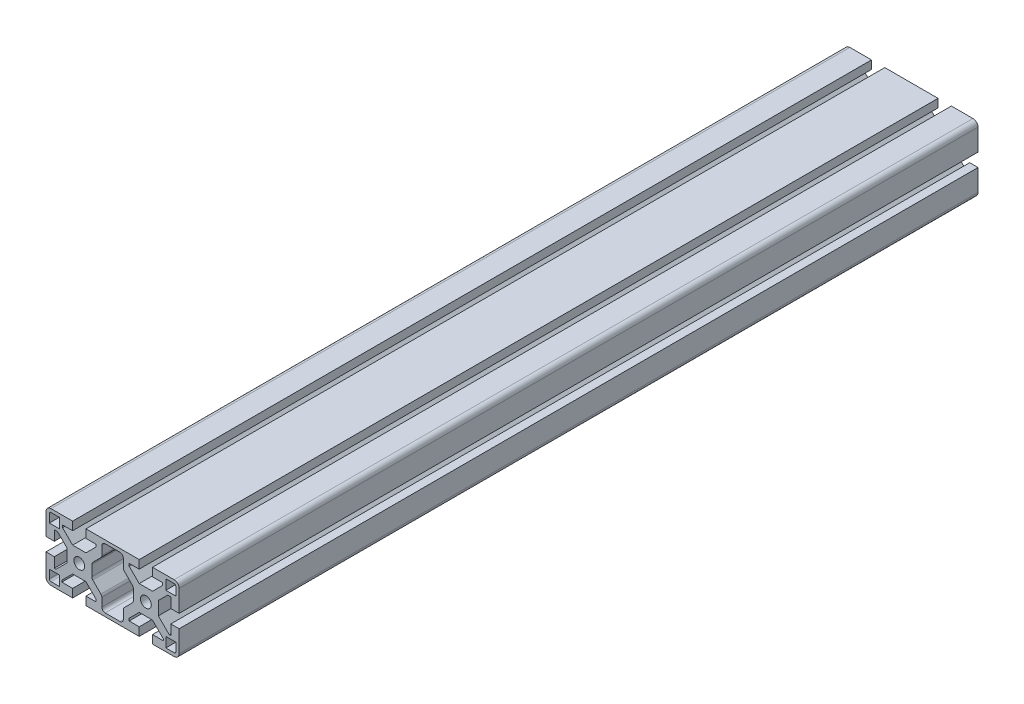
ISO-10303-21;
HEADER;
FILE_DESCRIPTION(('STEP AP214'),'2;1');
FILE_NAME('part.step','',(''),(''),'','','');
FILE_SCHEMA(('AUTOMOTIVE_DESIGN { 1 0 10303 214 1 1 1 1 }'));
ENDSEC;
DATA;
#1=APPLICATION_CONTEXT('core data for automotive mechanical design processes');
#2=APPLICATION_PROTOCOL_DEFINITION('international standard','automotive_design',2000,#1);
#3=PRODUCT_CONTEXT('',#1,'mechanical');
#4=PRODUCT('Part','Part','',(#3));
#5=PRODUCT_RELATED_PRODUCT_CATEGORY('part','',(#4));
#6=PRODUCT_DEFINITION_FORMATION('','',#4);
#7=PRODUCT_DEFINITION_CONTEXT('part definition',#1,'design');
#8=PRODUCT_DEFINITION('design','',#6,#7);
#9=PRODUCT_DEFINITION_SHAPE('','',#8);
#10=(LENGTH_UNIT() NAMED_UNIT(*) SI_UNIT(.MILLI.,.METRE.));
#11=(NAMED_UNIT(*) PLANE_ANGLE_UNIT() SI_UNIT($,.RADIAN.));
#12=(NAMED_UNIT(*) SI_UNIT($,.STERADIAN.) SOLID_ANGLE_UNIT());
#13=UNCERTAINTY_MEASURE_WITH_UNIT(LENGTH_MEASURE(1.E-05),#10,'distance_accuracy_value','');
#14=(GEOMETRIC_REPRESENTATION_CONTEXT(3) GLOBAL_UNCERTAINTY_ASSIGNED_CONTEXT((#13)) GLOBAL_UNIT_ASSIGNED_CONTEXT((#10,
#11,#12)) REPRESENTATION_CONTEXT('',''));
#15=CARTESIAN_POINT('',(0.,0.,0.));
#16=DIRECTION('',(0.,0.,1.));
#17=DIRECTION('',(1.,0.,0.));
#18=AXIS2_PLACEMENT_3D('',#15,#16,#17);
#19=CARTESIAN_POINT('',(57.,-17.,480.));
#20=DIRECTION('',(0.,0.,1.));
#21=DIRECTION('',(1.,0.,0.));
#22=AXIS2_PLACEMENT_3D('',#19,#20,#21);
#23=PLANE('',#22);
#24=DIRECTION('',(0.,-1.,0.));
#25=VECTOR('',#24,1.);
#26=CARTESIAN_POINT('',(13.5499999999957,10.8784271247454,480.));
#27=LINE('',#26,#25);
#28=CARTESIAN_POINT('',(13.5499999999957,16.,480.));
#29=VERTEX_POINT('',#28);
#30=CARTESIAN_POINT('',(13.5499999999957,10.8784271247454,480.));
#31=VERTEX_POINT('',#30);
#32=EDGE_CURVE('E727',#29,#31,#27,.T.);
#33=ORIENTED_EDGE('',*,*,#32,.F.);
#34=CARTESIAN_POINT('',(15.5499999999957,16.,480.));
#35=DIRECTION('',(0.,0.,1.));
#36=DIRECTION('',(-1.,0.,0.));
#37=AXIS2_PLACEMENT_3D('',#34,#35,#36);
#38=CIRCLE('',#37,2.);
#39=CARTESIAN_POINT('',(15.5499999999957,18.,480.));
#40=VERTEX_POINT('',#39);
#41=EDGE_CURVE('E719',#40,#29,#38,.T.);
#42=ORIENTED_EDGE('',*,*,#41,.F.);
#43=DIRECTION('',(-1.,0.,0.));
#44=VECTOR('',#43,1.);
#45=CARTESIAN_POINT('',(24.4500000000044,18.,480.));
#46=LINE('',#45,#44);
#47=CARTESIAN_POINT('',(24.4500000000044,18.,480.));
#48=VERTEX_POINT('',#47);
#49=EDGE_CURVE('E786',#48,#40,#46,.T.);
#50=ORIENTED_EDGE('',*,*,#49,.F.);
#51=CARTESIAN_POINT('',(24.4500000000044,16.,480.));
#52=DIRECTION('',(0.,0.,1.));
#53=DIRECTION('',(1.,0.,0.));
#54=AXIS2_PLACEMENT_3D('',#51,#52,#53);
#55=CIRCLE('',#54,2.);
#56=CARTESIAN_POINT('',(26.4500000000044,16.,480.));
#57=VERTEX_POINT('',#56);
#58=EDGE_CURVE('E784',#57,#48,#55,.T.);
#59=ORIENTED_EDGE('',*,*,#58,.F.);
#60=DIRECTION('',(0.,1.,0.));
#61=VECTOR('',#60,1.);
#62=CARTESIAN_POINT('',(26.4500000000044,10.8784271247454,480.));
#63=LINE('',#62,#61);
#64=CARTESIAN_POINT('',(26.4500000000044,10.8784271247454,480.));
#65=VERTEX_POINT('',#64);
#66=EDGE_CURVE('E782',#65,#57,#63,.T.);
#67=ORIENTED_EDGE('',*,*,#66,.F.);
#68=CARTESIAN_POINT('',(28.4500000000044,10.8784271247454,480.));
#69=DIRECTION('',(0.,0.,-1.));
#70=DIRECTION('',(1.,0.,0.));
#71=AXIS2_PLACEMENT_3D('',#68,#69,#70);
#72=CIRCLE('',#71,2.);
#73=CARTESIAN_POINT('',(27.0357864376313,9.46421356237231,480.));
#74=VERTEX_POINT('',#73);
#75=EDGE_CURVE('E780',#74,#65,#72,.T.);
#76=ORIENTED_EDGE('',*,*,#75,.F.);
#77=DIRECTION('',(-0.707106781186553,0.707106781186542,0.));
#78=VECTOR('',#77,1.);
#79=CARTESIAN_POINT('',(31.914213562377,4.58578643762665,480.));
#80=LINE('',#79,#78);
#81=CARTESIAN_POINT('',(31.914213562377,4.58578643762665,480.));
#82=VERTEX_POINT('',#81);
#83=EDGE_CURVE('E778',#82,#74,#80,.T.);
#84=ORIENTED_EDGE('',*,*,#83,.F.);
#85=CARTESIAN_POINT('',(30.500000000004,3.17157287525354,480.));
#86=DIRECTION('',(0.,0.,1.));
#87=DIRECTION('',(1.,0.,0.));
#88=AXIS2_PLACEMENT_3D('',#85,#86,#87);
#89=CIRCLE('',#88,2.);
#90=CARTESIAN_POINT('',(32.500000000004,3.17157287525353,480.));
#91=VERTEX_POINT('',#90);
#92=EDGE_CURVE('E776',#91,#82,#89,.T.);
#93=ORIENTED_EDGE('',*,*,#92,.F.);
#94=DIRECTION('',(0.,1.,0.));
#95=VECTOR('',#94,1.);
#96=CARTESIAN_POINT('',(32.500000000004,-3.17157287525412,480.));
#97=LINE('',#96,#95);
#98=CARTESIAN_POINT('',(32.500000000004,-3.17157287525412,480.));
#99=VERTEX_POINT('',#98);
#100=EDGE_CURVE('E774',#99,#91,#97,.T.);
#101=ORIENTED_EDGE('',*,*,#100,.F.);
#102=CARTESIAN_POINT('',(30.500000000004,-3.17157287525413,480.));
#103=DIRECTION('',(0.,0.,1.));
#104=DIRECTION('',(-1.,0.,0.));
#105=AXIS2_PLACEMENT_3D('',#102,#103,#104);
#106=CIRCLE('',#105,2.);
#107=CARTESIAN_POINT('',(31.9142135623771,-4.58578643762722,480.));
#108=VERTEX_POINT('',#107);
#109=EDGE_CURVE('E772',#108,#99,#106,.T.);
#110=ORIENTED_EDGE('',*,*,#109,.F.);
#111=DIRECTION('',(0.707106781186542,0.707106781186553,0.));
#112=VECTOR('',#111,1.);
#113=CARTESIAN_POINT('',(31.9142135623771,-4.58578643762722,480.));
#114=LINE('',#113,#112);
#115=CARTESIAN_POINT('',(27.0357864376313,-9.46421356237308,480.));
#116=VERTEX_POINT('',#115);
#117=EDGE_CURVE('E770',#116,#108,#114,.T.);
#118=ORIENTED_EDGE('',*,*,#117,.F.);
#119=CARTESIAN_POINT('',(28.4500000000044,-10.8784271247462,480.));
#120=DIRECTION('',(0.,0.,-1.));
#121=DIRECTION('',(-1.,0.,0.));
#122=AXIS2_PLACEMENT_3D('',#119,#120,#121);
#123=CIRCLE('',#122,2.);
#124=CARTESIAN_POINT('',(26.4500000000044,-10.8784271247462,480.));
#125=VERTEX_POINT('',#124);
#126=EDGE_CURVE('E768',#125,#116,#123,.T.);
#127=ORIENTED_EDGE('',*,*,#126,.F.);
#128=DIRECTION('',(0.,1.,0.));
#129=VECTOR('',#128,1.);
#130=CARTESIAN_POINT('',(26.4500000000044,-10.8784271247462,480.));
#131=LINE('',#130,#129);
#132=CARTESIAN_POINT('',(26.4500000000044,-16.,480.));
#133=VERTEX_POINT('',#132);
#134=EDGE_CURVE('E766',#133,#125,#131,.T.);
#135=ORIENTED_EDGE('',*,*,#134,.F.);
#136=CARTESIAN_POINT('',(24.4500000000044,-16.,480.));
#137=DIRECTION('',(0.,0.,1.));
#138=DIRECTION('',(-1.,0.,0.));
#139=AXIS2_PLACEMENT_3D('',#136,#137,#138);
#140=CIRCLE('',#139,2.);
#141=CARTESIAN_POINT('',(24.4500000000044,-18.,480.));
#142=VERTEX_POINT('',#141);
#143=EDGE_CURVE('E764',#142,#133,#140,.T.);
#144=ORIENTED_EDGE('',*,*,#143,.F.);
#145=DIRECTION('',(1.,0.,0.));
#146=VECTOR('',#145,1.);
#147=CARTESIAN_POINT('',(24.4500000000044,-18.,480.));
#148=LINE('',#147,#146);
#149=CARTESIAN_POINT('',(15.5499999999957,-18.,480.));
#150=VERTEX_POINT('',#149);
#151=EDGE_CURVE('E762',#150,#142,#148,.T.);
#152=ORIENTED_EDGE('',*,*,#151,.F.);
#153=CARTESIAN_POINT('',(15.5499999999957,-16.,480.));
#154=DIRECTION('',(0.,0.,1.));
#155=DIRECTION('',(-1.,0.,0.));
#156=AXIS2_PLACEMENT_3D('',#153,#154,#155);
#157=CIRCLE('',#156,2.);
#158=CARTESIAN_POINT('',(13.5499999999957,-16.,480.));
#159=VERTEX_POINT('',#158);
#160=EDGE_CURVE('E760',#159,#150,#157,.T.);
#161=ORIENTED_EDGE('',*,*,#160,.F.);
#162=DIRECTION('',(0.,-1.,0.));
#163=VECTOR('',#162,1.);
#164=CARTESIAN_POINT('',(13.5499999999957,-10.8784271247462,480.));
#165=LINE('',#164,#163);
#166=CARTESIAN_POINT('',(13.5499999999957,-10.8784271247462,480.));
#167=VERTEX_POINT('',#166);
#168=EDGE_CURVE('E758',#167,#159,#165,.T.);
#169=ORIENTED_EDGE('',*,*,#168,.F.);
#170=CARTESIAN_POINT('',(11.5499999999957,-10.8784271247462,480.));
#171=DIRECTION('',(0.,0.,-1.));
#172=DIRECTION('',(1.,0.,0.));
#173=AXIS2_PLACEMENT_3D('',#170,#171,#172);
#174=CIRCLE('',#173,2.);
#175=CARTESIAN_POINT('',(12.9642135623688,-9.4642135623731,480.));
#176=VERTEX_POINT('',#175);
#177=EDGE_CURVE('E756',#176,#167,#174,.T.);
#178=ORIENTED_EDGE('',*,*,#177,.F.);
#179=DIRECTION('',(0.707106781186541,-0.707106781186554,0.));
#180=VECTOR('',#179,1.);
#181=CARTESIAN_POINT('',(8.085786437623,-4.58578643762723,480.));
#182=LINE('',#181,#180);
#183=CARTESIAN_POINT('',(8.085786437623,-4.58578643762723,480.));
#184=VERTEX_POINT('',#183);
#185=EDGE_CURVE('E754',#184,#176,#182,.T.);
#186=ORIENTED_EDGE('',*,*,#185,.F.);
#187=CARTESIAN_POINT('',(9.4999999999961,-3.17157287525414,480.));
#188=DIRECTION('',(0.,0.,1.));
#189=DIRECTION('',(-1.,0.,0.));
#190=AXIS2_PLACEMENT_3D('',#187,#188,#189);
#191=CIRCLE('',#190,2.);
#192=CARTESIAN_POINT('',(7.49999999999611,-3.17157287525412,480.));
#193=VERTEX_POINT('',#192);
#194=EDGE_CURVE('E752',#193,#184,#191,.T.);
#195=ORIENTED_EDGE('',*,*,#194,.F.);
#196=DIRECTION('',(0.,-1.,0.));
#197=VECTOR('',#196,1.);
#198=CARTESIAN_POINT('',(7.49999999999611,-3.17157287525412,480.));
#199=LINE('',#198,#197);
#200=CARTESIAN_POINT('',(7.49999999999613,3.17157287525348,480.));
#201=VERTEX_POINT('',#200);
#202=EDGE_CURVE('E750',#201,#193,#199,.T.);
#203=ORIENTED_EDGE('',*,*,#202,.F.);
#204=CARTESIAN_POINT('',(9.4999999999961,3.17157287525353,480.));
#205=DIRECTION('',(0.,0.,1.));
#206=DIRECTION('',(-1.,0.,0.));
#207=AXIS2_PLACEMENT_3D('',#204,#205,#206);
#208=CIRCLE('',#207,1.99999999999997);
#209=CARTESIAN_POINT('',(8.08578643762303,4.58578643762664,480.));
#210=VERTEX_POINT('',#209);
#211=EDGE_CURVE('E748',#210,#201,#208,.T.);
#212=ORIENTED_EDGE('',*,*,#211,.F.);
#213=DIRECTION('',(-0.707106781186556,-0.707106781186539,0.));
#214=VECTOR('',#213,1.);
#215=CARTESIAN_POINT('',(8.08578643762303,4.58578643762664,480.));
#216=LINE('',#215,#214);
#217=CARTESIAN_POINT('',(12.9642135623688,9.46421356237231,480.));
#218=VERTEX_POINT('',#217);
#219=EDGE_CURVE('E743',#218,#210,#216,.T.);
#220=ORIENTED_EDGE('',*,*,#219,.F.);
#221=CARTESIAN_POINT('',(11.5499999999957,10.8784271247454,480.));
#222=DIRECTION('',(0.,0.,-1.));
#223=DIRECTION('',(1.,0.,0.));
#224=AXIS2_PLACEMENT_3D('',#221,#222,#223);
#225=CIRCLE('',#224,2.00000000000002);
#226=EDGE_CURVE('E741',#31,#218,#225,.T.);
#227=ORIENTED_EDGE('',*,*,#226,.F.);
#228=EDGE_LOOP('',(#33,#42,#50,#59,#67,#76,#84,#93,#101,#110,#118,#127,#135,#144,#152,#161,#169,
#178,#186,#195,#203,#212,#220,#227));
#229=FACE_BOUND('',#228,.T.);
#230=DIRECTION('',(0.,1.,0.));
#231=VECTOR('',#230,1.);
#232=CARTESIAN_POINT('',(58.,-17.,480.));
#233=LINE('',#232,#231);
#234=CARTESIAN_POINT('',(58.,-17.,480.));
#235=VERTEX_POINT('',#234);
#236=CARTESIAN_POINT('',(58.,-12.,480.));
#237=VERTEX_POINT('',#236);
#238=EDGE_CURVE('E939',#235,#237,#233,.T.);
#239=ORIENTED_EDGE('',*,*,#238,.F.);
#240=CARTESIAN_POINT('',(57.,-17.,480.));
#241=DIRECTION('',(0.,0.,1.));
#242=DIRECTION('',(-1.,0.,0.));
#243=AXIS2_PLACEMENT_3D('',#240,#241,#242);
#244=CIRCLE('',#243,0.999999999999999);
#245=CARTESIAN_POINT('',(57.,-18.,480.));
#246=VERTEX_POINT('',#245);
#247=EDGE_CURVE('E937',#246,#235,#244,.T.);
#248=ORIENTED_EDGE('',*,*,#247,.F.);
#249=DIRECTION('',(1.,0.,0.));
#250=VECTOR('',#249,1.);
#251=CARTESIAN_POINT('',(57.,-18.,480.));
#252=LINE('',#251,#250);
#253=CARTESIAN_POINT('',(52.0000000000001,-18.,480.));
#254=VERTEX_POINT('',#253);
#255=EDGE_CURVE('E947',#254,#246,#252,.T.);
#256=ORIENTED_EDGE('',*,*,#255,.F.);
#257=DIRECTION('',(0.,-1.,0.));
#258=VECTOR('',#257,1.);
#259=CARTESIAN_POINT('',(52.0000000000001,-18.,480.));
#260=LINE('',#259,#258);
#261=CARTESIAN_POINT('',(52.0000000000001,-12.,480.));
#262=VERTEX_POINT('',#261);
#263=EDGE_CURVE('E944',#262,#254,#260,.T.);
#264=ORIENTED_EDGE('',*,*,#263,.F.);
#265=DIRECTION('',(-1.,0.,0.));
#266=VECTOR('',#265,1.);
#267=CARTESIAN_POINT('',(58.,-12.,480.));
#268=LINE('',#267,#266);
#269=EDGE_CURVE('E942',#237,#262,#268,.T.);
#270=ORIENTED_EDGE('',*,*,#269,.F.);
#271=EDGE_LOOP('',(#239,#248,#256,#264,#270));
#272=FACE_BOUND('',#271,.T.);
#273=DIRECTION('',(-1.,0.,0.));
#274=VECTOR('',#273,1.);
#275=CARTESIAN_POINT('',(-18.,-12.,480.));
#276=LINE('',#275,#274);
#277=CARTESIAN_POINT('',(-12.,-12.,480.));
#278=VERTEX_POINT('',#277);
#279=CARTESIAN_POINT('',(-18.,-12.,480.));
#280=VERTEX_POINT('',#279);
#281=EDGE_CURVE('E983',#278,#280,#276,.T.);
#282=ORIENTED_EDGE('',*,*,#281,.F.);
#283=DIRECTION('',(0.,1.,0.));
#284=VECTOR('',#283,1.);
#285=CARTESIAN_POINT('',(-12.,-18.,480.));
#286=LINE('',#285,#284);
#287=CARTESIAN_POINT('',(-12.,-18.,480.));
#288=VERTEX_POINT('',#287);
#289=EDGE_CURVE('E981',#288,#278,#286,.T.);
#290=ORIENTED_EDGE('',*,*,#289,.F.);
#291=DIRECTION('',(1.,0.,0.));
#292=VECTOR('',#291,1.);
#293=CARTESIAN_POINT('',(-17.,-18.,480.));
#294=LINE('',#293,#292);
#295=CARTESIAN_POINT('',(-17.,-18.,480.));
#296=VERTEX_POINT('',#295);
#297=EDGE_CURVE('E991',#296,#288,#294,.T.);
#298=ORIENTED_EDGE('',*,*,#297,.F.);
#299=CARTESIAN_POINT('',(-17.,-17.,480.));
#300=DIRECTION('',(0.,0.,1.));
#301=DIRECTION('',(1.,0.,0.));
#302=AXIS2_PLACEMENT_3D('',#299,#300,#301);
#303=CIRCLE('',#302,1.);
#304=CARTESIAN_POINT('',(-18.,-17.,480.));
#305=VERTEX_POINT('',#304);
#306=EDGE_CURVE('E988',#305,#296,#303,.T.);
#307=ORIENTED_EDGE('',*,*,#306,.F.);
#308=DIRECTION('',(0.,-1.,0.));
#309=VECTOR('',#308,1.);
#310=CARTESIAN_POINT('',(-18.,-17.,480.));
#311=LINE('',#310,#309);
#312=EDGE_CURVE('E986',#280,#305,#311,.T.);
#313=ORIENTED_EDGE('',*,*,#312,.F.);
#314=EDGE_LOOP('',(#282,#290,#298,#307,#313));
#315=FACE_BOUND('',#314,.T.);
#316=CARTESIAN_POINT('',(57.,-17.,480.));
#317=DIRECTION('',(0.,0.,1.));
#318=DIRECTION('',(1.,0.,0.));
#319=AXIS2_PLACEMENT_3D('',#316,#317,#318);
#320=CIRCLE('',#319,3.);
#321=CARTESIAN_POINT('',(57.,-20.,480.));
#322=VERTEX_POINT('',#321);
#323=CARTESIAN_POINT('',(60.0000000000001,-17.,480.));
#324=VERTEX_POINT('',#323);
#325=EDGE_CURVE('E1057',#322,#324,#320,.T.);
#326=ORIENTED_EDGE('',*,*,#325,.T.);
#327=DIRECTION('',(0.,1.,0.));
#328=VECTOR('',#327,1.);
#329=CARTESIAN_POINT('',(60.0000000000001,-17.,480.));
#330=LINE('',#329,#328);
#331=CARTESIAN_POINT('',(60.0000000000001,-4.00000000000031,480.));
#332=VERTEX_POINT('',#331);
#333=EDGE_CURVE('E1060',#324,#332,#330,.T.);
#334=ORIENTED_EDGE('',*,*,#333,.T.);
#335=DIRECTION('',(-1.,0.,0.));
#336=VECTOR('',#335,1.);
#337=CARTESIAN_POINT('',(60.0000000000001,-4.00000000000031,480.));
#338=LINE('',#337,#336);
#339=CARTESIAN_POINT('',(55.0000000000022,-4.00000000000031,480.));
#340=VERTEX_POINT('',#339);
#341=EDGE_CURVE('E1063',#332,#340,#338,.T.);
#342=ORIENTED_EDGE('',*,*,#341,.T.);
#343=DIRECTION('',(0.,-1.,0.));
#344=VECTOR('',#343,1.);
#345=CARTESIAN_POINT('',(55.0000000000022,-10.05,480.));
#346=LINE('',#345,#344);
#347=CARTESIAN_POINT('',(55.0000000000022,-10.05,480.));
#348=VERTEX_POINT('',#347);
#349=EDGE_CURVE('E1065',#340,#348,#346,.T.);
#350=ORIENTED_EDGE('',*,*,#349,.T.);
#351=DIRECTION('',(-1.,0.,0.));
#352=VECTOR('',#351,1.);
#353=CARTESIAN_POINT('',(55.0000000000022,-10.05,480.));
#354=LINE('',#353,#352);
#355=CARTESIAN_POINT('',(53.9999999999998,-10.05,480.));
#356=VERTEX_POINT('',#355);
#357=EDGE_CURVE('E1067',#348,#356,#354,.T.);
#358=ORIENTED_EDGE('',*,*,#357,.T.);
#359=DIRECTION('',(-0.70710678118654,0.707106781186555,0.));
#360=VECTOR('',#359,1.);
#361=CARTESIAN_POINT('',(47.5,-3.55000000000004,480.));
#362=LINE('',#361,#360);
#363=CARTESIAN_POINT('',(47.5,-3.55000000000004,480.));
#364=VERTEX_POINT('',#363);
#365=EDGE_CURVE('E1069',#356,#364,#362,.T.);
#366=ORIENTED_EDGE('',*,*,#365,.T.);
#367=DIRECTION('',(0.,1.,0.));
#368=VECTOR('',#367,1.);
#369=CARTESIAN_POINT('',(47.5,-3.55000000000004,480.));
#370=LINE('',#369,#368);
#371=CARTESIAN_POINT('',(47.5,4.44999999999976,480.));
#372=VERTEX_POINT('',#371);
#373=EDGE_CURVE('E1071',#364,#372,#370,.T.);
#374=ORIENTED_EDGE('',*,*,#373,.T.);
#375=DIRECTION('',(0.707106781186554,0.707106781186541,0.));
#376=VECTOR('',#375,1.);
#377=CARTESIAN_POINT('',(47.5,4.44999999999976,480.));
#378=LINE('',#377,#376);
#379=CARTESIAN_POINT('',(53.0999999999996,10.0499999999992,480.));
#380=VERTEX_POINT('',#379);
#381=EDGE_CURVE('E1073',#372,#380,#378,.T.);
#382=ORIENTED_EDGE('',*,*,#381,.T.);
#383=DIRECTION('',(1.,0.,0.));
#384=VECTOR('',#383,1.);
#385=CARTESIAN_POINT('',(55.0000000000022,10.0499999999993,480.));
#386=LINE('',#385,#384);
#387=CARTESIAN_POINT('',(55.0000000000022,10.0499999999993,480.));
#388=VERTEX_POINT('',#387);
#389=EDGE_CURVE('E1075',#380,#388,#386,.T.);
#390=ORIENTED_EDGE('',*,*,#389,.T.);
#391=DIRECTION('',(0.,-1.,0.));
#392=VECTOR('',#391,1.);
#393=CARTESIAN_POINT('',(55.0000000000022,3.99999999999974,480.));
#394=LINE('',#393,#392);
#395=CARTESIAN_POINT('',(55.0000000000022,3.99999999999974,480.));
#396=VERTEX_POINT('',#395);
#397=EDGE_CURVE('E1077',#388,#396,#394,.T.);
#398=ORIENTED_EDGE('',*,*,#397,.T.);
#399=DIRECTION('',(1.,0.,0.));
#400=VECTOR('',#399,1.);
#401=CARTESIAN_POINT('',(60.0000000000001,3.99999999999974,480.));
#402=LINE('',#401,#400);
#403=CARTESIAN_POINT('',(60.0000000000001,3.99999999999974,480.));
#404=VERTEX_POINT('',#403);
#405=EDGE_CURVE('E1079',#396,#404,#402,.T.);
#406=ORIENTED_EDGE('',*,*,#405,.T.);
#407=DIRECTION('',(0.,1.,0.));
#408=VECTOR('',#407,1.);
#409=CARTESIAN_POINT('',(60.0000000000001,3.99999999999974,480.));
#410=LINE('',#409,#408);
#411=CARTESIAN_POINT('',(60.0000000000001,17.,480.));
#412=VERTEX_POINT('',#411);
#413=EDGE_CURVE('E1081',#404,#412,#410,.T.);
#414=ORIENTED_EDGE('',*,*,#413,.T.);
#415=CARTESIAN_POINT('',(57.,17.,480.));
#416=DIRECTION('',(0.,0.,1.));
#417=DIRECTION('',(1.,0.,0.));
#418=AXIS2_PLACEMENT_3D('',#415,#416,#417);
#419=CIRCLE('',#418,3.);
#420=CARTESIAN_POINT('',(57.,20.,480.));
#421=VERTEX_POINT('',#420);
#422=EDGE_CURVE('E1083',#412,#421,#419,.T.);
#423=ORIENTED_EDGE('',*,*,#422,.T.);
#424=DIRECTION('',(-1.,0.,0.));
#425=VECTOR('',#424,1.);
#426=CARTESIAN_POINT('',(57.,20.,480.));
#427=LINE('',#426,#425);
#428=CARTESIAN_POINT('',(44.,20.,480.));
#429=VERTEX_POINT('',#428);
#430=EDGE_CURVE('E1085',#421,#429,#427,.T.);
#431=ORIENTED_EDGE('',*,*,#430,.T.);
#432=DIRECTION('',(0.,-1.,0.));
#433=VECTOR('',#432,1.);
#434=CARTESIAN_POINT('',(44.,20.,480.));
#435=LINE('',#434,#433);
#436=CARTESIAN_POINT('',(44.,15.,480.));
#437=VERTEX_POINT('',#436);
#438=EDGE_CURVE('E1087',#429,#437,#435,.T.);
#439=ORIENTED_EDGE('',*,*,#438,.T.);
#440=DIRECTION('',(1.,0.,0.));
#441=VECTOR('',#440,1.);
#442=CARTESIAN_POINT('',(50.0628752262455,15.,480.));
#443=LINE('',#442,#441);
#444=CARTESIAN_POINT('',(50.0628752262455,15.,480.));
#445=VERTEX_POINT('',#444);
#446=EDGE_CURVE('E1089',#437,#445,#443,.T.);
#447=ORIENTED_EDGE('',*,*,#446,.T.);
#448=DIRECTION('',(0.,-1.,0.));
#449=VECTOR('',#448,1.);
#450=CARTESIAN_POINT('',(50.0628752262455,13.5499999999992,480.));
#451=LINE('',#450,#449);
#452=CARTESIAN_POINT('',(50.0628752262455,13.5499999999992,480.));
#453=VERTEX_POINT('',#452);
#454=EDGE_CURVE('E1091',#445,#453,#451,.T.);
#455=ORIENTED_EDGE('',*,*,#454,.T.);
#456=DIRECTION('',(-0.707857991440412,-0.706354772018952,0.));
#457=VECTOR('',#456,1.);
#458=CARTESIAN_POINT('',(50.0628752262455,13.5499999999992,480.));
#459=LINE('',#458,#457);
#460=CARTESIAN_POINT('',(44.,7.50000000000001,480.));
#461=VERTEX_POINT('',#460);
#462=EDGE_CURVE('E1093',#453,#461,#459,.T.);
#463=ORIENTED_EDGE('',*,*,#462,.T.);
#464=DIRECTION('',(-1.,0.,0.));
#465=VECTOR('',#464,1.);
#466=CARTESIAN_POINT('',(44.,7.50000000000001,480.));
#467=LINE('',#466,#465);
#468=CARTESIAN_POINT('',(36.,7.50000000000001,480.));
#469=VERTEX_POINT('',#468);
#470=EDGE_CURVE('E1095',#461,#469,#467,.T.);
#471=ORIENTED_EDGE('',*,*,#470,.T.);
#472=DIRECTION('',(-0.707106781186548,0.707106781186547,0.));
#473=VECTOR('',#472,1.);
#474=CARTESIAN_POINT('',(36.,7.50000000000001,480.));
#475=LINE('',#474,#473);
#476=CARTESIAN_POINT('',(29.9500000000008,13.5499999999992,480.));
#477=VERTEX_POINT('',#476);
#478=EDGE_CURVE('E1097',#469,#477,#475,.T.);
#479=ORIENTED_EDGE('',*,*,#478,.T.);
#480=DIRECTION('',(0.,1.,0.));
#481=VECTOR('',#480,1.);
#482=CARTESIAN_POINT('',(29.9500000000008,13.5499999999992,480.));
#483=LINE('',#482,#481);
#484=CARTESIAN_POINT('',(29.9500000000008,15.,480.));
#485=VERTEX_POINT('',#484);
#486=EDGE_CURVE('E1099',#477,#485,#483,.T.);
#487=ORIENTED_EDGE('',*,*,#486,.T.);
#488=DIRECTION('',(1.,0.,0.));
#489=VECTOR('',#488,1.);
#490=CARTESIAN_POINT('',(36.,15.,480.));
#491=LINE('',#490,#489);
#492=CARTESIAN_POINT('',(36.,15.,480.));
#493=VERTEX_POINT('',#492);
#494=EDGE_CURVE('E1101',#485,#493,#491,.T.);
#495=ORIENTED_EDGE('',*,*,#494,.T.);
#496=DIRECTION('',(0.,1.,0.));
#497=VECTOR('',#496,1.);
#498=CARTESIAN_POINT('',(36.,20.,480.));
#499=LINE('',#498,#497);
#500=CARTESIAN_POINT('',(36.,20.,480.));
#501=VERTEX_POINT('',#500);
#502=EDGE_CURVE('E1103',#493,#501,#499,.T.);
#503=ORIENTED_EDGE('',*,*,#502,.T.);
#504=DIRECTION('',(-1.,0.,0.));
#505=VECTOR('',#504,1.);
#506=CARTESIAN_POINT('',(4.00000000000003,20.,480.));
#507=LINE('',#506,#505);
#508=CARTESIAN_POINT('',(4.00000000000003,20.,480.));
#509=VERTEX_POINT('',#508);
#510=EDGE_CURVE('E1105',#501,#509,#507,.T.);
#511=ORIENTED_EDGE('',*,*,#510,.T.);
#512=DIRECTION('',(0.,-1.,0.));
#513=VECTOR('',#512,1.);
#514=CARTESIAN_POINT('',(4.00000000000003,20.,480.));
#515=LINE('',#514,#513);
#516=CARTESIAN_POINT('',(4.00000000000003,15.,480.));
#517=VERTEX_POINT('',#516);
#518=EDGE_CURVE('E1107',#509,#517,#515,.T.);
#519=ORIENTED_EDGE('',*,*,#518,.T.);
#520=DIRECTION('',(1.,0.,0.));
#521=VECTOR('',#520,1.);
#522=CARTESIAN_POINT('',(4.00000000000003,15.,480.));
#523=LINE('',#522,#521);
#524=CARTESIAN_POINT('',(10.0499999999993,15.,480.));
#525=VERTEX_POINT('',#524);
#526=EDGE_CURVE('E1109',#517,#525,#523,.T.);
#527=ORIENTED_EDGE('',*,*,#526,.T.);
#528=DIRECTION('',(0.,-1.,0.));
#529=VECTOR('',#528,1.);
#530=CARTESIAN_POINT('',(10.0499999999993,13.5499999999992,480.));
#531=LINE('',#530,#529);
#532=CARTESIAN_POINT('',(10.0499999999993,13.5499999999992,480.));
#533=VERTEX_POINT('',#532);
#534=EDGE_CURVE('E1111',#525,#533,#531,.T.);
#535=ORIENTED_EDGE('',*,*,#534,.T.);
#536=DIRECTION('',(-0.707106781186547,-0.707106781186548,0.));
#537=VECTOR('',#536,1.);
#538=CARTESIAN_POINT('',(4.00000000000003,7.5,480.));
#539=LINE('',#538,#537);
#540=CARTESIAN_POINT('',(4.00000000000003,7.5,480.));
#541=VERTEX_POINT('',#540);
#542=EDGE_CURVE('E1113',#533,#541,#539,.T.);
#543=ORIENTED_EDGE('',*,*,#542,.T.);
#544=DIRECTION('',(-1.,0.,0.));
#545=VECTOR('',#544,1.);
#546=CARTESIAN_POINT('',(-3.99999999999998,7.5,480.));
#547=LINE('',#546,#545);
#548=CARTESIAN_POINT('',(-3.99999999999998,7.5,480.));
#549=VERTEX_POINT('',#548);
#550=EDGE_CURVE('E1115',#541,#549,#547,.T.);
#551=ORIENTED_EDGE('',*,*,#550,.T.);
#552=DIRECTION('',(-0.707857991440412,0.706354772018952,0.));
#553=VECTOR('',#552,1.);
#554=CARTESIAN_POINT('',(-10.0628752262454,13.5499999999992,480.));
#555=LINE('',#554,#553);
#556=CARTESIAN_POINT('',(-10.0628752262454,13.5499999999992,480.));
#557=VERTEX_POINT('',#556);
#558=EDGE_CURVE('E1117',#549,#557,#555,.T.);
#559=ORIENTED_EDGE('',*,*,#558,.T.);
#560=DIRECTION('',(0.,1.,0.));
#561=VECTOR('',#560,1.);
#562=CARTESIAN_POINT('',(-10.0628752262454,13.5499999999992,480.));
#563=LINE('',#562,#561);
#564=CARTESIAN_POINT('',(-10.0628752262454,15.,480.));
#565=VERTEX_POINT('',#564);
#566=EDGE_CURVE('E1119',#557,#565,#563,.T.);
#567=ORIENTED_EDGE('',*,*,#566,.T.);
#568=DIRECTION('',(1.,0.,0.));
#569=VECTOR('',#568,1.);
#570=CARTESIAN_POINT('',(-10.0628752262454,15.,480.));
#571=LINE('',#570,#569);
#572=CARTESIAN_POINT('',(-3.99999999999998,15.,480.));
#573=VERTEX_POINT('',#572);
#574=EDGE_CURVE('E1121',#565,#573,#571,.T.);
#575=ORIENTED_EDGE('',*,*,#574,.T.);
#576=DIRECTION('',(0.,1.,0.));
#577=VECTOR('',#576,1.);
#578=CARTESIAN_POINT('',(-3.99999999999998,20.,480.));
#579=LINE('',#578,#577);
#580=CARTESIAN_POINT('',(-3.99999999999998,20.,480.));
#581=VERTEX_POINT('',#580);
#582=EDGE_CURVE('E1123',#573,#581,#579,.T.);
#583=ORIENTED_EDGE('',*,*,#582,.T.);
#584=DIRECTION('',(-1.,0.,0.));
#585=VECTOR('',#584,1.);
#586=CARTESIAN_POINT('',(-17.,20.,480.));
#587=LINE('',#586,#585);
#588=CARTESIAN_POINT('',(-17.,20.,480.));
#589=VERTEX_POINT('',#588);
#590=EDGE_CURVE('E1125',#581,#589,#587,.T.);
#591=ORIENTED_EDGE('',*,*,#590,.T.);
#592=CARTESIAN_POINT('',(-17.,17.,480.));
#593=DIRECTION('',(0.,0.,1.));
#594=DIRECTION('',(-1.,0.,0.));
#595=AXIS2_PLACEMENT_3D('',#592,#593,#594);
#596=CIRCLE('',#595,3.);
#597=CARTESIAN_POINT('',(-20.,17.,480.));
#598=VERTEX_POINT('',#597);
#599=EDGE_CURVE('E1127',#589,#598,#596,.T.);
#600=ORIENTED_EDGE('',*,*,#599,.T.);
#601=DIRECTION('',(0.,-1.,0.));
#602=VECTOR('',#601,1.);
#603=CARTESIAN_POINT('',(-20.,3.99999999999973,480.));
#604=LINE('',#603,#602);
#605=CARTESIAN_POINT('',(-20.,3.99999999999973,480.));
#606=VERTEX_POINT('',#605);
#607=EDGE_CURVE('E1129',#598,#606,#604,.T.);
#608=ORIENTED_EDGE('',*,*,#607,.T.);
#609=DIRECTION('',(1.,0.,0.));
#610=VECTOR('',#609,1.);
#611=CARTESIAN_POINT('',(-20.,3.99999999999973,480.));
#612=LINE('',#611,#610);
#613=CARTESIAN_POINT('',(-15.0000000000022,3.99999999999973,480.));
#614=VERTEX_POINT('',#613);
#615=EDGE_CURVE('E1131',#606,#614,#612,.T.);
#616=ORIENTED_EDGE('',*,*,#615,.T.);
#617=DIRECTION('',(0.,1.,0.));
#618=VECTOR('',#617,1.);
#619=CARTESIAN_POINT('',(-15.0000000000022,3.99999999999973,480.));
#620=LINE('',#619,#618);
#621=CARTESIAN_POINT('',(-15.0000000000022,10.0499999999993,480.));
#622=VERTEX_POINT('',#621);
#623=EDGE_CURVE('E1133',#614,#622,#620,.T.);
#624=ORIENTED_EDGE('',*,*,#623,.T.);
#625=DIRECTION('',(1.,0.,0.));
#626=VECTOR('',#625,1.);
#627=CARTESIAN_POINT('',(-15.0000000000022,10.0499999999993,480.));
#628=LINE('',#627,#626);
#629=CARTESIAN_POINT('',(-13.0999999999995,10.0499999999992,480.));
#630=VERTEX_POINT('',#629);
#631=EDGE_CURVE('E1135',#622,#630,#628,.T.);
#632=ORIENTED_EDGE('',*,*,#631,.T.);
#633=DIRECTION('',(0.707106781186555,-0.70710678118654,0.));
#634=VECTOR('',#633,1.);
#635=CARTESIAN_POINT('',(-7.49999999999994,4.44999999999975,480.));
#636=LINE('',#635,#634);
#637=CARTESIAN_POINT('',(-7.49999999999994,4.44999999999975,480.));
#638=VERTEX_POINT('',#637);
#639=EDGE_CURVE('E1137',#630,#638,#636,.T.);
#640=ORIENTED_EDGE('',*,*,#639,.T.);
#641=DIRECTION('',(0.,-1.,0.));
#642=VECTOR('',#641,1.);
#643=CARTESIAN_POINT('',(-7.49999999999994,-3.55000000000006,480.));
#644=LINE('',#643,#642);
#645=CARTESIAN_POINT('',(-7.49999999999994,-3.55000000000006,480.));
#646=VERTEX_POINT('',#645);
#647=EDGE_CURVE('E1139',#638,#646,#644,.T.);
#648=ORIENTED_EDGE('',*,*,#647,.T.);
#649=DIRECTION('',(-0.70710678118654,-0.707106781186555,0.));
#650=VECTOR('',#649,1.);
#651=CARTESIAN_POINT('',(-7.49999999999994,-3.55000000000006,480.));
#652=LINE('',#651,#650);
#653=CARTESIAN_POINT('',(-13.9999999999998,-10.05,480.));
#654=VERTEX_POINT('',#653);
#655=EDGE_CURVE('E1141',#646,#654,#652,.T.);
#656=ORIENTED_EDGE('',*,*,#655,.T.);
#657=DIRECTION('',(-1.,0.,0.));
#658=VECTOR('',#657,1.);
#659=CARTESIAN_POINT('',(-15.0000000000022,-10.05,480.));
#660=LINE('',#659,#658);
#661=CARTESIAN_POINT('',(-15.0000000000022,-10.05,480.));
#662=VERTEX_POINT('',#661);
#663=EDGE_CURVE('E1143',#654,#662,#660,.T.);
#664=ORIENTED_EDGE('',*,*,#663,.T.);
#665=DIRECTION('',(0.,1.,0.));
#666=VECTOR('',#665,1.);
#667=CARTESIAN_POINT('',(-15.0000000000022,-10.05,480.));
#668=LINE('',#667,#666);
#669=CARTESIAN_POINT('',(-15.0000000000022,-4.00000000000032,480.));
#670=VERTEX_POINT('',#669);
#671=EDGE_CURVE('E1145',#662,#670,#668,.T.);
#672=ORIENTED_EDGE('',*,*,#671,.T.);
#673=DIRECTION('',(-1.,0.,0.));
#674=VECTOR('',#673,1.);
#675=CARTESIAN_POINT('',(-20.,-4.00000000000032,480.));
#676=LINE('',#675,#674);
#677=CARTESIAN_POINT('',(-20.,-4.00000000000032,480.));
#678=VERTEX_POINT('',#677);
#679=EDGE_CURVE('E1147',#670,#678,#676,.T.);
#680=ORIENTED_EDGE('',*,*,#679,.T.);
#681=DIRECTION('',(0.,-1.,0.));
#682=VECTOR('',#681,1.);
#683=CARTESIAN_POINT('',(-20.,-17.,480.));
#684=LINE('',#683,#682);
#685=CARTESIAN_POINT('',(-20.,-17.,480.));
#686=VERTEX_POINT('',#685);
#687=EDGE_CURVE('E1149',#678,#686,#684,.T.);
#688=ORIENTED_EDGE('',*,*,#687,.T.);
#689=CARTESIAN_POINT('',(-17.,-17.,480.));
#690=DIRECTION('',(0.,0.,1.));
#691=DIRECTION('',(-1.,0.,0.));
#692=AXIS2_PLACEMENT_3D('',#689,#690,#691);
#693=CIRCLE('',#692,3.);
#694=CARTESIAN_POINT('',(-17.,-20.,480.));
#695=VERTEX_POINT('',#694);
#696=EDGE_CURVE('E1151',#686,#695,#693,.T.);
#697=ORIENTED_EDGE('',*,*,#696,.T.);
#698=DIRECTION('',(1.,0.,0.));
#699=VECTOR('',#698,1.);
#700=CARTESIAN_POINT('',(-17.,-20.,480.));
#701=LINE('',#700,#699);
#702=CARTESIAN_POINT('',(-4.,-20.,480.));
#703=VERTEX_POINT('',#702);
#704=EDGE_CURVE('E1153',#695,#703,#701,.T.);
#705=ORIENTED_EDGE('',*,*,#704,.T.);
#706=DIRECTION('',(0.,1.,0.));
#707=VECTOR('',#706,1.);
#708=CARTESIAN_POINT('',(-4.,-20.,480.));
#709=LINE('',#708,#707);
#710=CARTESIAN_POINT('',(-3.99999999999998,-14.9999999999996,480.));
#711=VERTEX_POINT('',#710);
#712=EDGE_CURVE('E1155',#703,#711,#709,.T.);
#713=ORIENTED_EDGE('',*,*,#712,.T.);
#714=DIRECTION('',(-1.,0.,0.));
#715=VECTOR('',#714,1.);
#716=CARTESIAN_POINT('',(-10.4999999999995,-14.9999999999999,480.));
#717=LINE('',#716,#715);
#718=CARTESIAN_POINT('',(-10.4999999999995,-14.9999999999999,480.));
#719=VERTEX_POINT('',#718);
#720=EDGE_CURVE('E1157',#711,#719,#717,.T.);
#721=ORIENTED_EDGE('',*,*,#720,.T.);
#722=DIRECTION('',(0.,1.,0.));
#723=VECTOR('',#722,1.);
#724=CARTESIAN_POINT('',(-10.4999999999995,-13.9999999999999,480.));
#725=LINE('',#724,#723);
#726=CARTESIAN_POINT('',(-10.4999999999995,-13.9999999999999,480.));
#727=VERTEX_POINT('',#726);
#728=EDGE_CURVE('E1159',#719,#727,#725,.T.);
#729=ORIENTED_EDGE('',*,*,#728,.T.);
#730=DIRECTION('',(0.707106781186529,0.707106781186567,0.));
#731=VECTOR('',#730,1.);
#732=CARTESIAN_POINT('',(-10.4999999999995,-13.9999999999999,480.));
#733=LINE('',#732,#731);
#734=CARTESIAN_POINT('',(-4.,-7.5,480.));
#735=VERTEX_POINT('',#734);
#736=EDGE_CURVE('E1161',#727,#735,#733,.T.);
#737=ORIENTED_EDGE('',*,*,#736,.T.);
#738=DIRECTION('',(1.,0.,0.));
#739=VECTOR('',#738,1.);
#740=CARTESIAN_POINT('',(-4.,-7.5,480.));
#741=LINE('',#740,#739);
#742=CARTESIAN_POINT('',(4.,-7.5,480.));
#743=VERTEX_POINT('',#742);
#744=EDGE_CURVE('E1163',#735,#743,#741,.T.);
#745=ORIENTED_EDGE('',*,*,#744,.T.);
#746=DIRECTION('',(0.70710678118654,-0.707106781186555,0.));
#747=VECTOR('',#746,1.);
#748=CARTESIAN_POINT('',(4.,-7.5,480.));
#749=LINE('',#748,#747);
#750=CARTESIAN_POINT('',(10.0499999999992,-13.5499999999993,480.));
#751=VERTEX_POINT('',#750);
#752=EDGE_CURVE('E1165',#743,#751,#749,.T.);
#753=ORIENTED_EDGE('',*,*,#752,.T.);
#754=DIRECTION('',(0.,-1.,0.));
#755=VECTOR('',#754,1.);
#756=CARTESIAN_POINT('',(10.0499999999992,-14.9999999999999,480.));
#757=LINE('',#756,#755);
#758=CARTESIAN_POINT('',(10.0499999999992,-14.9999999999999,480.));
#759=VERTEX_POINT('',#758);
#760=EDGE_CURVE('E1167',#751,#759,#757,.T.);
#761=ORIENTED_EDGE('',*,*,#760,.T.);
#762=DIRECTION('',(-1.,0.,0.));
#763=VECTOR('',#762,1.);
#764=CARTESIAN_POINT('',(4.00000000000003,-14.9999999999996,480.));
#765=LINE('',#764,#763);
#766=CARTESIAN_POINT('',(4.00000000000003,-14.9999999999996,480.));
#767=VERTEX_POINT('',#766);
#768=EDGE_CURVE('E1169',#759,#767,#765,.T.);
#769=ORIENTED_EDGE('',*,*,#768,.T.);
#770=DIRECTION('',(0.,-1.,0.));
#771=VECTOR('',#770,1.);
#772=CARTESIAN_POINT('',(4.,-20.,480.));
#773=LINE('',#772,#771);
#774=CARTESIAN_POINT('',(4.,-20.,480.));
#775=VERTEX_POINT('',#774);
#776=EDGE_CURVE('E1171',#767,#775,#773,.T.);
#777=ORIENTED_EDGE('',*,*,#776,.T.);
#778=DIRECTION('',(1.,0.,0.));
#779=VECTOR('',#778,1.);
#780=CARTESIAN_POINT('',(36.0000000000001,-20.,480.));
#781=LINE('',#780,#779);
#782=CARTESIAN_POINT('',(36.0000000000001,-20.,480.));
#783=VERTEX_POINT('',#782);
#784=EDGE_CURVE('E1173',#775,#783,#781,.T.);
#785=ORIENTED_EDGE('',*,*,#784,.T.);
#786=DIRECTION('',(0.,1.,0.));
#787=VECTOR('',#786,1.);
#788=CARTESIAN_POINT('',(36.0000000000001,-20.,480.));
#789=LINE('',#788,#787);
#790=CARTESIAN_POINT('',(36.,-14.9999999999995,480.));
#791=VERTEX_POINT('',#790);
#792=EDGE_CURVE('E1175',#783,#791,#789,.T.);
#793=ORIENTED_EDGE('',*,*,#792,.T.);
#794=DIRECTION('',(-1.,0.,0.));
#795=VECTOR('',#794,1.);
#796=CARTESIAN_POINT('',(36.,-14.9999999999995,480.));
#797=LINE('',#796,#795);
#798=CARTESIAN_POINT('',(29.9500000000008,-15.,480.));
#799=VERTEX_POINT('',#798);
#800=EDGE_CURVE('E1177',#791,#799,#797,.T.);
#801=ORIENTED_EDGE('',*,*,#800,.T.);
#802=DIRECTION('',(0.,1.,0.));
#803=VECTOR('',#802,1.);
#804=CARTESIAN_POINT('',(29.9500000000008,-15.,480.));
#805=LINE('',#804,#803);
#806=CARTESIAN_POINT('',(29.9500000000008,-13.5499999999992,480.));
#807=VERTEX_POINT('',#806);
#808=EDGE_CURVE('E1179',#799,#807,#805,.T.);
#809=ORIENTED_EDGE('',*,*,#808,.T.);
#810=DIRECTION('',(0.70710678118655,0.707106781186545,0.));
#811=VECTOR('',#810,1.);
#812=CARTESIAN_POINT('',(36.0000000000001,-7.49999999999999,480.));
#813=LINE('',#812,#811);
#814=CARTESIAN_POINT('',(36.0000000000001,-7.49999999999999,480.));
#815=VERTEX_POINT('',#814);
#816=EDGE_CURVE('E1181',#807,#815,#813,.T.);
#817=ORIENTED_EDGE('',*,*,#816,.T.);
#818=DIRECTION('',(1.,0.,0.));
#819=VECTOR('',#818,1.);
#820=CARTESIAN_POINT('',(44.,-7.49999999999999,480.));
#821=LINE('',#820,#819);
#822=CARTESIAN_POINT('',(44.,-7.49999999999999,480.));
#823=VERTEX_POINT('',#822);
#824=EDGE_CURVE('E1183',#815,#823,#821,.T.);
#825=ORIENTED_EDGE('',*,*,#824,.T.);
#826=DIRECTION('',(0.70710678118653,-0.707106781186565,0.));
#827=VECTOR('',#826,1.);
#828=CARTESIAN_POINT('',(50.4999999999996,-13.9999999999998,480.));
#829=LINE('',#828,#827);
#830=CARTESIAN_POINT('',(50.4999999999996,-13.9999999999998,480.));
#831=VERTEX_POINT('',#830);
#832=EDGE_CURVE('E1185',#823,#831,#829,.T.);
#833=ORIENTED_EDGE('',*,*,#832,.T.);
#834=DIRECTION('',(0.,-1.,0.));
#835=VECTOR('',#834,1.);
#836=CARTESIAN_POINT('',(50.4999999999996,-13.9999999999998,480.));
#837=LINE('',#836,#835);
#838=CARTESIAN_POINT('',(50.4999999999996,-14.9999999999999,480.));
#839=VERTEX_POINT('',#838);
#840=EDGE_CURVE('E1187',#831,#839,#837,.T.);
#841=ORIENTED_EDGE('',*,*,#840,.T.);
#842=DIRECTION('',(-1.,0.,0.));
#843=VECTOR('',#842,1.);
#844=CARTESIAN_POINT('',(50.4999999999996,-14.9999999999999,480.));
#845=LINE('',#844,#843);
#846=CARTESIAN_POINT('',(44.,-14.9999999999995,480.));
#847=VERTEX_POINT('',#846);
#848=EDGE_CURVE('E1189',#839,#847,#845,.T.);
#849=ORIENTED_EDGE('',*,*,#848,.T.);
#850=DIRECTION('',(0.,-1.,0.));
#851=VECTOR('',#850,1.);
#852=CARTESIAN_POINT('',(44.,-20.,480.));
#853=LINE('',#852,#851);
#854=CARTESIAN_POINT('',(44.,-20.,480.));
#855=VERTEX_POINT('',#854);
#856=EDGE_CURVE('E1191',#847,#855,#853,.T.);
#857=ORIENTED_EDGE('',*,*,#856,.T.);
#858=DIRECTION('',(1.,0.,0.));
#859=VECTOR('',#858,1.);
#860=CARTESIAN_POINT('',(57.,-20.,480.));
#861=LINE('',#860,#859);
#862=EDGE_CURVE('E1193',#855,#322,#861,.T.);
#863=ORIENTED_EDGE('',*,*,#862,.T.);
#864=EDGE_LOOP('',(#326,#334,#342,#350,#358,#366,#374,#382,#390,#398,#406,#414,#423,#431,#439,
#447,#455,#463,#471,#479,#487,#495,#503,#511,#519,#527,#535,#543,#551,#559,#567,#575,#583,#591,
#600,#608,#616,#624,#632,#640,#648,#656,#664,#672,#680,#688,#697,#705,#713,#721,#729,#737,#745,
#753,#761,#769,#777,#785,#793,#801,#809,#817,#825,#833,#841,#849,#857,#863));
#865=FACE_BOUND('',#864,.T.);
#866=DIRECTION('',(-1.,0.,0.));
#867=VECTOR('',#866,1.);
#868=CARTESIAN_POINT('',(-17.,18.,480.));
#869=LINE('',#868,#867);
#870=CARTESIAN_POINT('',(-12.,18.,480.));
#871=VERTEX_POINT('',#870);
#872=CARTESIAN_POINT('',(-17.,18.,480.));
#873=VERTEX_POINT('',#872);
#874=EDGE_CURVE('E1021',#871,#873,#869,.T.);
#875=ORIENTED_EDGE('',*,*,#874,.F.);
#876=DIRECTION('',(0.,1.,0.));
#877=VECTOR('',#876,1.);
#878=CARTESIAN_POINT('',(-12.,12.,480.));
#879=LINE('',#878,#877);
#880=CARTESIAN_POINT('',(-12.,12.,480.));
#881=VERTEX_POINT('',#880);
#882=EDGE_CURVE('E1019',#881,#871,#879,.T.);
#883=ORIENTED_EDGE('',*,*,#882,.F.);
#884=DIRECTION('',(1.,0.,0.));
#885=VECTOR('',#884,1.);
#886=CARTESIAN_POINT('',(-18.,12.,480.));
#887=LINE('',#886,#885);
#888=CARTESIAN_POINT('',(-18.,12.,480.));
#889=VERTEX_POINT('',#888);
#890=EDGE_CURVE('E1029',#889,#881,#887,.T.);
#891=ORIENTED_EDGE('',*,*,#890,.F.);
#892=DIRECTION('',(0.,-1.,0.));
#893=VECTOR('',#892,1.);
#894=CARTESIAN_POINT('',(-18.,12.,480.));
#895=LINE('',#894,#893);
#896=CARTESIAN_POINT('',(-18.,17.,480.));
#897=VERTEX_POINT('',#896);
#898=EDGE_CURVE('E1026',#897,#889,#895,.T.);
#899=ORIENTED_EDGE('',*,*,#898,.F.);
#900=CARTESIAN_POINT('',(-17.,17.,480.));
#901=DIRECTION('',(0.,0.,1.));
#902=DIRECTION('',(-1.,0.,0.));
#903=AXIS2_PLACEMENT_3D('',#900,#901,#902);
#904=CIRCLE('',#903,1.);
#905=EDGE_CURVE('E1024',#873,#897,#904,.T.);
#906=ORIENTED_EDGE('',*,*,#905,.F.);
#907=EDGE_LOOP('',(#875,#883,#891,#899,#906));
#908=FACE_BOUND('',#907,.T.);
#909=CARTESIAN_POINT('',(40.0000000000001,0.,480.));
#910=DIRECTION('',(0.,0.,1.));
#911=DIRECTION('',(-1.,0.,0.));
#912=AXIS2_PLACEMENT_3D('',#909,#910,#911);
#913=CIRCLE('',#912,3.25);
#914=CARTESIAN_POINT('',(36.7500000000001,0.,480.));
#915=VERTEX_POINT('',#914);
#916=EDGE_CURVE('E975',#915,#915,#913,.T.);
#917=ORIENTED_EDGE('',*,*,#916,.F.);
#918=EDGE_LOOP('',(#917));
#919=FACE_BOUND('',#918,.T.);
#920=DIRECTION('',(-1.,0.,0.));
#921=VECTOR('',#920,1.);
#922=CARTESIAN_POINT('',(57.,18.,480.));
#923=LINE('',#922,#921);
#924=CARTESIAN_POINT('',(57.,18.,480.));
#925=VERTEX_POINT('',#924);
#926=CARTESIAN_POINT('',(52.0000000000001,18.,480.));
#927=VERTEX_POINT('',#926);
#928=EDGE_CURVE('E901',#925,#927,#923,.T.);
#929=ORIENTED_EDGE('',*,*,#928,.F.);
#930=CARTESIAN_POINT('',(57.,17.,480.));
#931=DIRECTION('',(0.,0.,1.));
#932=DIRECTION('',(1.,0.,0.));
#933=AXIS2_PLACEMENT_3D('',#930,#931,#932);
#934=CIRCLE('',#933,1.);
#935=CARTESIAN_POINT('',(58.,17.,480.));
#936=VERTEX_POINT('',#935);
#937=EDGE_CURVE('E899',#936,#925,#934,.T.);
#938=ORIENTED_EDGE('',*,*,#937,.F.);
#939=DIRECTION('',(0.,1.,0.));
#940=VECTOR('',#939,1.);
#941=CARTESIAN_POINT('',(58.,12.,480.));
#942=LINE('',#941,#940);
#943=CARTESIAN_POINT('',(58.,12.,480.));
#944=VERTEX_POINT('',#943);
#945=EDGE_CURVE('E909',#944,#936,#942,.T.);
#946=ORIENTED_EDGE('',*,*,#945,.F.);
#947=DIRECTION('',(1.,0.,0.));
#948=VECTOR('',#947,1.);
#949=CARTESIAN_POINT('',(58.,12.,480.));
#950=LINE('',#949,#948);
#951=CARTESIAN_POINT('',(52.0000000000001,12.,480.));
#952=VERTEX_POINT('',#951);
#953=EDGE_CURVE('E906',#952,#944,#950,.T.);
#954=ORIENTED_EDGE('',*,*,#953,.F.);
#955=DIRECTION('',(0.,-1.,0.));
#956=VECTOR('',#955,1.);
#957=CARTESIAN_POINT('',(52.0000000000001,12.,480.));
#958=LINE('',#957,#956);
#959=EDGE_CURVE('E904',#927,#952,#958,.T.);
#960=ORIENTED_EDGE('',*,*,#959,.F.);
#961=EDGE_LOOP('',(#929,#938,#946,#954,#960));
#962=FACE_BOUND('',#961,.T.);
#963=CARTESIAN_POINT('',(0.,0.,480.));
#964=DIRECTION('',(0.,0.,1.));
#965=DIRECTION('',(1.,0.,0.));
#966=AXIS2_PLACEMENT_3D('',#963,#964,#965);
#967=CIRCLE('',#966,3.25);
#968=CARTESIAN_POINT('',(3.25,0.,480.));
#969=VERTEX_POINT('',#968);
#970=EDGE_CURVE('E789',#969,#969,#967,.T.);
#971=ORIENTED_EDGE('',*,*,#970,.F.);
#972=EDGE_LOOP('',(#971));
#973=FACE_BOUND('',#972,.T.);
#974=ADVANCED_FACE('F30',(#229,#272,#315,#865,#908,#919,#962,#973),#23,.T.);
#975=CARTESIAN_POINT('',(57.,-17.,0.));
#976=DIRECTION('',(0.,0.,1.));
#977=DIRECTION('',(1.,0.,0.));
#978=AXIS2_PLACEMENT_3D('',#975,#976,#977);
#979=PLANE('',#978);
#980=CARTESIAN_POINT('',(15.5499999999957,16.,0.));
#981=DIRECTION('',(0.,0.,1.));
#982=DIRECTION('',(-1.,0.,0.));
#983=AXIS2_PLACEMENT_3D('',#980,#981,#982);
#984=CIRCLE('',#983,2.);
#985=CARTESIAN_POINT('',(15.5499999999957,18.,0.));
#986=VERTEX_POINT('',#985);
#987=CARTESIAN_POINT('',(13.5499999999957,16.,0.));
#988=VERTEX_POINT('',#987);
#989=EDGE_CURVE('E53',#986,#988,#984,.T.);
#990=ORIENTED_EDGE('',*,*,#989,.T.);
#991=DIRECTION('',(0.,-1.,0.));
#992=VECTOR('',#991,1.);
#993=CARTESIAN_POINT('',(13.5499999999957,10.8784271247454,0.));
#994=LINE('',#993,#992);
#995=CARTESIAN_POINT('',(13.5499999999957,10.8784271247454,0.));
#996=VERTEX_POINT('',#995);
#997=EDGE_CURVE('E734',#988,#996,#994,.T.);
#998=ORIENTED_EDGE('',*,*,#997,.T.);
#999=CARTESIAN_POINT('',(11.5499999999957,10.8784271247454,0.));
#1000=DIRECTION('',(0.,0.,-1.));
#1001=DIRECTION('',(1.,0.,0.));
#1002=AXIS2_PLACEMENT_3D('',#999,#1000,#1001);
#1003=CIRCLE('',#1002,2.00000000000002);
#1004=CARTESIAN_POINT('',(12.9642135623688,9.46421356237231,0.));
#1005=VERTEX_POINT('',#1004);
#1006=EDGE_CURVE('E791',#996,#1005,#1003,.T.);
#1007=ORIENTED_EDGE('',*,*,#1006,.T.);
#1008=DIRECTION('',(-0.707106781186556,-0.707106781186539,0.));
#1009=VECTOR('',#1008,1.);
#1010=CARTESIAN_POINT('',(8.08578643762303,4.58578643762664,0.));
#1011=LINE('',#1010,#1009);
#1012=CARTESIAN_POINT('',(8.08578643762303,4.58578643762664,0.));
#1013=VERTEX_POINT('',#1012);
#1014=EDGE_CURVE('E794',#1005,#1013,#1011,.T.);
#1015=ORIENTED_EDGE('',*,*,#1014,.T.);
#1016=CARTESIAN_POINT('',(9.4999999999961,3.17157287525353,0.));
#1017=DIRECTION('',(0.,0.,1.));
#1018=DIRECTION('',(-1.,0.,0.));
#1019=AXIS2_PLACEMENT_3D('',#1016,#1017,#1018);
#1020=CIRCLE('',#1019,1.99999999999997);
#1021=CARTESIAN_POINT('',(7.49999999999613,3.17157287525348,0.));
#1022=VERTEX_POINT('',#1021);
#1023=EDGE_CURVE('E797',#1013,#1022,#1020,.T.);
#1024=ORIENTED_EDGE('',*,*,#1023,.T.);
#1025=DIRECTION('',(0.,-1.,0.));
#1026=VECTOR('',#1025,1.);
#1027=CARTESIAN_POINT('',(7.49999999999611,-3.17157287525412,0.));
#1028=LINE('',#1027,#1026);
#1029=CARTESIAN_POINT('',(7.49999999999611,-3.17157287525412,0.));
#1030=VERTEX_POINT('',#1029);
#1031=EDGE_CURVE('E800',#1022,#1030,#1028,.T.);
#1032=ORIENTED_EDGE('',*,*,#1031,.T.);
#1033=CARTESIAN_POINT('',(9.4999999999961,-3.17157287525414,0.));
#1034=DIRECTION('',(0.,0.,1.));
#1035=DIRECTION('',(-1.,0.,0.));
#1036=AXIS2_PLACEMENT_3D('',#1033,#1034,#1035);
#1037=CIRCLE('',#1036,2.);
#1038=CARTESIAN_POINT('',(8.085786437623,-4.58578643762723,0.));
#1039=VERTEX_POINT('',#1038);
#1040=EDGE_CURVE('E803',#1030,#1039,#1037,.T.);
#1041=ORIENTED_EDGE('',*,*,#1040,.T.);
#1042=DIRECTION('',(0.707106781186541,-0.707106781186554,0.));
#1043=VECTOR('',#1042,1.);
#1044=CARTESIAN_POINT('',(8.085786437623,-4.58578643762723,0.));
#1045=LINE('',#1044,#1043);
#1046=CARTESIAN_POINT('',(12.9642135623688,-9.4642135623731,0.));
#1047=VERTEX_POINT('',#1046);
#1048=EDGE_CURVE('E806',#1039,#1047,#1045,.T.);
#1049=ORIENTED_EDGE('',*,*,#1048,.T.);
#1050=CARTESIAN_POINT('',(11.5499999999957,-10.8784271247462,0.));
#1051=DIRECTION('',(0.,0.,-1.));
#1052=DIRECTION('',(1.,0.,0.));
#1053=AXIS2_PLACEMENT_3D('',#1050,#1051,#1052);
#1054=CIRCLE('',#1053,2.);
#1055=CARTESIAN_POINT('',(13.5499999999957,-10.8784271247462,0.));
#1056=VERTEX_POINT('',#1055);
#1057=EDGE_CURVE('E809',#1047,#1056,#1054,.T.);
#1058=ORIENTED_EDGE('',*,*,#1057,.T.);
#1059=DIRECTION('',(0.,-1.,0.));
#1060=VECTOR('',#1059,1.);
#1061=CARTESIAN_POINT('',(13.5499999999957,-10.8784271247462,0.));
#1062=LINE('',#1061,#1060);
#1063=CARTESIAN_POINT('',(13.5499999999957,-16.,0.));
#1064=VERTEX_POINT('',#1063);
#1065=EDGE_CURVE('E812',#1056,#1064,#1062,.T.);
#1066=ORIENTED_EDGE('',*,*,#1065,.T.);
#1067=CARTESIAN_POINT('',(15.5499999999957,-16.,0.));
#1068=DIRECTION('',(0.,0.,1.));
#1069=DIRECTION('',(-1.,0.,0.));
#1070=AXIS2_PLACEMENT_3D('',#1067,#1068,#1069);
#1071=CIRCLE('',#1070,2.);
#1072=CARTESIAN_POINT('',(15.5499999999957,-18.,0.));
#1073=VERTEX_POINT('',#1072);
#1074=EDGE_CURVE('E815',#1064,#1073,#1071,.T.);
#1075=ORIENTED_EDGE('',*,*,#1074,.T.);
#1076=DIRECTION('',(1.,0.,0.));
#1077=VECTOR('',#1076,1.);
#1078=CARTESIAN_POINT('',(24.4500000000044,-18.,0.));
#1079=LINE('',#1078,#1077);
#1080=CARTESIAN_POINT('',(24.4500000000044,-18.,0.));
#1081=VERTEX_POINT('',#1080);
#1082=EDGE_CURVE('E818',#1073,#1081,#1079,.T.);
#1083=ORIENTED_EDGE('',*,*,#1082,.T.);
#1084=CARTESIAN_POINT('',(24.4500000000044,-16.,0.));
#1085=DIRECTION('',(0.,0.,1.));
#1086=DIRECTION('',(-1.,0.,0.));
#1087=AXIS2_PLACEMENT_3D('',#1084,#1085,#1086);
#1088=CIRCLE('',#1087,2.);
#1089=CARTESIAN_POINT('',(26.4500000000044,-16.,0.));
#1090=VERTEX_POINT('',#1089);
#1091=EDGE_CURVE('E821',#1081,#1090,#1088,.T.);
#1092=ORIENTED_EDGE('',*,*,#1091,.T.);
#1093=DIRECTION('',(0.,1.,0.));
#1094=VECTOR('',#1093,1.);
#1095=CARTESIAN_POINT('',(26.4500000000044,-10.8784271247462,0.));
#1096=LINE('',#1095,#1094);
#1097=CARTESIAN_POINT('',(26.4500000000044,-10.8784271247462,0.));
#1098=VERTEX_POINT('',#1097);
#1099=EDGE_CURVE('E824',#1090,#1098,#1096,.T.);
#1100=ORIENTED_EDGE('',*,*,#1099,.T.);
#1101=CARTESIAN_POINT('',(28.4500000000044,-10.8784271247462,0.));
#1102=DIRECTION('',(0.,0.,-1.));
#1103=DIRECTION('',(-1.,0.,0.));
#1104=AXIS2_PLACEMENT_3D('',#1101,#1102,#1103);
#1105=CIRCLE('',#1104,2.);
#1106=CARTESIAN_POINT('',(27.0357864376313,-9.46421356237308,0.));
#1107=VERTEX_POINT('',#1106);
#1108=EDGE_CURVE('E827',#1098,#1107,#1105,.T.);
#1109=ORIENTED_EDGE('',*,*,#1108,.T.);
#1110=DIRECTION('',(0.707106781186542,0.707106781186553,0.));
#1111=VECTOR('',#1110,1.);
#1112=CARTESIAN_POINT('',(31.9142135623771,-4.58578643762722,0.));
#1113=LINE('',#1112,#1111);
#1114=CARTESIAN_POINT('',(31.9142135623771,-4.58578643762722,0.));
#1115=VERTEX_POINT('',#1114);
#1116=EDGE_CURVE('E830',#1107,#1115,#1113,.T.);
#1117=ORIENTED_EDGE('',*,*,#1116,.T.);
#1118=CARTESIAN_POINT('',(30.500000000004,-3.17157287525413,0.));
#1119=DIRECTION('',(0.,0.,1.));
#1120=DIRECTION('',(-1.,0.,0.));
#1121=AXIS2_PLACEMENT_3D('',#1118,#1119,#1120);
#1122=CIRCLE('',#1121,2.);
#1123=CARTESIAN_POINT('',(32.500000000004,-3.17157287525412,0.));
#1124=VERTEX_POINT('',#1123);
#1125=EDGE_CURVE('E833',#1115,#1124,#1122,.T.);
#1126=ORIENTED_EDGE('',*,*,#1125,.T.);
#1127=DIRECTION('',(0.,1.,0.));
#1128=VECTOR('',#1127,1.);
#1129=CARTESIAN_POINT('',(32.500000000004,-3.17157287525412,0.));
#1130=LINE('',#1129,#1128);
#1131=CARTESIAN_POINT('',(32.500000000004,3.17157287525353,0.));
#1132=VERTEX_POINT('',#1131);
#1133=EDGE_CURVE('E836',#1124,#1132,#1130,.T.);
#1134=ORIENTED_EDGE('',*,*,#1133,.T.);
#1135=CARTESIAN_POINT('',(30.500000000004,3.17157287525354,0.));
#1136=DIRECTION('',(0.,0.,1.));
#1137=DIRECTION('',(1.,0.,0.));
#1138=AXIS2_PLACEMENT_3D('',#1135,#1136,#1137);
#1139=CIRCLE('',#1138,2.);
#1140=CARTESIAN_POINT('',(31.914213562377,4.58578643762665,0.));
#1141=VERTEX_POINT('',#1140);
#1142=EDGE_CURVE('E839',#1132,#1141,#1139,.T.);
#1143=ORIENTED_EDGE('',*,*,#1142,.T.);
#1144=DIRECTION('',(-0.707106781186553,0.707106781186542,0.));
#1145=VECTOR('',#1144,1.);
#1146=CARTESIAN_POINT('',(31.914213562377,4.58578643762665,0.));
#1147=LINE('',#1146,#1145);
#1148=CARTESIAN_POINT('',(27.0357864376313,9.46421356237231,0.));
#1149=VERTEX_POINT('',#1148);
#1150=EDGE_CURVE('E842',#1141,#1149,#1147,.T.);
#1151=ORIENTED_EDGE('',*,*,#1150,.T.);
#1152=CARTESIAN_POINT('',(28.4500000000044,10.8784271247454,0.));
#1153=DIRECTION('',(0.,0.,-1.));
#1154=DIRECTION('',(1.,0.,0.));
#1155=AXIS2_PLACEMENT_3D('',#1152,#1153,#1154);
#1156=CIRCLE('',#1155,2.);
#1157=CARTESIAN_POINT('',(26.4500000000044,10.8784271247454,0.));
#1158=VERTEX_POINT('',#1157);
#1159=EDGE_CURVE('E845',#1149,#1158,#1156,.T.);
#1160=ORIENTED_EDGE('',*,*,#1159,.T.);
#1161=DIRECTION('',(0.,1.,0.));
#1162=VECTOR('',#1161,1.);
#1163=CARTESIAN_POINT('',(26.4500000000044,10.8784271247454,0.));
#1164=LINE('',#1163,#1162);
#1165=CARTESIAN_POINT('',(26.4500000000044,16.,0.));
#1166=VERTEX_POINT('',#1165);
#1167=EDGE_CURVE('E848',#1158,#1166,#1164,.T.);
#1168=ORIENTED_EDGE('',*,*,#1167,.T.);
#1169=CARTESIAN_POINT('',(24.4500000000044,16.,0.));
#1170=DIRECTION('',(0.,0.,1.));
#1171=DIRECTION('',(1.,0.,0.));
#1172=AXIS2_PLACEMENT_3D('',#1169,#1170,#1171);
#1173=CIRCLE('',#1172,2.);
#1174=CARTESIAN_POINT('',(24.4500000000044,18.,0.));
#1175=VERTEX_POINT('',#1174);
#1176=EDGE_CURVE('E851',#1166,#1175,#1173,.T.);
#1177=ORIENTED_EDGE('',*,*,#1176,.T.);
#1178=DIRECTION('',(-1.,0.,0.));
#1179=VECTOR('',#1178,1.);
#1180=CARTESIAN_POINT('',(24.4500000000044,18.,0.));
#1181=LINE('',#1180,#1179);
#1182=EDGE_CURVE('E728',#1175,#986,#1181,.T.);
#1183=ORIENTED_EDGE('',*,*,#1182,.T.);
#1184=EDGE_LOOP('',(#990,#998,#1007,#1015,#1024,#1032,#1041,#1049,#1058,#1066,#1075,#1083,#1092,
#1100,#1109,#1117,#1126,#1134,#1143,#1151,#1160,#1168,#1177,#1183));
#1185=FACE_BOUND('',#1184,.T.);
#1186=CARTESIAN_POINT('',(57.,-17.,0.));
#1187=DIRECTION('',(0.,0.,1.));
#1188=DIRECTION('',(-1.,0.,0.));
#1189=AXIS2_PLACEMENT_3D('',#1186,#1187,#1188);
#1190=CIRCLE('',#1189,0.999999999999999);
#1191=CARTESIAN_POINT('',(57.,-18.,0.));
#1192=VERTEX_POINT('',#1191);
#1193=CARTESIAN_POINT('',(58.,-17.,0.));
#1194=VERTEX_POINT('',#1193);
#1195=EDGE_CURVE('E936',#1192,#1194,#1190,.T.);
#1196=ORIENTED_EDGE('',*,*,#1195,.T.);
#1197=DIRECTION('',(0.,1.,0.));
#1198=VECTOR('',#1197,1.);
#1199=CARTESIAN_POINT('',(58.,-17.,0.));
#1200=LINE('',#1199,#1198);
#1201=CARTESIAN_POINT('',(58.,-12.,0.));
#1202=VERTEX_POINT('',#1201);
#1203=EDGE_CURVE('E952',#1194,#1202,#1200,.T.);
#1204=ORIENTED_EDGE('',*,*,#1203,.T.);
#1205=DIRECTION('',(-1.,0.,0.));
#1206=VECTOR('',#1205,1.);
#1207=CARTESIAN_POINT('',(58.,-12.,0.));
#1208=LINE('',#1207,#1206);
#1209=CARTESIAN_POINT('',(52.0000000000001,-12.,0.));
#1210=VERTEX_POINT('',#1209);
#1211=EDGE_CURVE('E955',#1202,#1210,#1208,.T.);
#1212=ORIENTED_EDGE('',*,*,#1211,.T.);
#1213=DIRECTION('',(0.,-1.,0.));
#1214=VECTOR('',#1213,1.);
#1215=CARTESIAN_POINT('',(52.0000000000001,-18.,0.));
#1216=LINE('',#1215,#1214);
#1217=CARTESIAN_POINT('',(52.0000000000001,-18.,0.));
#1218=VERTEX_POINT('',#1217);
#1219=EDGE_CURVE('E958',#1210,#1218,#1216,.T.);
#1220=ORIENTED_EDGE('',*,*,#1219,.T.);
#1221=DIRECTION('',(1.,0.,0.));
#1222=VECTOR('',#1221,1.);
#1223=CARTESIAN_POINT('',(57.,-18.,0.));
#1224=LINE('',#1223,#1222);
#1225=EDGE_CURVE('E940',#1218,#1192,#1224,.T.);
#1226=ORIENTED_EDGE('',*,*,#1225,.T.);
#1227=EDGE_LOOP('',(#1196,#1204,#1212,#1220,#1226));
#1228=FACE_BOUND('',#1227,.T.);
#1229=DIRECTION('',(0.,1.,0.));
#1230=VECTOR('',#1229,1.);
#1231=CARTESIAN_POINT('',(-12.,-18.,0.));
#1232=LINE('',#1231,#1230);
#1233=CARTESIAN_POINT('',(-12.,-18.,0.));
#1234=VERTEX_POINT('',#1233);
#1235=CARTESIAN_POINT('',(-12.,-12.,0.));
#1236=VERTEX_POINT('',#1235);
#1237=EDGE_CURVE('E978',#1234,#1236,#1232,.T.);
#1238=ORIENTED_EDGE('',*,*,#1237,.T.);
#1239=DIRECTION('',(-1.,0.,0.));
#1240=VECTOR('',#1239,1.);
#1241=CARTESIAN_POINT('',(-18.,-12.,0.));
#1242=LINE('',#1241,#1240);
#1243=CARTESIAN_POINT('',(-18.,-12.,0.));
#1244=VERTEX_POINT('',#1243);
#1245=EDGE_CURVE('E996',#1236,#1244,#1242,.T.);
#1246=ORIENTED_EDGE('',*,*,#1245,.T.);
#1247=DIRECTION('',(0.,-1.,0.));
#1248=VECTOR('',#1247,1.);
#1249=CARTESIAN_POINT('',(-18.,-17.,0.));
#1250=LINE('',#1249,#1248);
#1251=CARTESIAN_POINT('',(-18.,-17.,0.));
#1252=VERTEX_POINT('',#1251);
#1253=EDGE_CURVE('E999',#1244,#1252,#1250,.T.);
#1254=ORIENTED_EDGE('',*,*,#1253,.T.);
#1255=CARTESIAN_POINT('',(-17.,-17.,0.));
#1256=DIRECTION('',(0.,0.,1.));
#1257=DIRECTION('',(1.,0.,0.));
#1258=AXIS2_PLACEMENT_3D('',#1255,#1256,#1257);
#1259=CIRCLE('',#1258,1.);
#1260=CARTESIAN_POINT('',(-17.,-18.,0.));
#1261=VERTEX_POINT('',#1260);
#1262=EDGE_CURVE('E1002',#1252,#1261,#1259,.T.);
#1263=ORIENTED_EDGE('',*,*,#1262,.T.);
#1264=DIRECTION('',(1.,0.,0.));
#1265=VECTOR('',#1264,1.);
#1266=CARTESIAN_POINT('',(-17.,-18.,0.));
#1267=LINE('',#1266,#1265);
#1268=EDGE_CURVE('E984',#1261,#1234,#1267,.T.);
#1269=ORIENTED_EDGE('',*,*,#1268,.T.);
#1270=EDGE_LOOP('',(#1238,#1246,#1254,#1263,#1269));
#1271=FACE_BOUND('',#1270,.T.);
#1272=CARTESIAN_POINT('',(57.,-17.,0.));
#1273=DIRECTION('',(0.,0.,1.));
#1274=DIRECTION('',(1.,0.,0.));
#1275=AXIS2_PLACEMENT_3D('',#1272,#1273,#1274);
#1276=CIRCLE('',#1275,3.);
#1277=CARTESIAN_POINT('',(57.,-20.,0.));
#1278=VERTEX_POINT('',#1277);
#1279=CARTESIAN_POINT('',(60.0000000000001,-17.,0.));
#1280=VERTEX_POINT('',#1279);
#1281=EDGE_CURVE('E1056',#1278,#1280,#1276,.T.);
#1282=ORIENTED_EDGE('',*,*,#1281,.F.);
#1283=DIRECTION('',(1.,0.,0.));
#1284=VECTOR('',#1283,1.);
#1285=CARTESIAN_POINT('',(57.,-20.,0.));
#1286=LINE('',#1285,#1284);
#1287=CARTESIAN_POINT('',(44.,-20.,0.));
#1288=VERTEX_POINT('',#1287);
#1289=EDGE_CURVE('E1061',#1288,#1278,#1286,.T.);
#1290=ORIENTED_EDGE('',*,*,#1289,.F.);
#1291=DIRECTION('',(0.,-1.,0.));
#1292=VECTOR('',#1291,1.);
#1293=CARTESIAN_POINT('',(44.,-20.,0.));
#1294=LINE('',#1293,#1292);
#1295=CARTESIAN_POINT('',(44.,-14.9999999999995,0.));
#1296=VERTEX_POINT('',#1295);
#1297=EDGE_CURVE('E1328',#1296,#1288,#1294,.T.);
#1298=ORIENTED_EDGE('',*,*,#1297,.F.);
#1299=DIRECTION('',(-1.,0.,0.));
#1300=VECTOR('',#1299,1.);
#1301=CARTESIAN_POINT('',(50.4999999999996,-14.9999999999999,0.));
#1302=LINE('',#1301,#1300);
#1303=CARTESIAN_POINT('',(50.4999999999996,-14.9999999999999,0.));
#1304=VERTEX_POINT('',#1303);
#1305=EDGE_CURVE('E1326',#1304,#1296,#1302,.T.);
#1306=ORIENTED_EDGE('',*,*,#1305,.F.);
#1307=DIRECTION('',(0.,-1.,0.));
#1308=VECTOR('',#1307,1.);
#1309=CARTESIAN_POINT('',(50.4999999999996,-13.9999999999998,0.));
#1310=LINE('',#1309,#1308);
#1311=CARTESIAN_POINT('',(50.4999999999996,-13.9999999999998,0.));
#1312=VERTEX_POINT('',#1311);
#1313=EDGE_CURVE('E1324',#1312,#1304,#1310,.T.);
#1314=ORIENTED_EDGE('',*,*,#1313,.F.);
#1315=DIRECTION('',(0.70710678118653,-0.707106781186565,0.));
#1316=VECTOR('',#1315,1.);
#1317=CARTESIAN_POINT('',(50.4999999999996,-13.9999999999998,0.));
#1318=LINE('',#1317,#1316);
#1319=CARTESIAN_POINT('',(44.,-7.49999999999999,0.));
#1320=VERTEX_POINT('',#1319);
#1321=EDGE_CURVE('E1322',#1320,#1312,#1318,.T.);
#1322=ORIENTED_EDGE('',*,*,#1321,.F.);
#1323=DIRECTION('',(1.,0.,0.));
#1324=VECTOR('',#1323,1.);
#1325=CARTESIAN_POINT('',(44.,-7.49999999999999,0.));
#1326=LINE('',#1325,#1324);
#1327=CARTESIAN_POINT('',(36.0000000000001,-7.49999999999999,0.));
#1328=VERTEX_POINT('',#1327);
#1329=EDGE_CURVE('E1320',#1328,#1320,#1326,.T.);
#1330=ORIENTED_EDGE('',*,*,#1329,.F.);
#1331=DIRECTION('',(0.70710678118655,0.707106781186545,0.));
#1332=VECTOR('',#1331,1.);
#1333=CARTESIAN_POINT('',(36.0000000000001,-7.49999999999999,0.));
#1334=LINE('',#1333,#1332);
#1335=CARTESIAN_POINT('',(29.9500000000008,-13.5499999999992,0.));
#1336=VERTEX_POINT('',#1335);
#1337=EDGE_CURVE('E1318',#1336,#1328,#1334,.T.);
#1338=ORIENTED_EDGE('',*,*,#1337,.F.);
#1339=DIRECTION('',(0.,1.,0.));
#1340=VECTOR('',#1339,1.);
#1341=CARTESIAN_POINT('',(29.9500000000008,-15.,0.));
#1342=LINE('',#1341,#1340);
#1343=CARTESIAN_POINT('',(29.9500000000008,-15.,0.));
#1344=VERTEX_POINT('',#1343);
#1345=EDGE_CURVE('E1316',#1344,#1336,#1342,.T.);
#1346=ORIENTED_EDGE('',*,*,#1345,.F.);
#1347=DIRECTION('',(-1.,0.,0.));
#1348=VECTOR('',#1347,1.);
#1349=CARTESIAN_POINT('',(36.,-14.9999999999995,0.));
#1350=LINE('',#1349,#1348);
#1351=CARTESIAN_POINT('',(36.,-14.9999999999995,0.));
#1352=VERTEX_POINT('',#1351);
#1353=EDGE_CURVE('E1314',#1352,#1344,#1350,.T.);
#1354=ORIENTED_EDGE('',*,*,#1353,.F.);
#1355=DIRECTION('',(0.,1.,0.));
#1356=VECTOR('',#1355,1.);
#1357=CARTESIAN_POINT('',(36.0000000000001,-20.,0.));
#1358=LINE('',#1357,#1356);
#1359=CARTESIAN_POINT('',(36.0000000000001,-20.,0.));
#1360=VERTEX_POINT('',#1359);
#1361=EDGE_CURVE('E1312',#1360,#1352,#1358,.T.);
#1362=ORIENTED_EDGE('',*,*,#1361,.F.);
#1363=DIRECTION('',(1.,0.,0.));
#1364=VECTOR('',#1363,1.);
#1365=CARTESIAN_POINT('',(36.0000000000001,-20.,0.));
#1366=LINE('',#1365,#1364);
#1367=CARTESIAN_POINT('',(4.,-20.,0.));
#1368=VERTEX_POINT('',#1367);
#1369=EDGE_CURVE('E1310',#1368,#1360,#1366,.T.);
#1370=ORIENTED_EDGE('',*,*,#1369,.F.);
#1371=DIRECTION('',(0.,-1.,0.));
#1372=VECTOR('',#1371,1.);
#1373=CARTESIAN_POINT('',(4.,-20.,0.));
#1374=LINE('',#1373,#1372);
#1375=CARTESIAN_POINT('',(4.00000000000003,-14.9999999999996,0.));
#1376=VERTEX_POINT('',#1375);
#1377=EDGE_CURVE('E1308',#1376,#1368,#1374,.T.);
#1378=ORIENTED_EDGE('',*,*,#1377,.F.);
#1379=DIRECTION('',(-1.,0.,0.));
#1380=VECTOR('',#1379,1.);
#1381=CARTESIAN_POINT('',(4.00000000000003,-14.9999999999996,0.));
#1382=LINE('',#1381,#1380);
#1383=CARTESIAN_POINT('',(10.0499999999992,-14.9999999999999,0.));
#1384=VERTEX_POINT('',#1383);
#1385=EDGE_CURVE('E1306',#1384,#1376,#1382,.T.);
#1386=ORIENTED_EDGE('',*,*,#1385,.F.);
#1387=DIRECTION('',(0.,-1.,0.));
#1388=VECTOR('',#1387,1.);
#1389=CARTESIAN_POINT('',(10.0499999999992,-14.9999999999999,0.));
#1390=LINE('',#1389,#1388);
#1391=CARTESIAN_POINT('',(10.0499999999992,-13.5499999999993,0.));
#1392=VERTEX_POINT('',#1391);
#1393=EDGE_CURVE('E1304',#1392,#1384,#1390,.T.);
#1394=ORIENTED_EDGE('',*,*,#1393,.F.);
#1395=DIRECTION('',(0.70710678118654,-0.707106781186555,0.));
#1396=VECTOR('',#1395,1.);
#1397=CARTESIAN_POINT('',(4.,-7.5,0.));
#1398=LINE('',#1397,#1396);
#1399=CARTESIAN_POINT('',(4.,-7.5,0.));
#1400=VERTEX_POINT('',#1399);
#1401=EDGE_CURVE('E1302',#1400,#1392,#1398,.T.);
#1402=ORIENTED_EDGE('',*,*,#1401,.F.);
#1403=DIRECTION('',(1.,0.,0.));
#1404=VECTOR('',#1403,1.);
#1405=CARTESIAN_POINT('',(-4.,-7.5,0.));
#1406=LINE('',#1405,#1404);
#1407=CARTESIAN_POINT('',(-4.,-7.5,0.));
#1408=VERTEX_POINT('',#1407);
#1409=EDGE_CURVE('E1300',#1408,#1400,#1406,.T.);
#1410=ORIENTED_EDGE('',*,*,#1409,.F.);
#1411=DIRECTION('',(0.707106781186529,0.707106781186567,0.));
#1412=VECTOR('',#1411,1.);
#1413=CARTESIAN_POINT('',(-10.4999999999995,-13.9999999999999,0.));
#1414=LINE('',#1413,#1412);
#1415=CARTESIAN_POINT('',(-10.4999999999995,-13.9999999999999,0.));
#1416=VERTEX_POINT('',#1415);
#1417=EDGE_CURVE('E1298',#1416,#1408,#1414,.T.);
#1418=ORIENTED_EDGE('',*,*,#1417,.F.);
#1419=DIRECTION('',(0.,1.,0.));
#1420=VECTOR('',#1419,1.);
#1421=CARTESIAN_POINT('',(-10.4999999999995,-13.9999999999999,0.));
#1422=LINE('',#1421,#1420);
#1423=CARTESIAN_POINT('',(-10.4999999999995,-14.9999999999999,0.));
#1424=VERTEX_POINT('',#1423);
#1425=EDGE_CURVE('E1296',#1424,#1416,#1422,.T.);
#1426=ORIENTED_EDGE('',*,*,#1425,.F.);
#1427=DIRECTION('',(-1.,0.,0.));
#1428=VECTOR('',#1427,1.);
#1429=CARTESIAN_POINT('',(-10.4999999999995,-14.9999999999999,0.));
#1430=LINE('',#1429,#1428);
#1431=CARTESIAN_POINT('',(-3.99999999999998,-14.9999999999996,0.));
#1432=VERTEX_POINT('',#1431);
#1433=EDGE_CURVE('E1294',#1432,#1424,#1430,.T.);
#1434=ORIENTED_EDGE('',*,*,#1433,.F.);
#1435=DIRECTION('',(0.,1.,0.));
#1436=VECTOR('',#1435,1.);
#1437=CARTESIAN_POINT('',(-4.,-20.,0.));
#1438=LINE('',#1437,#1436);
#1439=CARTESIAN_POINT('',(-4.,-20.,0.));
#1440=VERTEX_POINT('',#1439);
#1441=EDGE_CURVE('E1292',#1440,#1432,#1438,.T.);
#1442=ORIENTED_EDGE('',*,*,#1441,.F.);
#1443=DIRECTION('',(1.,0.,0.));
#1444=VECTOR('',#1443,1.);
#1445=CARTESIAN_POINT('',(-17.,-20.,0.));
#1446=LINE('',#1445,#1444);
#1447=CARTESIAN_POINT('',(-17.,-20.,0.));
#1448=VERTEX_POINT('',#1447);
#1449=EDGE_CURVE('E1290',#1448,#1440,#1446,.T.);
#1450=ORIENTED_EDGE('',*,*,#1449,.F.);
#1451=CARTESIAN_POINT('',(-17.,-17.,0.));
#1452=DIRECTION('',(0.,0.,1.));
#1453=DIRECTION('',(-1.,0.,0.));
#1454=AXIS2_PLACEMENT_3D('',#1451,#1452,#1453);
#1455=CIRCLE('',#1454,3.);
#1456=CARTESIAN_POINT('',(-20.,-17.,0.));
#1457=VERTEX_POINT('',#1456);
#1458=EDGE_CURVE('E1288',#1457,#1448,#1455,.T.);
#1459=ORIENTED_EDGE('',*,*,#1458,.F.);
#1460=DIRECTION('',(0.,-1.,0.));
#1461=VECTOR('',#1460,1.);
#1462=CARTESIAN_POINT('',(-20.,-17.,0.));
#1463=LINE('',#1462,#1461);
#1464=CARTESIAN_POINT('',(-20.,-4.00000000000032,0.));
#1465=VERTEX_POINT('',#1464);
#1466=EDGE_CURVE('E1286',#1465,#1457,#1463,.T.);
#1467=ORIENTED_EDGE('',*,*,#1466,.F.);
#1468=DIRECTION('',(-1.,0.,0.));
#1469=VECTOR('',#1468,1.);
#1470=CARTESIAN_POINT('',(-20.,-4.00000000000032,0.));
#1471=LINE('',#1470,#1469);
#1472=CARTESIAN_POINT('',(-15.0000000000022,-4.00000000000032,0.));
#1473=VERTEX_POINT('',#1472);
#1474=EDGE_CURVE('E1284',#1473,#1465,#1471,.T.);
#1475=ORIENTED_EDGE('',*,*,#1474,.F.);
#1476=DIRECTION('',(0.,1.,0.));
#1477=VECTOR('',#1476,1.);
#1478=CARTESIAN_POINT('',(-15.0000000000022,-10.05,0.));
#1479=LINE('',#1478,#1477);
#1480=CARTESIAN_POINT('',(-15.0000000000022,-10.05,0.));
#1481=VERTEX_POINT('',#1480);
#1482=EDGE_CURVE('E1282',#1481,#1473,#1479,.T.);
#1483=ORIENTED_EDGE('',*,*,#1482,.F.);
#1484=DIRECTION('',(-1.,0.,0.));
#1485=VECTOR('',#1484,1.);
#1486=CARTESIAN_POINT('',(-15.0000000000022,-10.05,0.));
#1487=LINE('',#1486,#1485);
#1488=CARTESIAN_POINT('',(-13.9999999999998,-10.05,0.));
#1489=VERTEX_POINT('',#1488);
#1490=EDGE_CURVE('E1280',#1489,#1481,#1487,.T.);
#1491=ORIENTED_EDGE('',*,*,#1490,.F.);
#1492=DIRECTION('',(-0.70710678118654,-0.707106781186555,0.));
#1493=VECTOR('',#1492,1.);
#1494=CARTESIAN_POINT('',(-7.49999999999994,-3.55000000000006,0.));
#1495=LINE('',#1494,#1493);
#1496=CARTESIAN_POINT('',(-7.49999999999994,-3.55000000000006,0.));
#1497=VERTEX_POINT('',#1496);
#1498=EDGE_CURVE('E1278',#1497,#1489,#1495,.T.);
#1499=ORIENTED_EDGE('',*,*,#1498,.F.);
#1500=DIRECTION('',(0.,-1.,0.));
#1501=VECTOR('',#1500,1.);
#1502=CARTESIAN_POINT('',(-7.49999999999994,-3.55000000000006,0.));
#1503=LINE('',#1502,#1501);
#1504=CARTESIAN_POINT('',(-7.49999999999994,4.44999999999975,0.));
#1505=VERTEX_POINT('',#1504);
#1506=EDGE_CURVE('E1276',#1505,#1497,#1503,.T.);
#1507=ORIENTED_EDGE('',*,*,#1506,.F.);
#1508=DIRECTION('',(0.707106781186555,-0.70710678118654,0.));
#1509=VECTOR('',#1508,1.);
#1510=CARTESIAN_POINT('',(-7.49999999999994,4.44999999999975,0.));
#1511=LINE('',#1510,#1509);
#1512=CARTESIAN_POINT('',(-13.0999999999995,10.0499999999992,0.));
#1513=VERTEX_POINT('',#1512);
#1514=EDGE_CURVE('E1274',#1513,#1505,#1511,.T.);
#1515=ORIENTED_EDGE('',*,*,#1514,.F.);
#1516=DIRECTION('',(1.,0.,0.));
#1517=VECTOR('',#1516,1.);
#1518=CARTESIAN_POINT('',(-15.0000000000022,10.0499999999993,0.));
#1519=LINE('',#1518,#1517);
#1520=CARTESIAN_POINT('',(-15.0000000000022,10.0499999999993,0.));
#1521=VERTEX_POINT('',#1520);
#1522=EDGE_CURVE('E1272',#1521,#1513,#1519,.T.);
#1523=ORIENTED_EDGE('',*,*,#1522,.F.);
#1524=DIRECTION('',(0.,1.,0.));
#1525=VECTOR('',#1524,1.);
#1526=CARTESIAN_POINT('',(-15.0000000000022,3.99999999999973,0.));
#1527=LINE('',#1526,#1525);
#1528=CARTESIAN_POINT('',(-15.0000000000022,3.99999999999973,0.));
#1529=VERTEX_POINT('',#1528);
#1530=EDGE_CURVE('E1270',#1529,#1521,#1527,.T.);
#1531=ORIENTED_EDGE('',*,*,#1530,.F.);
#1532=DIRECTION('',(1.,0.,0.));
#1533=VECTOR('',#1532,1.);
#1534=CARTESIAN_POINT('',(-20.,3.99999999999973,0.));
#1535=LINE('',#1534,#1533);
#1536=CARTESIAN_POINT('',(-20.,3.99999999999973,0.));
#1537=VERTEX_POINT('',#1536);
#1538=EDGE_CURVE('E1268',#1537,#1529,#1535,.T.);
#1539=ORIENTED_EDGE('',*,*,#1538,.F.);
#1540=DIRECTION('',(0.,-1.,0.));
#1541=VECTOR('',#1540,1.);
#1542=CARTESIAN_POINT('',(-20.,3.99999999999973,0.));
#1543=LINE('',#1542,#1541);
#1544=CARTESIAN_POINT('',(-20.,17.,0.));
#1545=VERTEX_POINT('',#1544);
#1546=EDGE_CURVE('E1266',#1545,#1537,#1543,.T.);
#1547=ORIENTED_EDGE('',*,*,#1546,.F.);
#1548=CARTESIAN_POINT('',(-17.,17.,0.));
#1549=DIRECTION('',(0.,0.,1.));
#1550=DIRECTION('',(-1.,0.,0.));
#1551=AXIS2_PLACEMENT_3D('',#1548,#1549,#1550);
#1552=CIRCLE('',#1551,3.);
#1553=CARTESIAN_POINT('',(-17.,20.,0.));
#1554=VERTEX_POINT('',#1553);
#1555=EDGE_CURVE('E1264',#1554,#1545,#1552,.T.);
#1556=ORIENTED_EDGE('',*,*,#1555,.F.);
#1557=DIRECTION('',(-1.,0.,0.));
#1558=VECTOR('',#1557,1.);
#1559=CARTESIAN_POINT('',(-17.,20.,0.));
#1560=LINE('',#1559,#1558);
#1561=CARTESIAN_POINT('',(-3.99999999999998,20.,0.));
#1562=VERTEX_POINT('',#1561);
#1563=EDGE_CURVE('E1262',#1562,#1554,#1560,.T.);
#1564=ORIENTED_EDGE('',*,*,#1563,.F.);
#1565=DIRECTION('',(0.,1.,0.));
#1566=VECTOR('',#1565,1.);
#1567=CARTESIAN_POINT('',(-3.99999999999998,20.,0.));
#1568=LINE('',#1567,#1566);
#1569=CARTESIAN_POINT('',(-3.99999999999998,15.,0.));
#1570=VERTEX_POINT('',#1569);
#1571=EDGE_CURVE('E1260',#1570,#1562,#1568,.T.);
#1572=ORIENTED_EDGE('',*,*,#1571,.F.);
#1573=DIRECTION('',(1.,0.,0.));
#1574=VECTOR('',#1573,1.);
#1575=CARTESIAN_POINT('',(-10.0628752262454,15.,0.));
#1576=LINE('',#1575,#1574);
#1577=CARTESIAN_POINT('',(-10.0628752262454,15.,0.));
#1578=VERTEX_POINT('',#1577);
#1579=EDGE_CURVE('E1258',#1578,#1570,#1576,.T.);
#1580=ORIENTED_EDGE('',*,*,#1579,.F.);
#1581=DIRECTION('',(0.,1.,0.));
#1582=VECTOR('',#1581,1.);
#1583=CARTESIAN_POINT('',(-10.0628752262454,13.5499999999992,0.));
#1584=LINE('',#1583,#1582);
#1585=CARTESIAN_POINT('',(-10.0628752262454,13.5499999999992,0.));
#1586=VERTEX_POINT('',#1585);
#1587=EDGE_CURVE('E1256',#1586,#1578,#1584,.T.);
#1588=ORIENTED_EDGE('',*,*,#1587,.F.);
#1589=DIRECTION('',(-0.707857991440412,0.706354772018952,0.));
#1590=VECTOR('',#1589,1.);
#1591=CARTESIAN_POINT('',(-10.0628752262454,13.5499999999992,0.));
#1592=LINE('',#1591,#1590);
#1593=CARTESIAN_POINT('',(-3.99999999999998,7.5,0.));
#1594=VERTEX_POINT('',#1593);
#1595=EDGE_CURVE('E1254',#1594,#1586,#1592,.T.);
#1596=ORIENTED_EDGE('',*,*,#1595,.F.);
#1597=DIRECTION('',(-1.,0.,0.));
#1598=VECTOR('',#1597,1.);
#1599=CARTESIAN_POINT('',(-3.99999999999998,7.5,0.));
#1600=LINE('',#1599,#1598);
#1601=CARTESIAN_POINT('',(4.00000000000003,7.5,0.));
#1602=VERTEX_POINT('',#1601);
#1603=EDGE_CURVE('E1252',#1602,#1594,#1600,.T.);
#1604=ORIENTED_EDGE('',*,*,#1603,.F.);
#1605=DIRECTION('',(-0.707106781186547,-0.707106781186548,0.));
#1606=VECTOR('',#1605,1.);
#1607=CARTESIAN_POINT('',(4.00000000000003,7.5,0.));
#1608=LINE('',#1607,#1606);
#1609=CARTESIAN_POINT('',(10.0499999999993,13.5499999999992,0.));
#1610=VERTEX_POINT('',#1609);
#1611=EDGE_CURVE('E1250',#1610,#1602,#1608,.T.);
#1612=ORIENTED_EDGE('',*,*,#1611,.F.);
#1613=DIRECTION('',(0.,-1.,0.));
#1614=VECTOR('',#1613,1.);
#1615=CARTESIAN_POINT('',(10.0499999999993,13.5499999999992,0.));
#1616=LINE('',#1615,#1614);
#1617=CARTESIAN_POINT('',(10.0499999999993,15.,0.));
#1618=VERTEX_POINT('',#1617);
#1619=EDGE_CURVE('E1248',#1618,#1610,#1616,.T.);
#1620=ORIENTED_EDGE('',*,*,#1619,.F.);
#1621=DIRECTION('',(1.,0.,0.));
#1622=VECTOR('',#1621,1.);
#1623=CARTESIAN_POINT('',(4.00000000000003,15.,0.));
#1624=LINE('',#1623,#1622);
#1625=CARTESIAN_POINT('',(4.00000000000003,15.,0.));
#1626=VERTEX_POINT('',#1625);
#1627=EDGE_CURVE('E1246',#1626,#1618,#1624,.T.);
#1628=ORIENTED_EDGE('',*,*,#1627,.F.);
#1629=DIRECTION('',(0.,-1.,0.));
#1630=VECTOR('',#1629,1.);
#1631=CARTESIAN_POINT('',(4.00000000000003,20.,0.));
#1632=LINE('',#1631,#1630);
#1633=CARTESIAN_POINT('',(4.00000000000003,20.,0.));
#1634=VERTEX_POINT('',#1633);
#1635=EDGE_CURVE('E1244',#1634,#1626,#1632,.T.);
#1636=ORIENTED_EDGE('',*,*,#1635,.F.);
#1637=DIRECTION('',(-1.,0.,0.));
#1638=VECTOR('',#1637,1.);
#1639=CARTESIAN_POINT('',(4.00000000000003,20.,0.));
#1640=LINE('',#1639,#1638);
#1641=CARTESIAN_POINT('',(36.,20.,0.));
#1642=VERTEX_POINT('',#1641);
#1643=EDGE_CURVE('E1242',#1642,#1634,#1640,.T.);
#1644=ORIENTED_EDGE('',*,*,#1643,.F.);
#1645=DIRECTION('',(0.,1.,0.));
#1646=VECTOR('',#1645,1.);
#1647=CARTESIAN_POINT('',(36.,20.,0.));
#1648=LINE('',#1647,#1646);
#1649=CARTESIAN_POINT('',(36.,15.,0.));
#1650=VERTEX_POINT('',#1649);
#1651=EDGE_CURVE('E1240',#1650,#1642,#1648,.T.);
#1652=ORIENTED_EDGE('',*,*,#1651,.F.);
#1653=DIRECTION('',(1.,0.,0.));
#1654=VECTOR('',#1653,1.);
#1655=CARTESIAN_POINT('',(36.,15.,0.));
#1656=LINE('',#1655,#1654);
#1657=CARTESIAN_POINT('',(29.9500000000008,15.,0.));
#1658=VERTEX_POINT('',#1657);
#1659=EDGE_CURVE('E1238',#1658,#1650,#1656,.T.);
#1660=ORIENTED_EDGE('',*,*,#1659,.F.);
#1661=DIRECTION('',(0.,1.,0.));
#1662=VECTOR('',#1661,1.);
#1663=CARTESIAN_POINT('',(29.9500000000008,13.5499999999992,0.));
#1664=LINE('',#1663,#1662);
#1665=CARTESIAN_POINT('',(29.9500000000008,13.5499999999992,0.));
#1666=VERTEX_POINT('',#1665);
#1667=EDGE_CURVE('E1236',#1666,#1658,#1664,.T.);
#1668=ORIENTED_EDGE('',*,*,#1667,.F.);
#1669=DIRECTION('',(-0.707106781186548,0.707106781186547,0.));
#1670=VECTOR('',#1669,1.);
#1671=CARTESIAN_POINT('',(36.,7.50000000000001,0.));
#1672=LINE('',#1671,#1670);
#1673=CARTESIAN_POINT('',(36.,7.50000000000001,0.));
#1674=VERTEX_POINT('',#1673);
#1675=EDGE_CURVE('E1234',#1674,#1666,#1672,.T.);
#1676=ORIENTED_EDGE('',*,*,#1675,.F.);
#1677=DIRECTION('',(-1.,0.,0.));
#1678=VECTOR('',#1677,1.);
#1679=CARTESIAN_POINT('',(44.,7.50000000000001,0.));
#1680=LINE('',#1679,#1678);
#1681=CARTESIAN_POINT('',(44.,7.50000000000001,0.));
#1682=VERTEX_POINT('',#1681);
#1683=EDGE_CURVE('E1232',#1682,#1674,#1680,.T.);
#1684=ORIENTED_EDGE('',*,*,#1683,.F.);
#1685=DIRECTION('',(-0.707857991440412,-0.706354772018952,0.));
#1686=VECTOR('',#1685,1.);
#1687=CARTESIAN_POINT('',(50.0628752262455,13.5499999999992,0.));
#1688=LINE('',#1687,#1686);
#1689=CARTESIAN_POINT('',(50.0628752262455,13.5499999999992,0.));
#1690=VERTEX_POINT('',#1689);
#1691=EDGE_CURVE('E1230',#1690,#1682,#1688,.T.);
#1692=ORIENTED_EDGE('',*,*,#1691,.F.);
#1693=DIRECTION('',(0.,-1.,0.));
#1694=VECTOR('',#1693,1.);
#1695=CARTESIAN_POINT('',(50.0628752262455,13.5499999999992,0.));
#1696=LINE('',#1695,#1694);
#1697=CARTESIAN_POINT('',(50.0628752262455,15.,0.));
#1698=VERTEX_POINT('',#1697);
#1699=EDGE_CURVE('E1228',#1698,#1690,#1696,.T.);
#1700=ORIENTED_EDGE('',*,*,#1699,.F.);
#1701=DIRECTION('',(1.,0.,0.));
#1702=VECTOR('',#1701,1.);
#1703=CARTESIAN_POINT('',(50.0628752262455,15.,0.));
#1704=LINE('',#1703,#1702);
#1705=CARTESIAN_POINT('',(44.,15.,0.));
#1706=VERTEX_POINT('',#1705);
#1707=EDGE_CURVE('E1226',#1706,#1698,#1704,.T.);
#1708=ORIENTED_EDGE('',*,*,#1707,.F.);
#1709=DIRECTION('',(0.,-1.,0.));
#1710=VECTOR('',#1709,1.);
#1711=CARTESIAN_POINT('',(44.,20.,0.));
#1712=LINE('',#1711,#1710);
#1713=CARTESIAN_POINT('',(44.,20.,0.));
#1714=VERTEX_POINT('',#1713);
#1715=EDGE_CURVE('E1224',#1714,#1706,#1712,.T.);
#1716=ORIENTED_EDGE('',*,*,#1715,.F.);
#1717=DIRECTION('',(-1.,0.,0.));
#1718=VECTOR('',#1717,1.);
#1719=CARTESIAN_POINT('',(57.,20.,0.));
#1720=LINE('',#1719,#1718);
#1721=CARTESIAN_POINT('',(57.,20.,0.));
#1722=VERTEX_POINT('',#1721);
#1723=EDGE_CURVE('E1222',#1722,#1714,#1720,.T.);
#1724=ORIENTED_EDGE('',*,*,#1723,.F.);
#1725=CARTESIAN_POINT('',(57.,17.,0.));
#1726=DIRECTION('',(0.,0.,1.));
#1727=DIRECTION('',(1.,0.,0.));
#1728=AXIS2_PLACEMENT_3D('',#1725,#1726,#1727);
#1729=CIRCLE('',#1728,3.);
#1730=CARTESIAN_POINT('',(60.0000000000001,17.,0.));
#1731=VERTEX_POINT('',#1730);
#1732=EDGE_CURVE('E1220',#1731,#1722,#1729,.T.);
#1733=ORIENTED_EDGE('',*,*,#1732,.F.);
#1734=DIRECTION('',(0.,1.,0.));
#1735=VECTOR('',#1734,1.);
#1736=CARTESIAN_POINT('',(60.0000000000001,3.99999999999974,0.));
#1737=LINE('',#1736,#1735);
#1738=CARTESIAN_POINT('',(60.0000000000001,3.99999999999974,0.));
#1739=VERTEX_POINT('',#1738);
#1740=EDGE_CURVE('E1218',#1739,#1731,#1737,.T.);
#1741=ORIENTED_EDGE('',*,*,#1740,.F.);
#1742=DIRECTION('',(1.,0.,0.));
#1743=VECTOR('',#1742,1.);
#1744=CARTESIAN_POINT('',(60.0000000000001,3.99999999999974,0.));
#1745=LINE('',#1744,#1743);
#1746=CARTESIAN_POINT('',(55.0000000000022,3.99999999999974,0.));
#1747=VERTEX_POINT('',#1746);
#1748=EDGE_CURVE('E1216',#1747,#1739,#1745,.T.);
#1749=ORIENTED_EDGE('',*,*,#1748,.F.);
#1750=DIRECTION('',(0.,-1.,0.));
#1751=VECTOR('',#1750,1.);
#1752=CARTESIAN_POINT('',(55.0000000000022,3.99999999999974,0.));
#1753=LINE('',#1752,#1751);
#1754=CARTESIAN_POINT('',(55.0000000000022,10.0499999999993,0.));
#1755=VERTEX_POINT('',#1754);
#1756=EDGE_CURVE('E1214',#1755,#1747,#1753,.T.);
#1757=ORIENTED_EDGE('',*,*,#1756,.F.);
#1758=DIRECTION('',(1.,0.,0.));
#1759=VECTOR('',#1758,1.);
#1760=CARTESIAN_POINT('',(55.0000000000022,10.0499999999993,0.));
#1761=LINE('',#1760,#1759);
#1762=CARTESIAN_POINT('',(53.0999999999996,10.0499999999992,0.));
#1763=VERTEX_POINT('',#1762);
#1764=EDGE_CURVE('E1212',#1763,#1755,#1761,.T.);
#1765=ORIENTED_EDGE('',*,*,#1764,.F.);
#1766=DIRECTION('',(0.707106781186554,0.707106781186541,0.));
#1767=VECTOR('',#1766,1.);
#1768=CARTESIAN_POINT('',(47.5,4.44999999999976,0.));
#1769=LINE('',#1768,#1767);
#1770=CARTESIAN_POINT('',(47.5,4.44999999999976,0.));
#1771=VERTEX_POINT('',#1770);
#1772=EDGE_CURVE('E1210',#1771,#1763,#1769,.T.);
#1773=ORIENTED_EDGE('',*,*,#1772,.F.);
#1774=DIRECTION('',(0.,1.,0.));
#1775=VECTOR('',#1774,1.);
#1776=CARTESIAN_POINT('',(47.5,-3.55000000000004,0.));
#1777=LINE('',#1776,#1775);
#1778=CARTESIAN_POINT('',(47.5,-3.55000000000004,0.));
#1779=VERTEX_POINT('',#1778);
#1780=EDGE_CURVE('E1208',#1779,#1771,#1777,.T.);
#1781=ORIENTED_EDGE('',*,*,#1780,.F.);
#1782=DIRECTION('',(-0.70710678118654,0.707106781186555,0.));
#1783=VECTOR('',#1782,1.);
#1784=CARTESIAN_POINT('',(47.5,-3.55000000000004,0.));
#1785=LINE('',#1784,#1783);
#1786=CARTESIAN_POINT('',(53.9999999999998,-10.05,0.));
#1787=VERTEX_POINT('',#1786);
#1788=EDGE_CURVE('E1206',#1787,#1779,#1785,.T.);
#1789=ORIENTED_EDGE('',*,*,#1788,.F.);
#1790=DIRECTION('',(-1.,0.,0.));
#1791=VECTOR('',#1790,1.);
#1792=CARTESIAN_POINT('',(55.0000000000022,-10.05,0.));
#1793=LINE('',#1792,#1791);
#1794=CARTESIAN_POINT('',(55.0000000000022,-10.05,0.));
#1795=VERTEX_POINT('',#1794);
#1796=EDGE_CURVE('E1204',#1795,#1787,#1793,.T.);
#1797=ORIENTED_EDGE('',*,*,#1796,.F.);
#1798=DIRECTION('',(0.,-1.,0.));
#1799=VECTOR('',#1798,1.);
#1800=CARTESIAN_POINT('',(55.0000000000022,-10.05,0.));
#1801=LINE('',#1800,#1799);
#1802=CARTESIAN_POINT('',(55.0000000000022,-4.00000000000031,0.));
#1803=VERTEX_POINT('',#1802);
#1804=EDGE_CURVE('E1202',#1803,#1795,#1801,.T.);
#1805=ORIENTED_EDGE('',*,*,#1804,.F.);
#1806=DIRECTION('',(-1.,0.,0.));
#1807=VECTOR('',#1806,1.);
#1808=CARTESIAN_POINT('',(60.0000000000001,-4.00000000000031,0.));
#1809=LINE('',#1808,#1807);
#1810=CARTESIAN_POINT('',(60.0000000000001,-4.00000000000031,0.));
#1811=VERTEX_POINT('',#1810);
#1812=EDGE_CURVE('E1200',#1811,#1803,#1809,.T.);
#1813=ORIENTED_EDGE('',*,*,#1812,.F.);
#1814=DIRECTION('',(0.,1.,0.));
#1815=VECTOR('',#1814,1.);
#1816=CARTESIAN_POINT('',(60.0000000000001,-17.,0.));
#1817=LINE('',#1816,#1815);
#1818=EDGE_CURVE('E1198',#1280,#1811,#1817,.T.);
#1819=ORIENTED_EDGE('',*,*,#1818,.F.);
#1820=EDGE_LOOP('',(#1282,#1290,#1298,#1306,#1314,#1322,#1330,#1338,#1346,#1354,#1362,#1370,
#1378,#1386,#1394,#1402,#1410,#1418,#1426,#1434,#1442,#1450,#1459,#1467,#1475,#1483,#1491,#1499,
#1507,#1515,#1523,#1531,#1539,#1547,#1556,#1564,#1572,#1580,#1588,#1596,#1604,#1612,#1620,#1628,
#1636,#1644,#1652,#1660,#1668,#1676,#1684,#1692,#1700,#1708,#1716,#1724,#1733,#1741,#1749,#1757,
#1765,#1773,#1781,#1789,#1797,#1805,#1813,#1819));
#1821=FACE_BOUND('',#1820,.T.);
#1822=DIRECTION('',(0.,1.,0.));
#1823=VECTOR('',#1822,1.);
#1824=CARTESIAN_POINT('',(-12.,12.,0.));
#1825=LINE('',#1824,#1823);
#1826=CARTESIAN_POINT('',(-12.,12.,0.));
#1827=VERTEX_POINT('',#1826);
#1828=CARTESIAN_POINT('',(-12.,18.,0.));
#1829=VERTEX_POINT('',#1828);
#1830=EDGE_CURVE('E1018',#1827,#1829,#1825,.T.);
#1831=ORIENTED_EDGE('',*,*,#1830,.T.);
#1832=DIRECTION('',(-1.,0.,0.));
#1833=VECTOR('',#1832,1.);
#1834=CARTESIAN_POINT('',(-17.,18.,0.));
#1835=LINE('',#1834,#1833);
#1836=CARTESIAN_POINT('',(-17.,18.,0.));
#1837=VERTEX_POINT('',#1836);
#1838=EDGE_CURVE('E1034',#1829,#1837,#1835,.T.);
#1839=ORIENTED_EDGE('',*,*,#1838,.T.);
#1840=CARTESIAN_POINT('',(-17.,17.,0.));
#1841=DIRECTION('',(0.,0.,1.));
#1842=DIRECTION('',(-1.,0.,0.));
#1843=AXIS2_PLACEMENT_3D('',#1840,#1841,#1842);
#1844=CIRCLE('',#1843,1.);
#1845=CARTESIAN_POINT('',(-18.,17.,0.));
#1846=VERTEX_POINT('',#1845);
#1847=EDGE_CURVE('E1037',#1837,#1846,#1844,.T.);
#1848=ORIENTED_EDGE('',*,*,#1847,.T.);
#1849=DIRECTION('',(0.,-1.,0.));
#1850=VECTOR('',#1849,1.);
#1851=CARTESIAN_POINT('',(-18.,12.,0.));
#1852=LINE('',#1851,#1850);
#1853=CARTESIAN_POINT('',(-18.,12.,0.));
#1854=VERTEX_POINT('',#1853);
#1855=EDGE_CURVE('E1040',#1846,#1854,#1852,.T.);
#1856=ORIENTED_EDGE('',*,*,#1855,.T.);
#1857=DIRECTION('',(1.,0.,0.));
#1858=VECTOR('',#1857,1.);
#1859=CARTESIAN_POINT('',(-18.,12.,0.));
#1860=LINE('',#1859,#1858);
#1861=EDGE_CURVE('E1022',#1854,#1827,#1860,.T.);
#1862=ORIENTED_EDGE('',*,*,#1861,.T.);
#1863=EDGE_LOOP('',(#1831,#1839,#1848,#1856,#1862));
#1864=FACE_BOUND('',#1863,.T.);
#1865=CARTESIAN_POINT('',(40.0000000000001,0.,0.));
#1866=DIRECTION('',(0.,0.,1.));
#1867=DIRECTION('',(-1.,0.,0.));
#1868=AXIS2_PLACEMENT_3D('',#1865,#1866,#1867);
#1869=CIRCLE('',#1868,3.25);
#1870=CARTESIAN_POINT('',(36.7500000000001,0.,0.));
#1871=VERTEX_POINT('',#1870);
#1872=EDGE_CURVE('E974',#1871,#1871,#1869,.T.);
#1873=ORIENTED_EDGE('',*,*,#1872,.T.);
#1874=EDGE_LOOP('',(#1873));
#1875=FACE_BOUND('',#1874,.T.);
#1876=CARTESIAN_POINT('',(57.,17.,0.));
#1877=DIRECTION('',(0.,0.,1.));
#1878=DIRECTION('',(1.,0.,0.));
#1879=AXIS2_PLACEMENT_3D('',#1876,#1877,#1878);
#1880=CIRCLE('',#1879,1.);
#1881=CARTESIAN_POINT('',(58.,17.,0.));
#1882=VERTEX_POINT('',#1881);
#1883=CARTESIAN_POINT('',(57.,18.,0.));
#1884=VERTEX_POINT('',#1883);
#1885=EDGE_CURVE('E735',#1882,#1884,#1880,.T.);
#1886=ORIENTED_EDGE('',*,*,#1885,.T.);
#1887=DIRECTION('',(-1.,0.,0.));
#1888=VECTOR('',#1887,1.);
#1889=CARTESIAN_POINT('',(57.,18.,0.));
#1890=LINE('',#1889,#1888);
#1891=CARTESIAN_POINT('',(52.0000000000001,18.,0.));
#1892=VERTEX_POINT('',#1891);
#1893=EDGE_CURVE('E914',#1884,#1892,#1890,.T.);
#1894=ORIENTED_EDGE('',*,*,#1893,.T.);
#1895=DIRECTION('',(0.,-1.,0.));
#1896=VECTOR('',#1895,1.);
#1897=CARTESIAN_POINT('',(52.0000000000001,12.,0.));
#1898=LINE('',#1897,#1896);
#1899=CARTESIAN_POINT('',(52.0000000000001,12.,0.));
#1900=VERTEX_POINT('',#1899);
#1901=EDGE_CURVE('E917',#1892,#1900,#1898,.T.);
#1902=ORIENTED_EDGE('',*,*,#1901,.T.);
#1903=DIRECTION('',(1.,0.,0.));
#1904=VECTOR('',#1903,1.);
#1905=CARTESIAN_POINT('',(58.,12.,0.));
#1906=LINE('',#1905,#1904);
#1907=CARTESIAN_POINT('',(58.,12.,0.));
#1908=VERTEX_POINT('',#1907);
#1909=EDGE_CURVE('E920',#1900,#1908,#1906,.T.);
#1910=ORIENTED_EDGE('',*,*,#1909,.T.);
#1911=DIRECTION('',(0.,1.,0.));
#1912=VECTOR('',#1911,1.);
#1913=CARTESIAN_POINT('',(58.,12.,0.));
#1914=LINE('',#1913,#1912);
#1915=EDGE_CURVE('E902',#1908,#1882,#1914,.T.);
#1916=ORIENTED_EDGE('',*,*,#1915,.T.);
#1917=EDGE_LOOP('',(#1886,#1894,#1902,#1910,#1916));
#1918=FACE_BOUND('',#1917,.T.);
#1919=CARTESIAN_POINT('',(0.,0.,0.));
#1920=DIRECTION('',(0.,0.,1.));
#1921=DIRECTION('',(1.,0.,0.));
#1922=AXIS2_PLACEMENT_3D('',#1919,#1920,#1921);
#1923=CIRCLE('',#1922,3.25);
#1924=CARTESIAN_POINT('',(3.25,0.,0.));
#1925=VERTEX_POINT('',#1924);
#1926=EDGE_CURVE('E2895',#1925,#1925,#1923,.T.);
#1927=ORIENTED_EDGE('',*,*,#1926,.T.);
#1928=EDGE_LOOP('',(#1927));
#1929=FACE_BOUND('',#1928,.T.);
#1930=ADVANCED_FACE('F1538',(#1185,#1228,#1271,#1821,#1864,#1875,#1918,#1929),#979,.F.);
#1931=CARTESIAN_POINT('',(57.,-17.,480.));
#1932=DIRECTION('',(0.,0.,-1.));
#1933=DIRECTION('',(-1.,0.,0.));
#1934=AXIS2_PLACEMENT_3D('',#1931,#1932,#1933);
#1935=CYLINDRICAL_SURFACE('',#1934,3.);
#1936=ORIENTED_EDGE('',*,*,#1281,.T.);
#1937=DIRECTION('',(0.,0.,-1.));
#1938=VECTOR('',#1937,1.);
#1939=CARTESIAN_POINT('',(60.0000000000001,-17.,480.));
#1940=LINE('',#1939,#1938);
#1941=EDGE_CURVE('E11',#324,#1280,#1940,.T.);
#1942=ORIENTED_EDGE('',*,*,#1941,.F.);
#1943=ORIENTED_EDGE('',*,*,#325,.F.);
#1944=DIRECTION('',(0.,0.,-1.));
#1945=VECTOR('',#1944,1.);
#1946=CARTESIAN_POINT('',(57.,-20.,480.));
#1947=LINE('',#1946,#1945);
#1948=EDGE_CURVE('E1195',#322,#1278,#1947,.T.);
#1949=ORIENTED_EDGE('',*,*,#1948,.T.);
#1950=EDGE_LOOP('',(#1936,#1942,#1943,#1949));
#1951=FACE_BOUND('',#1950,.T.);
#1952=ADVANCED_FACE('F32',(#1951),#1935,.T.);
#1953=CARTESIAN_POINT('',(60.0000000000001,-17.,480.));
#1954=DIRECTION('',(-1.,0.,0.));
#1955=DIRECTION('',(0.,0.,1.));
#1956=AXIS2_PLACEMENT_3D('',#1953,#1954,#1955);
#1957=PLANE('',#1956);
#1958=ORIENTED_EDGE('',*,*,#1818,.T.);
#1959=DIRECTION('',(0.,0.,-1.));
#1960=VECTOR('',#1959,1.);
#1961=CARTESIAN_POINT('',(60.0000000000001,-4.00000000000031,480.));
#1962=LINE('',#1961,#1960);
#1963=EDGE_CURVE('E38',#332,#1811,#1962,.T.);
#1964=ORIENTED_EDGE('',*,*,#1963,.F.);
#1965=ORIENTED_EDGE('',*,*,#333,.F.);
#1966=ORIENTED_EDGE('',*,*,#1941,.T.);
#1967=EDGE_LOOP('',(#1958,#1964,#1965,#1966));
#1968=FACE_BOUND('',#1967,.T.);
#1969=ADVANCED_FACE('F1556',(#1968),#1957,.F.);
#1970=CARTESIAN_POINT('',(60.0000000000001,-4.00000000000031,480.));
#1971=DIRECTION('',(0.,-1.,0.));
#1972=DIRECTION('',(0.,0.,-1.));
#1973=AXIS2_PLACEMENT_3D('',#1970,#1971,#1972);
#1974=PLANE('',#1973);
#1975=ORIENTED_EDGE('',*,*,#1812,.T.);
#1976=DIRECTION('',(0.,0.,-1.));
#1977=VECTOR('',#1976,1.);
#1978=CARTESIAN_POINT('',(55.0000000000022,-4.00000000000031,480.));
#1979=LINE('',#1978,#1977);
#1980=EDGE_CURVE('E1525',#340,#1803,#1979,.T.);
#1981=ORIENTED_EDGE('',*,*,#1980,.F.);
#1982=ORIENTED_EDGE('',*,*,#341,.F.);
#1983=ORIENTED_EDGE('',*,*,#1963,.T.);
#1984=EDGE_LOOP('',(#1975,#1981,#1982,#1983));
#1985=FACE_BOUND('',#1984,.T.);
#1986=ADVANCED_FACE('F1532',(#1985),#1974,.F.);
#1987=CARTESIAN_POINT('',(55.0000000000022,-10.05,480.));
#1988=DIRECTION('',(1.,0.,0.));
#1989=DIRECTION('',(0.,0.,-1.));
#1990=AXIS2_PLACEMENT_3D('',#1987,#1988,#1989);
#1991=PLANE('',#1990);
#1992=ORIENTED_EDGE('',*,*,#1804,.T.);
#1993=DIRECTION('',(0.,0.,-1.));
#1994=VECTOR('',#1993,1.);
#1995=CARTESIAN_POINT('',(55.0000000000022,-10.05,480.));
#1996=LINE('',#1995,#1994);
#1997=EDGE_CURVE('E1522',#348,#1795,#1996,.T.);
#1998=ORIENTED_EDGE('',*,*,#1997,.F.);
#1999=ORIENTED_EDGE('',*,*,#349,.F.);
#2000=ORIENTED_EDGE('',*,*,#1980,.T.);
#2001=EDGE_LOOP('',(#1992,#1998,#1999,#2000));
#2002=FACE_BOUND('',#2001,.T.);
#2003=ADVANCED_FACE('F1544',(#2002),#1991,.F.);
#2004=CARTESIAN_POINT('',(55.0000000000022,-10.05,480.));
#2005=DIRECTION('',(0.,-1.,0.));
#2006=DIRECTION('',(0.,0.,-1.));
#2007=AXIS2_PLACEMENT_3D('',#2004,#2005,#2006);
#2008=PLANE('',#2007);
#2009=ORIENTED_EDGE('',*,*,#1796,.T.);
#2010=DIRECTION('',(0.,0.,-1.));
#2011=VECTOR('',#2010,1.);
#2012=CARTESIAN_POINT('',(53.9999999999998,-10.05,480.));
#2013=LINE('',#2012,#2011);
#2014=EDGE_CURVE('E1519',#356,#1787,#2013,.T.);
#2015=ORIENTED_EDGE('',*,*,#2014,.F.);
#2016=ORIENTED_EDGE('',*,*,#357,.F.);
#2017=ORIENTED_EDGE('',*,*,#1997,.T.);
#2018=EDGE_LOOP('',(#2009,#2015,#2016,#2017));
#2019=FACE_BOUND('',#2018,.T.);
#2020=ADVANCED_FACE('F1548',(#2019),#2008,.F.);
#2021=CARTESIAN_POINT('',(47.5,-3.55000000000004,480.));
#2022=DIRECTION('',(-0.707106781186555,-0.70710678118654,0.));
#2023=DIRECTION('',(0.70710678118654,-0.707106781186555,0.));
#2024=AXIS2_PLACEMENT_3D('',#2021,#2022,#2023);
#2025=PLANE('',#2024);
#2026=ORIENTED_EDGE('',*,*,#1788,.T.);
#2027=DIRECTION('',(0.,0.,-1.));
#2028=VECTOR('',#2027,1.);
#2029=CARTESIAN_POINT('',(47.5,-3.55000000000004,480.));
#2030=LINE('',#2029,#2028);
#2031=EDGE_CURVE('E1516',#364,#1779,#2030,.T.);
#2032=ORIENTED_EDGE('',*,*,#2031,.F.);
#2033=ORIENTED_EDGE('',*,*,#365,.F.);
#2034=ORIENTED_EDGE('',*,*,#2014,.T.);
#2035=EDGE_LOOP('',(#2026,#2032,#2033,#2034));
#2036=FACE_BOUND('',#2035,.T.);
#2037=ADVANCED_FACE('F1869',(#2036),#2025,.F.);
#2038=CARTESIAN_POINT('',(47.5,-3.55000000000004,480.));
#2039=DIRECTION('',(-1.,0.,0.));
#2040=DIRECTION('',(0.,-1.,0.));
#2041=AXIS2_PLACEMENT_3D('',#2038,#2039,#2040);
#2042=PLANE('',#2041);
#2043=ORIENTED_EDGE('',*,*,#1780,.T.);
#2044=DIRECTION('',(0.,0.,-1.));
#2045=VECTOR('',#2044,1.);
#2046=CARTESIAN_POINT('',(47.5,4.44999999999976,480.));
#2047=LINE('',#2046,#2045);
#2048=EDGE_CURVE('E1513',#372,#1771,#2047,.T.);
#2049=ORIENTED_EDGE('',*,*,#2048,.F.);
#2050=ORIENTED_EDGE('',*,*,#373,.F.);
#2051=ORIENTED_EDGE('',*,*,#2031,.T.);
#2052=EDGE_LOOP('',(#2043,#2049,#2050,#2051));
#2053=FACE_BOUND('',#2052,.T.);
#2054=ADVANCED_FACE('F1867',(#2053),#2042,.F.);
#2055=CARTESIAN_POINT('',(47.5,4.44999999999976,480.));
#2056=DIRECTION('',(-0.707106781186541,0.707106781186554,0.));
#2057=DIRECTION('',(-0.707106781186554,-0.707106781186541,0.));
#2058=AXIS2_PLACEMENT_3D('',#2055,#2056,#2057);
#2059=PLANE('',#2058);
#2060=ORIENTED_EDGE('',*,*,#1772,.T.);
#2061=DIRECTION('',(0.,0.,-1.));
#2062=VECTOR('',#2061,1.);
#2063=CARTESIAN_POINT('',(53.0999999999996,10.0499999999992,480.));
#2064=LINE('',#2063,#2062);
#2065=EDGE_CURVE('E1510',#380,#1763,#2064,.T.);
#2066=ORIENTED_EDGE('',*,*,#2065,.F.);
#2067=ORIENTED_EDGE('',*,*,#381,.F.);
#2068=ORIENTED_EDGE('',*,*,#2048,.T.);
#2069=EDGE_LOOP('',(#2060,#2066,#2067,#2068));
#2070=FACE_BOUND('',#2069,.T.);
#2071=ADVANCED_FACE('F1862',(#2070),#2059,.F.);
#2072=CARTESIAN_POINT('',(55.0000000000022,10.0499999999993,480.));
#2073=DIRECTION('',(0.,1.,0.));
#2074=DIRECTION('',(-1.,0.,0.));
#2075=AXIS2_PLACEMENT_3D('',#2072,#2073,#2074);
#2076=PLANE('',#2075);
#2077=ORIENTED_EDGE('',*,*,#1764,.T.);
#2078=DIRECTION('',(0.,0.,-1.));
#2079=VECTOR('',#2078,1.);
#2080=CARTESIAN_POINT('',(55.0000000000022,10.0499999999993,480.));
#2081=LINE('',#2080,#2079);
#2082=EDGE_CURVE('E1507',#388,#1755,#2081,.T.);
#2083=ORIENTED_EDGE('',*,*,#2082,.F.);
#2084=ORIENTED_EDGE('',*,*,#389,.F.);
#2085=ORIENTED_EDGE('',*,*,#2065,.T.);
#2086=EDGE_LOOP('',(#2077,#2083,#2084,#2085));
#2087=FACE_BOUND('',#2086,.T.);
#2088=ADVANCED_FACE('F1857',(#2087),#2076,.F.);
#2089=CARTESIAN_POINT('',(55.0000000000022,3.99999999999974,480.));
#2090=DIRECTION('',(1.,0.,0.));
#2091=DIRECTION('',(0.,0.,-1.));
#2092=AXIS2_PLACEMENT_3D('',#2089,#2090,#2091);
#2093=PLANE('',#2092);
#2094=ORIENTED_EDGE('',*,*,#1756,.T.);
#2095=DIRECTION('',(0.,0.,-1.));
#2096=VECTOR('',#2095,1.);
#2097=CARTESIAN_POINT('',(55.0000000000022,3.99999999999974,480.));
#2098=LINE('',#2097,#2096);
#2099=EDGE_CURVE('E1504',#396,#1747,#2098,.T.);
#2100=ORIENTED_EDGE('',*,*,#2099,.F.);
#2101=ORIENTED_EDGE('',*,*,#397,.F.);
#2102=ORIENTED_EDGE('',*,*,#2082,.T.);
#2103=EDGE_LOOP('',(#2094,#2100,#2101,#2102));
#2104=FACE_BOUND('',#2103,.T.);
#2105=ADVANCED_FACE('F1853',(#2104),#2093,.F.);
#2106=CARTESIAN_POINT('',(60.0000000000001,3.99999999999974,480.));
#2107=DIRECTION('',(0.,1.,0.));
#2108=DIRECTION('',(0.,0.,1.));
#2109=AXIS2_PLACEMENT_3D('',#2106,#2107,#2108);
#2110=PLANE('',#2109);
#2111=ORIENTED_EDGE('',*,*,#1748,.T.);
#2112=DIRECTION('',(0.,0.,-1.));
#2113=VECTOR('',#2112,1.);
#2114=CARTESIAN_POINT('',(60.0000000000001,3.99999999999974,480.));
#2115=LINE('',#2114,#2113);
#2116=EDGE_CURVE('E1501',#404,#1739,#2115,.T.);
#2117=ORIENTED_EDGE('',*,*,#2116,.F.);
#2118=ORIENTED_EDGE('',*,*,#405,.F.);
#2119=ORIENTED_EDGE('',*,*,#2099,.T.);
#2120=EDGE_LOOP('',(#2111,#2117,#2118,#2119));
#2121=FACE_BOUND('',#2120,.T.);
#2122=ADVANCED_FACE('F1848',(#2121),#2110,.F.);
#2123=CARTESIAN_POINT('',(60.0000000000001,3.99999999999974,480.));
#2124=DIRECTION('',(-1.,0.,0.));
#2125=DIRECTION('',(0.,0.,1.));
#2126=AXIS2_PLACEMENT_3D('',#2123,#2124,#2125);
#2127=PLANE('',#2126);
#2128=ORIENTED_EDGE('',*,*,#1740,.T.);
#2129=DIRECTION('',(0.,0.,-1.));
#2130=VECTOR('',#2129,1.);
#2131=CARTESIAN_POINT('',(60.0000000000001,17.,480.));
#2132=LINE('',#2131,#2130);
#2133=EDGE_CURVE('E1498',#412,#1731,#2132,.T.);
#2134=ORIENTED_EDGE('',*,*,#2133,.F.);
#2135=ORIENTED_EDGE('',*,*,#413,.F.);
#2136=ORIENTED_EDGE('',*,*,#2116,.T.);
#2137=EDGE_LOOP('',(#2128,#2134,#2135,#2136));
#2138=FACE_BOUND('',#2137,.T.);
#2139=ADVANCED_FACE('F1842',(#2138),#2127,.F.);
#2140=CARTESIAN_POINT('',(57.,17.,480.));
#2141=DIRECTION('',(0.,0.,-1.));
#2142=DIRECTION('',(-1.,0.,0.));
#2143=AXIS2_PLACEMENT_3D('',#2140,#2141,#2142);
#2144=CYLINDRICAL_SURFACE('',#2143,3.);
#2145=ORIENTED_EDGE('',*,*,#1732,.T.);
#2146=DIRECTION('',(0.,0.,-1.));
#2147=VECTOR('',#2146,1.);
#2148=CARTESIAN_POINT('',(57.,20.,480.));
#2149=LINE('',#2148,#2147);
#2150=EDGE_CURVE('E1495',#421,#1722,#2149,.T.);
#2151=ORIENTED_EDGE('',*,*,#2150,.F.);
#2152=ORIENTED_EDGE('',*,*,#422,.F.);
#2153=ORIENTED_EDGE('',*,*,#2133,.T.);
#2154=EDGE_LOOP('',(#2145,#2151,#2152,#2153));
#2155=FACE_BOUND('',#2154,.T.);
#2156=ADVANCED_FACE('F1838',(#2155),#2144,.T.);
#2157=CARTESIAN_POINT('',(57.,20.,480.));
#2158=DIRECTION('',(0.,-1.,0.));
#2159=DIRECTION('',(1.,0.,0.));
#2160=AXIS2_PLACEMENT_3D('',#2157,#2158,#2159);
#2161=PLANE('',#2160);
#2162=ORIENTED_EDGE('',*,*,#1723,.T.);
#2163=DIRECTION('',(0.,0.,-1.));
#2164=VECTOR('',#2163,1.);
#2165=CARTESIAN_POINT('',(44.,20.,480.));
#2166=LINE('',#2165,#2164);
#2167=EDGE_CURVE('E1492',#429,#1714,#2166,.T.);
#2168=ORIENTED_EDGE('',*,*,#2167,.F.);
#2169=ORIENTED_EDGE('',*,*,#430,.F.);
#2170=ORIENTED_EDGE('',*,*,#2150,.T.);
#2171=EDGE_LOOP('',(#2162,#2168,#2169,#2170));
#2172=FACE_BOUND('',#2171,.T.);
#2173=ADVANCED_FACE('F1833',(#2172),#2161,.F.);
#2174=CARTESIAN_POINT('',(44.,20.,480.));
#2175=DIRECTION('',(1.,0.,0.));
#2176=DIRECTION('',(0.,1.,0.));
#2177=AXIS2_PLACEMENT_3D('',#2174,#2175,#2176);
#2178=PLANE('',#2177);
#2179=ORIENTED_EDGE('',*,*,#1715,.T.);
#2180=DIRECTION('',(0.,0.,-1.));
#2181=VECTOR('',#2180,1.);
#2182=CARTESIAN_POINT('',(44.,15.,480.));
#2183=LINE('',#2182,#2181);
#2184=EDGE_CURVE('E1489',#437,#1706,#2183,.T.);
#2185=ORIENTED_EDGE('',*,*,#2184,.F.);
#2186=ORIENTED_EDGE('',*,*,#438,.F.);
#2187=ORIENTED_EDGE('',*,*,#2167,.T.);
#2188=EDGE_LOOP('',(#2179,#2185,#2186,#2187));
#2189=FACE_BOUND('',#2188,.T.);
#2190=ADVANCED_FACE('F1827',(#2189),#2178,.F.);
#2191=CARTESIAN_POINT('',(50.0628752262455,15.,480.));
#2192=DIRECTION('',(0.,1.,0.));
#2193=DIRECTION('',(0.,0.,1.));
#2194=AXIS2_PLACEMENT_3D('',#2191,#2192,#2193);
#2195=PLANE('',#2194);
#2196=ORIENTED_EDGE('',*,*,#1707,.T.);
#2197=DIRECTION('',(0.,0.,-1.));
#2198=VECTOR('',#2197,1.);
#2199=CARTESIAN_POINT('',(50.0628752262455,15.,480.));
#2200=LINE('',#2199,#2198);
#2201=EDGE_CURVE('E1486',#445,#1698,#2200,.T.);
#2202=ORIENTED_EDGE('',*,*,#2201,.F.);
#2203=ORIENTED_EDGE('',*,*,#446,.F.);
#2204=ORIENTED_EDGE('',*,*,#2184,.T.);
#2205=EDGE_LOOP('',(#2196,#2202,#2203,#2204));
#2206=FACE_BOUND('',#2205,.T.);
#2207=ADVANCED_FACE('F1823',(#2206),#2195,.F.);
#2208=CARTESIAN_POINT('',(50.0628752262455,13.5499999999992,480.));
#2209=DIRECTION('',(1.,0.,0.));
#2210=DIRECTION('',(0.,0.,-1.));
#2211=AXIS2_PLACEMENT_3D('',#2208,#2209,#2210);
#2212=PLANE('',#2211);
#2213=ORIENTED_EDGE('',*,*,#1699,.T.);
#2214=DIRECTION('',(0.,0.,-1.));
#2215=VECTOR('',#2214,1.);
#2216=CARTESIAN_POINT('',(50.0628752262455,13.5499999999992,480.));
#2217=LINE('',#2216,#2215);
#2218=EDGE_CURVE('E1483',#453,#1690,#2217,.T.);
#2219=ORIENTED_EDGE('',*,*,#2218,.F.);
#2220=ORIENTED_EDGE('',*,*,#454,.F.);
#2221=ORIENTED_EDGE('',*,*,#2201,.T.);
#2222=EDGE_LOOP('',(#2213,#2219,#2220,#2221));
#2223=FACE_BOUND('',#2222,.T.);
#2224=ADVANCED_FACE('F1818',(#2223),#2212,.F.);
#2225=CARTESIAN_POINT('',(50.0628752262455,13.5499999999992,480.));
#2226=DIRECTION('',(0.706354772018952,-0.707857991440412,0.));
#2227=DIRECTION('',(0.707857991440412,0.706354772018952,0.));
#2228=AXIS2_PLACEMENT_3D('',#2225,#2226,#2227);
#2229=PLANE('',#2228);
#2230=ORIENTED_EDGE('',*,*,#1691,.T.);
#2231=DIRECTION('',(0.,0.,-1.));
#2232=VECTOR('',#2231,1.);
#2233=CARTESIAN_POINT('',(44.,7.50000000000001,480.));
#2234=LINE('',#2233,#2232);
#2235=EDGE_CURVE('E1480',#461,#1682,#2234,.T.);
#2236=ORIENTED_EDGE('',*,*,#2235,.F.);
#2237=ORIENTED_EDGE('',*,*,#462,.F.);
#2238=ORIENTED_EDGE('',*,*,#2218,.T.);
#2239=EDGE_LOOP('',(#2230,#2236,#2237,#2238));
#2240=FACE_BOUND('',#2239,.T.);
#2241=ADVANCED_FACE('F1812',(#2240),#2229,.F.);
#2242=CARTESIAN_POINT('',(44.,7.50000000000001,480.));
#2243=DIRECTION('',(0.,-1.,0.));
#2244=DIRECTION('',(0.,0.,-1.));
#2245=AXIS2_PLACEMENT_3D('',#2242,#2243,#2244);
#2246=PLANE('',#2245);
#2247=ORIENTED_EDGE('',*,*,#1683,.T.);
#2248=DIRECTION('',(0.,0.,-1.));
#2249=VECTOR('',#2248,1.);
#2250=CARTESIAN_POINT('',(36.,7.50000000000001,480.));
#2251=LINE('',#2250,#2249);
#2252=EDGE_CURVE('E1477',#469,#1674,#2251,.T.);
#2253=ORIENTED_EDGE('',*,*,#2252,.F.);
#2254=ORIENTED_EDGE('',*,*,#470,.F.);
#2255=ORIENTED_EDGE('',*,*,#2235,.T.);
#2256=EDGE_LOOP('',(#2247,#2253,#2254,#2255));
#2257=FACE_BOUND('',#2256,.T.);
#2258=ADVANCED_FACE('F1808',(#2257),#2246,.F.);
#2259=CARTESIAN_POINT('',(36.,7.50000000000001,480.));
#2260=DIRECTION('',(-0.707106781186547,-0.707106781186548,0.));
#2261=DIRECTION('',(0.707106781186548,-0.707106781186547,0.));
#2262=AXIS2_PLACEMENT_3D('',#2259,#2260,#2261);
#2263=PLANE('',#2262);
#2264=ORIENTED_EDGE('',*,*,#1675,.T.);
#2265=DIRECTION('',(0.,0.,-1.));
#2266=VECTOR('',#2265,1.);
#2267=CARTESIAN_POINT('',(29.9500000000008,13.5499999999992,480.));
#2268=LINE('',#2267,#2266);
#2269=EDGE_CURVE('E1474',#477,#1666,#2268,.T.);
#2270=ORIENTED_EDGE('',*,*,#2269,.F.);
#2271=ORIENTED_EDGE('',*,*,#478,.F.);
#2272=ORIENTED_EDGE('',*,*,#2252,.T.);
#2273=EDGE_LOOP('',(#2264,#2270,#2271,#2272));
#2274=FACE_BOUND('',#2273,.T.);
#2275=ADVANCED_FACE('F1803',(#2274),#2263,.F.);
#2276=CARTESIAN_POINT('',(29.9500000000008,13.5499999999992,480.));
#2277=DIRECTION('',(-1.,0.,0.));
#2278=DIRECTION('',(0.,0.,1.));
#2279=AXIS2_PLACEMENT_3D('',#2276,#2277,#2278);
#2280=PLANE('',#2279);
#2281=ORIENTED_EDGE('',*,*,#1667,.T.);
#2282=DIRECTION('',(0.,0.,-1.));
#2283=VECTOR('',#2282,1.);
#2284=CARTESIAN_POINT('',(29.9500000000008,15.,480.));
#2285=LINE('',#2284,#2283);
#2286=EDGE_CURVE('E1471',#485,#1658,#2285,.T.);
#2287=ORIENTED_EDGE('',*,*,#2286,.F.);
#2288=ORIENTED_EDGE('',*,*,#486,.F.);
#2289=ORIENTED_EDGE('',*,*,#2269,.T.);
#2290=EDGE_LOOP('',(#2281,#2287,#2288,#2289));
#2291=FACE_BOUND('',#2290,.T.);
#2292=ADVANCED_FACE('F1797',(#2291),#2280,.F.);
#2293=CARTESIAN_POINT('',(36.,15.,480.));
#2294=DIRECTION('',(0.,1.,0.));
#2295=DIRECTION('',(0.,0.,1.));
#2296=AXIS2_PLACEMENT_3D('',#2293,#2294,#2295);
#2297=PLANE('',#2296);
#2298=ORIENTED_EDGE('',*,*,#1659,.T.);
#2299=DIRECTION('',(0.,0.,-1.));
#2300=VECTOR('',#2299,1.);
#2301=CARTESIAN_POINT('',(36.,15.,480.));
#2302=LINE('',#2301,#2300);
#2303=EDGE_CURVE('E1468',#493,#1650,#2302,.T.);
#2304=ORIENTED_EDGE('',*,*,#2303,.F.);
#2305=ORIENTED_EDGE('',*,*,#494,.F.);
#2306=ORIENTED_EDGE('',*,*,#2286,.T.);
#2307=EDGE_LOOP('',(#2298,#2304,#2305,#2306));
#2308=FACE_BOUND('',#2307,.T.);
#2309=ADVANCED_FACE('F1793',(#2308),#2297,.F.);
#2310=CARTESIAN_POINT('',(36.,20.,480.));
#2311=DIRECTION('',(-1.,0.,0.));
#2312=DIRECTION('',(0.,0.,1.));
#2313=AXIS2_PLACEMENT_3D('',#2310,#2311,#2312);
#2314=PLANE('',#2313);
#2315=ORIENTED_EDGE('',*,*,#1651,.T.);
#2316=DIRECTION('',(0.,0.,-1.));
#2317=VECTOR('',#2316,1.);
#2318=CARTESIAN_POINT('',(36.,20.,480.));
#2319=LINE('',#2318,#2317);
#2320=EDGE_CURVE('E1465',#501,#1642,#2319,.T.);
#2321=ORIENTED_EDGE('',*,*,#2320,.F.);
#2322=ORIENTED_EDGE('',*,*,#502,.F.);
#2323=ORIENTED_EDGE('',*,*,#2303,.T.);
#2324=EDGE_LOOP('',(#2315,#2321,#2322,#2323));
#2325=FACE_BOUND('',#2324,.T.);
#2326=ADVANCED_FACE('F1788',(#2325),#2314,.F.);
#2327=CARTESIAN_POINT('',(4.00000000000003,20.,480.));
#2328=DIRECTION('',(0.,-1.,0.));
#2329=DIRECTION('',(0.,0.,-1.));
#2330=AXIS2_PLACEMENT_3D('',#2327,#2328,#2329);
#2331=PLANE('',#2330);
#2332=ORIENTED_EDGE('',*,*,#1643,.T.);
#2333=DIRECTION('',(0.,0.,-1.));
#2334=VECTOR('',#2333,1.);
#2335=CARTESIAN_POINT('',(4.00000000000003,20.,480.));
#2336=LINE('',#2335,#2334);
#2337=EDGE_CURVE('E1462',#509,#1634,#2336,.T.);
#2338=ORIENTED_EDGE('',*,*,#2337,.F.);
#2339=ORIENTED_EDGE('',*,*,#510,.F.);
#2340=ORIENTED_EDGE('',*,*,#2320,.T.);
#2341=EDGE_LOOP('',(#2332,#2338,#2339,#2340));
#2342=FACE_BOUND('',#2341,.T.);
#2343=ADVANCED_FACE('F1782',(#2342),#2331,.F.);
#2344=CARTESIAN_POINT('',(4.00000000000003,20.,480.));
#2345=DIRECTION('',(1.,0.,0.));
#2346=DIRECTION('',(0.,1.,0.));
#2347=AXIS2_PLACEMENT_3D('',#2344,#2345,#2346);
#2348=PLANE('',#2347);
#2349=ORIENTED_EDGE('',*,*,#1635,.T.);
#2350=DIRECTION('',(0.,0.,-1.));
#2351=VECTOR('',#2350,1.);
#2352=CARTESIAN_POINT('',(4.00000000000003,15.,480.));
#2353=LINE('',#2352,#2351);
#2354=EDGE_CURVE('E1459',#517,#1626,#2353,.T.);
#2355=ORIENTED_EDGE('',*,*,#2354,.F.);
#2356=ORIENTED_EDGE('',*,*,#518,.F.);
#2357=ORIENTED_EDGE('',*,*,#2337,.T.);
#2358=EDGE_LOOP('',(#2349,#2355,#2356,#2357));
#2359=FACE_BOUND('',#2358,.T.);
#2360=ADVANCED_FACE('F1778',(#2359),#2348,.F.);
#2361=CARTESIAN_POINT('',(4.00000000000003,15.,480.));
#2362=DIRECTION('',(0.,1.,0.));
#2363=DIRECTION('',(0.,0.,1.));
#2364=AXIS2_PLACEMENT_3D('',#2361,#2362,#2363);
#2365=PLANE('',#2364);
#2366=ORIENTED_EDGE('',*,*,#1627,.T.);
#2367=DIRECTION('',(0.,0.,-1.));
#2368=VECTOR('',#2367,1.);
#2369=CARTESIAN_POINT('',(10.0499999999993,15.,480.));
#2370=LINE('',#2369,#2368);
#2371=EDGE_CURVE('E1456',#525,#1618,#2370,.T.);
#2372=ORIENTED_EDGE('',*,*,#2371,.F.);
#2373=ORIENTED_EDGE('',*,*,#526,.F.);
#2374=ORIENTED_EDGE('',*,*,#2354,.T.);
#2375=EDGE_LOOP('',(#2366,#2372,#2373,#2374));
#2376=FACE_BOUND('',#2375,.T.);
#2377=ADVANCED_FACE('F1773',(#2376),#2365,.F.);
#2378=CARTESIAN_POINT('',(10.0499999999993,13.5499999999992,480.));
#2379=DIRECTION('',(1.,0.,0.));
#2380=DIRECTION('',(0.,0.,-1.));
#2381=AXIS2_PLACEMENT_3D('',#2378,#2379,#2380);
#2382=PLANE('',#2381);
#2383=ORIENTED_EDGE('',*,*,#1619,.T.);
#2384=DIRECTION('',(0.,0.,-1.));
#2385=VECTOR('',#2384,1.);
#2386=CARTESIAN_POINT('',(10.0499999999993,13.5499999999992,480.));
#2387=LINE('',#2386,#2385);
#2388=EDGE_CURVE('E1453',#533,#1610,#2387,.T.);
#2389=ORIENTED_EDGE('',*,*,#2388,.F.);
#2390=ORIENTED_EDGE('',*,*,#534,.F.);
#2391=ORIENTED_EDGE('',*,*,#2371,.T.);
#2392=EDGE_LOOP('',(#2383,#2389,#2390,#2391));
#2393=FACE_BOUND('',#2392,.T.);
#2394=ADVANCED_FACE('F1767',(#2393),#2382,.F.);
#2395=CARTESIAN_POINT('',(4.00000000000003,7.5,480.));
#2396=DIRECTION('',(0.707106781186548,-0.707106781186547,0.));
#2397=DIRECTION('',(0.707106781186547,0.707106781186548,0.));
#2398=AXIS2_PLACEMENT_3D('',#2395,#2396,#2397);
#2399=PLANE('',#2398);
#2400=ORIENTED_EDGE('',*,*,#1611,.T.);
#2401=DIRECTION('',(0.,0.,-1.));
#2402=VECTOR('',#2401,1.);
#2403=CARTESIAN_POINT('',(4.00000000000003,7.5,480.));
#2404=LINE('',#2403,#2402);
#2405=EDGE_CURVE('E1450',#541,#1602,#2404,.T.);
#2406=ORIENTED_EDGE('',*,*,#2405,.F.);
#2407=ORIENTED_EDGE('',*,*,#542,.F.);
#2408=ORIENTED_EDGE('',*,*,#2388,.T.);
#2409=EDGE_LOOP('',(#2400,#2406,#2407,#2408));
#2410=FACE_BOUND('',#2409,.T.);
#2411=ADVANCED_FACE('F1763',(#2410),#2399,.F.);
#2412=CARTESIAN_POINT('',(-3.99999999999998,7.5,480.));
#2413=DIRECTION('',(0.,-1.,0.));
#2414=DIRECTION('',(0.,0.,-1.));
#2415=AXIS2_PLACEMENT_3D('',#2412,#2413,#2414);
#2416=PLANE('',#2415);
#2417=ORIENTED_EDGE('',*,*,#1603,.T.);
#2418=DIRECTION('',(0.,0.,-1.));
#2419=VECTOR('',#2418,1.);
#2420=CARTESIAN_POINT('',(-3.99999999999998,7.5,480.));
#2421=LINE('',#2420,#2419);
#2422=EDGE_CURVE('E1447',#549,#1594,#2421,.T.);
#2423=ORIENTED_EDGE('',*,*,#2422,.F.);
#2424=ORIENTED_EDGE('',*,*,#550,.F.);
#2425=ORIENTED_EDGE('',*,*,#2405,.T.);
#2426=EDGE_LOOP('',(#2417,#2423,#2424,#2425));
#2427=FACE_BOUND('',#2426,.T.);
#2428=ADVANCED_FACE('F1758',(#2427),#2416,.F.);
#2429=CARTESIAN_POINT('',(-10.0628752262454,13.5499999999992,480.));
#2430=DIRECTION('',(-0.706354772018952,-0.707857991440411,0.));
#2431=DIRECTION('',(0.707857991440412,-0.706354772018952,0.));
#2432=AXIS2_PLACEMENT_3D('',#2429,#2430,#2431);
#2433=PLANE('',#2432);
#2434=ORIENTED_EDGE('',*,*,#1595,.T.);
#2435=DIRECTION('',(0.,0.,-1.));
#2436=VECTOR('',#2435,1.);
#2437=CARTESIAN_POINT('',(-10.0628752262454,13.5499999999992,480.));
#2438=LINE('',#2437,#2436);
#2439=EDGE_CURVE('E1444',#557,#1586,#2438,.T.);
#2440=ORIENTED_EDGE('',*,*,#2439,.F.);
#2441=ORIENTED_EDGE('',*,*,#558,.F.);
#2442=ORIENTED_EDGE('',*,*,#2422,.T.);
#2443=EDGE_LOOP('',(#2434,#2440,#2441,#2442));
#2444=FACE_BOUND('',#2443,.T.);
#2445=ADVANCED_FACE('F1752',(#2444),#2433,.F.);
#2446=CARTESIAN_POINT('',(-10.0628752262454,13.5499999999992,480.));
#2447=DIRECTION('',(-1.,0.,0.));
#2448=DIRECTION('',(0.,0.,1.));
#2449=AXIS2_PLACEMENT_3D('',#2446,#2447,#2448);
#2450=PLANE('',#2449);
#2451=ORIENTED_EDGE('',*,*,#1587,.T.);
#2452=DIRECTION('',(0.,0.,-1.));
#2453=VECTOR('',#2452,1.);
#2454=CARTESIAN_POINT('',(-10.0628752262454,15.,480.));
#2455=LINE('',#2454,#2453);
#2456=EDGE_CURVE('E1441',#565,#1578,#2455,.T.);
#2457=ORIENTED_EDGE('',*,*,#2456,.F.);
#2458=ORIENTED_EDGE('',*,*,#566,.F.);
#2459=ORIENTED_EDGE('',*,*,#2439,.T.);
#2460=EDGE_LOOP('',(#2451,#2457,#2458,#2459));
#2461=FACE_BOUND('',#2460,.T.);
#2462=ADVANCED_FACE('F1748',(#2461),#2450,.F.);
#2463=CARTESIAN_POINT('',(-10.0628752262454,15.,480.));
#2464=DIRECTION('',(0.,1.,0.));
#2465=DIRECTION('',(0.,0.,1.));
#2466=AXIS2_PLACEMENT_3D('',#2463,#2464,#2465);
#2467=PLANE('',#2466);
#2468=ORIENTED_EDGE('',*,*,#1579,.T.);
#2469=DIRECTION('',(0.,0.,-1.));
#2470=VECTOR('',#2469,1.);
#2471=CARTESIAN_POINT('',(-3.99999999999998,15.,480.));
#2472=LINE('',#2471,#2470);
#2473=EDGE_CURVE('E1438',#573,#1570,#2472,.T.);
#2474=ORIENTED_EDGE('',*,*,#2473,.F.);
#2475=ORIENTED_EDGE('',*,*,#574,.F.);
#2476=ORIENTED_EDGE('',*,*,#2456,.T.);
#2477=EDGE_LOOP('',(#2468,#2474,#2475,#2476));
#2478=FACE_BOUND('',#2477,.T.);
#2479=ADVANCED_FACE('F1743',(#2478),#2467,.F.);
#2480=CARTESIAN_POINT('',(-3.99999999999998,20.,480.));
#2481=DIRECTION('',(-1.,0.,0.));
#2482=DIRECTION('',(0.,-1.,0.));
#2483=AXIS2_PLACEMENT_3D('',#2480,#2481,#2482);
#2484=PLANE('',#2483);
#2485=ORIENTED_EDGE('',*,*,#1571,.T.);
#2486=DIRECTION('',(0.,0.,-1.));
#2487=VECTOR('',#2486,1.);
#2488=CARTESIAN_POINT('',(-3.99999999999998,20.,480.));
#2489=LINE('',#2488,#2487);
#2490=EDGE_CURVE('E1435',#581,#1562,#2489,.T.);
#2491=ORIENTED_EDGE('',*,*,#2490,.F.);
#2492=ORIENTED_EDGE('',*,*,#582,.F.);
#2493=ORIENTED_EDGE('',*,*,#2473,.T.);
#2494=EDGE_LOOP('',(#2485,#2491,#2492,#2493));
#2495=FACE_BOUND('',#2494,.T.);
#2496=ADVANCED_FACE('F1737',(#2495),#2484,.F.);
#2497=CARTESIAN_POINT('',(-17.,20.,480.));
#2498=DIRECTION('',(0.,-1.,0.));
#2499=DIRECTION('',(1.,0.,0.));
#2500=AXIS2_PLACEMENT_3D('',#2497,#2498,#2499);
#2501=PLANE('',#2500);
#2502=ORIENTED_EDGE('',*,*,#1563,.T.);
#2503=DIRECTION('',(0.,0.,-1.));
#2504=VECTOR('',#2503,1.);
#2505=CARTESIAN_POINT('',(-17.,20.,480.));
#2506=LINE('',#2505,#2504);
#2507=EDGE_CURVE('E1432',#589,#1554,#2506,.T.);
#2508=ORIENTED_EDGE('',*,*,#2507,.F.);
#2509=ORIENTED_EDGE('',*,*,#590,.F.);
#2510=ORIENTED_EDGE('',*,*,#2490,.T.);
#2511=EDGE_LOOP('',(#2502,#2508,#2509,#2510));
#2512=FACE_BOUND('',#2511,.T.);
#2513=ADVANCED_FACE('F1733',(#2512),#2501,.F.);
#2514=CARTESIAN_POINT('',(-17.,17.,480.));
#2515=DIRECTION('',(0.,0.,-1.));
#2516=DIRECTION('',(-1.,0.,0.));
#2517=AXIS2_PLACEMENT_3D('',#2514,#2515,#2516);
#2518=CYLINDRICAL_SURFACE('',#2517,3.);
#2519=ORIENTED_EDGE('',*,*,#1555,.T.);
#2520=DIRECTION('',(0.,0.,-1.));
#2521=VECTOR('',#2520,1.);
#2522=CARTESIAN_POINT('',(-20.,17.,480.));
#2523=LINE('',#2522,#2521);
#2524=EDGE_CURVE('E1429',#598,#1545,#2523,.T.);
#2525=ORIENTED_EDGE('',*,*,#2524,.F.);
#2526=ORIENTED_EDGE('',*,*,#599,.F.);
#2527=ORIENTED_EDGE('',*,*,#2507,.T.);
#2528=EDGE_LOOP('',(#2519,#2525,#2526,#2527));
#2529=FACE_BOUND('',#2528,.T.);
#2530=ADVANCED_FACE('F1728',(#2529),#2518,.T.);
#2531=CARTESIAN_POINT('',(-20.,3.99999999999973,480.));
#2532=DIRECTION('',(1.,0.,0.));
#2533=DIRECTION('',(0.,0.,-1.));
#2534=AXIS2_PLACEMENT_3D('',#2531,#2532,#2533);
#2535=PLANE('',#2534);
#2536=ORIENTED_EDGE('',*,*,#1546,.T.);
#2537=DIRECTION('',(0.,0.,-1.));
#2538=VECTOR('',#2537,1.);
#2539=CARTESIAN_POINT('',(-20.,3.99999999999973,480.));
#2540=LINE('',#2539,#2538);
#2541=EDGE_CURVE('E1426',#606,#1537,#2540,.T.);
#2542=ORIENTED_EDGE('',*,*,#2541,.F.);
#2543=ORIENTED_EDGE('',*,*,#607,.F.);
#2544=ORIENTED_EDGE('',*,*,#2524,.T.);
#2545=EDGE_LOOP('',(#2536,#2542,#2543,#2544));
#2546=FACE_BOUND('',#2545,.T.);
#2547=ADVANCED_FACE('F1722',(#2546),#2535,.F.);
#2548=CARTESIAN_POINT('',(-20.,3.99999999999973,480.));
#2549=DIRECTION('',(0.,1.,0.));
#2550=DIRECTION('',(0.,0.,1.));
#2551=AXIS2_PLACEMENT_3D('',#2548,#2549,#2550);
#2552=PLANE('',#2551);
#2553=ORIENTED_EDGE('',*,*,#1538,.T.);
#2554=DIRECTION('',(0.,0.,-1.));
#2555=VECTOR('',#2554,1.);
#2556=CARTESIAN_POINT('',(-15.0000000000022,3.99999999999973,480.));
#2557=LINE('',#2556,#2555);
#2558=EDGE_CURVE('E1423',#614,#1529,#2557,.T.);
#2559=ORIENTED_EDGE('',*,*,#2558,.F.);
#2560=ORIENTED_EDGE('',*,*,#615,.F.);
#2561=ORIENTED_EDGE('',*,*,#2541,.T.);
#2562=EDGE_LOOP('',(#2553,#2559,#2560,#2561));
#2563=FACE_BOUND('',#2562,.T.);
#2564=ADVANCED_FACE('F1718',(#2563),#2552,.F.);
#2565=CARTESIAN_POINT('',(-15.0000000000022,3.99999999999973,480.));
#2566=DIRECTION('',(-1.,0.,0.));
#2567=DIRECTION('',(0.,0.,1.));
#2568=AXIS2_PLACEMENT_3D('',#2565,#2566,#2567);
#2569=PLANE('',#2568);
#2570=ORIENTED_EDGE('',*,*,#1530,.T.);
#2571=DIRECTION('',(0.,0.,-1.));
#2572=VECTOR('',#2571,1.);
#2573=CARTESIAN_POINT('',(-15.0000000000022,10.0499999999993,480.));
#2574=LINE('',#2573,#2572);
#2575=EDGE_CURVE('E1420',#622,#1521,#2574,.T.);
#2576=ORIENTED_EDGE('',*,*,#2575,.F.);
#2577=ORIENTED_EDGE('',*,*,#623,.F.);
#2578=ORIENTED_EDGE('',*,*,#2558,.T.);
#2579=EDGE_LOOP('',(#2570,#2576,#2577,#2578));
#2580=FACE_BOUND('',#2579,.T.);
#2581=ADVANCED_FACE('F1713',(#2580),#2569,.F.);
#2582=CARTESIAN_POINT('',(-15.0000000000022,10.0499999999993,480.));
#2583=DIRECTION('',(0.,1.,0.));
#2584=DIRECTION('',(-1.,0.,0.));
#2585=AXIS2_PLACEMENT_3D('',#2582,#2583,#2584);
#2586=PLANE('',#2585);
#2587=ORIENTED_EDGE('',*,*,#1522,.T.);
#2588=DIRECTION('',(0.,0.,-1.));
#2589=VECTOR('',#2588,1.);
#2590=CARTESIAN_POINT('',(-13.0999999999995,10.0499999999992,480.));
#2591=LINE('',#2590,#2589);
#2592=EDGE_CURVE('E1417',#630,#1513,#2591,.T.);
#2593=ORIENTED_EDGE('',*,*,#2592,.F.);
#2594=ORIENTED_EDGE('',*,*,#631,.F.);
#2595=ORIENTED_EDGE('',*,*,#2575,.T.);
#2596=EDGE_LOOP('',(#2587,#2593,#2594,#2595));
#2597=FACE_BOUND('',#2596,.T.);
#2598=ADVANCED_FACE('F1707',(#2597),#2586,.F.);
#2599=CARTESIAN_POINT('',(-7.49999999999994,4.44999999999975,480.));
#2600=DIRECTION('',(0.70710678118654,0.707106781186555,0.));
#2601=DIRECTION('',(-0.707106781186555,0.70710678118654,0.));
#2602=AXIS2_PLACEMENT_3D('',#2599,#2600,#2601);
#2603=PLANE('',#2602);
#2604=ORIENTED_EDGE('',*,*,#1514,.T.);
#2605=DIRECTION('',(0.,0.,-1.));
#2606=VECTOR('',#2605,1.);
#2607=CARTESIAN_POINT('',(-7.49999999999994,4.44999999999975,480.));
#2608=LINE('',#2607,#2606);
#2609=EDGE_CURVE('E1414',#638,#1505,#2608,.T.);
#2610=ORIENTED_EDGE('',*,*,#2609,.F.);
#2611=ORIENTED_EDGE('',*,*,#639,.F.);
#2612=ORIENTED_EDGE('',*,*,#2592,.T.);
#2613=EDGE_LOOP('',(#2604,#2610,#2611,#2612));
#2614=FACE_BOUND('',#2613,.T.);
#2615=ADVANCED_FACE('F1703',(#2614),#2603,.F.);
#2616=CARTESIAN_POINT('',(-7.49999999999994,-3.55000000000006,480.));
#2617=DIRECTION('',(1.,0.,0.));
#2618=DIRECTION('',(0.,1.,0.));
#2619=AXIS2_PLACEMENT_3D('',#2616,#2617,#2618);
#2620=PLANE('',#2619);
#2621=ORIENTED_EDGE('',*,*,#1506,.T.);
#2622=DIRECTION('',(0.,0.,-1.));
#2623=VECTOR('',#2622,1.);
#2624=CARTESIAN_POINT('',(-7.49999999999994,-3.55000000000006,480.));
#2625=LINE('',#2624,#2623);
#2626=EDGE_CURVE('E1411',#646,#1497,#2625,.T.);
#2627=ORIENTED_EDGE('',*,*,#2626,.F.);
#2628=ORIENTED_EDGE('',*,*,#647,.F.);
#2629=ORIENTED_EDGE('',*,*,#2609,.T.);
#2630=EDGE_LOOP('',(#2621,#2627,#2628,#2629));
#2631=FACE_BOUND('',#2630,.T.);
#2632=ADVANCED_FACE('F1698',(#2631),#2620,.F.);
#2633=CARTESIAN_POINT('',(-7.49999999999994,-3.55000000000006,480.));
#2634=DIRECTION('',(0.707106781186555,-0.70710678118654,0.));
#2635=DIRECTION('',(0.70710678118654,0.707106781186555,0.));
#2636=AXIS2_PLACEMENT_3D('',#2633,#2634,#2635);
#2637=PLANE('',#2636);
#2638=ORIENTED_EDGE('',*,*,#1498,.T.);
#2639=DIRECTION('',(0.,0.,-1.));
#2640=VECTOR('',#2639,1.);
#2641=CARTESIAN_POINT('',(-13.9999999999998,-10.05,480.));
#2642=LINE('',#2641,#2640);
#2643=EDGE_CURVE('E1408',#654,#1489,#2642,.T.);
#2644=ORIENTED_EDGE('',*,*,#2643,.F.);
#2645=ORIENTED_EDGE('',*,*,#655,.F.);
#2646=ORIENTED_EDGE('',*,*,#2626,.T.);
#2647=EDGE_LOOP('',(#2638,#2644,#2645,#2646));
#2648=FACE_BOUND('',#2647,.T.);
#2649=ADVANCED_FACE('F1692',(#2648),#2637,.F.);
#2650=CARTESIAN_POINT('',(-15.0000000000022,-10.05,480.));
#2651=DIRECTION('',(0.,-1.,0.));
#2652=DIRECTION('',(0.,0.,-1.));
#2653=AXIS2_PLACEMENT_3D('',#2650,#2651,#2652);
#2654=PLANE('',#2653);
#2655=ORIENTED_EDGE('',*,*,#1490,.T.);
#2656=DIRECTION('',(0.,0.,-1.));
#2657=VECTOR('',#2656,1.);
#2658=CARTESIAN_POINT('',(-15.0000000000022,-10.05,480.));
#2659=LINE('',#2658,#2657);
#2660=EDGE_CURVE('E1405',#662,#1481,#2659,.T.);
#2661=ORIENTED_EDGE('',*,*,#2660,.F.);
#2662=ORIENTED_EDGE('',*,*,#663,.F.);
#2663=ORIENTED_EDGE('',*,*,#2643,.T.);
#2664=EDGE_LOOP('',(#2655,#2661,#2662,#2663));
#2665=FACE_BOUND('',#2664,.T.);
#2666=ADVANCED_FACE('F1688',(#2665),#2654,.F.);
#2667=CARTESIAN_POINT('',(-15.0000000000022,-10.05,480.));
#2668=DIRECTION('',(-1.,0.,0.));
#2669=DIRECTION('',(0.,0.,1.));
#2670=AXIS2_PLACEMENT_3D('',#2667,#2668,#2669);
#2671=PLANE('',#2670);
#2672=ORIENTED_EDGE('',*,*,#1482,.T.);
#2673=DIRECTION('',(0.,0.,-1.));
#2674=VECTOR('',#2673,1.);
#2675=CARTESIAN_POINT('',(-15.0000000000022,-4.00000000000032,480.));
#2676=LINE('',#2675,#2674);
#2677=EDGE_CURVE('E1402',#670,#1473,#2676,.T.);
#2678=ORIENTED_EDGE('',*,*,#2677,.F.);
#2679=ORIENTED_EDGE('',*,*,#671,.F.);
#2680=ORIENTED_EDGE('',*,*,#2660,.T.);
#2681=EDGE_LOOP('',(#2672,#2678,#2679,#2680));
#2682=FACE_BOUND('',#2681,.T.);
#2683=ADVANCED_FACE('F1683',(#2682),#2671,.F.);
#2684=CARTESIAN_POINT('',(-20.,-4.00000000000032,480.));
#2685=DIRECTION('',(0.,-1.,0.));
#2686=DIRECTION('',(0.,0.,-1.));
#2687=AXIS2_PLACEMENT_3D('',#2684,#2685,#2686);
#2688=PLANE('',#2687);
#2689=ORIENTED_EDGE('',*,*,#1474,.T.);
#2690=DIRECTION('',(0.,0.,-1.));
#2691=VECTOR('',#2690,1.);
#2692=CARTESIAN_POINT('',(-20.,-4.00000000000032,480.));
#2693=LINE('',#2692,#2691);
#2694=EDGE_CURVE('E1399',#678,#1465,#2693,.T.);
#2695=ORIENTED_EDGE('',*,*,#2694,.F.);
#2696=ORIENTED_EDGE('',*,*,#679,.F.);
#2697=ORIENTED_EDGE('',*,*,#2677,.T.);
#2698=EDGE_LOOP('',(#2689,#2695,#2696,#2697));
#2699=FACE_BOUND('',#2698,.T.);
#2700=ADVANCED_FACE('F1677',(#2699),#2688,.F.);
#2701=CARTESIAN_POINT('',(-20.,-17.,480.));
#2702=DIRECTION('',(1.,0.,0.));
#2703=DIRECTION('',(0.,0.,-1.));
#2704=AXIS2_PLACEMENT_3D('',#2701,#2702,#2703);
#2705=PLANE('',#2704);
#2706=ORIENTED_EDGE('',*,*,#1466,.T.);
#2707=DIRECTION('',(0.,0.,-1.));
#2708=VECTOR('',#2707,1.);
#2709=CARTESIAN_POINT('',(-20.,-17.,480.));
#2710=LINE('',#2709,#2708);
#2711=EDGE_CURVE('E1396',#686,#1457,#2710,.T.);
#2712=ORIENTED_EDGE('',*,*,#2711,.F.);
#2713=ORIENTED_EDGE('',*,*,#687,.F.);
#2714=ORIENTED_EDGE('',*,*,#2694,.T.);
#2715=EDGE_LOOP('',(#2706,#2712,#2713,#2714));
#2716=FACE_BOUND('',#2715,.T.);
#2717=ADVANCED_FACE('F1673',(#2716),#2705,.F.);
#2718=CARTESIAN_POINT('',(-17.,-17.,480.));
#2719=DIRECTION('',(0.,0.,-1.));
#2720=DIRECTION('',(-1.,0.,0.));
#2721=AXIS2_PLACEMENT_3D('',#2718,#2719,#2720);
#2722=CYLINDRICAL_SURFACE('',#2721,3.);
#2723=ORIENTED_EDGE('',*,*,#1458,.T.);
#2724=DIRECTION('',(0.,0.,-1.));
#2725=VECTOR('',#2724,1.);
#2726=CARTESIAN_POINT('',(-17.,-20.,480.));
#2727=LINE('',#2726,#2725);
#2728=EDGE_CURVE('E1393',#695,#1448,#2727,.T.);
#2729=ORIENTED_EDGE('',*,*,#2728,.F.);
#2730=ORIENTED_EDGE('',*,*,#696,.F.);
#2731=ORIENTED_EDGE('',*,*,#2711,.T.);
#2732=EDGE_LOOP('',(#2723,#2729,#2730,#2731));
#2733=FACE_BOUND('',#2732,.T.);
#2734=ADVANCED_FACE('F1668',(#2733),#2722,.T.);
#2735=CARTESIAN_POINT('',(-17.,-20.,480.));
#2736=DIRECTION('',(0.,1.,0.));
#2737=DIRECTION('',(0.,0.,1.));
#2738=AXIS2_PLACEMENT_3D('',#2735,#2736,#2737);
#2739=PLANE('',#2738);
#2740=ORIENTED_EDGE('',*,*,#1449,.T.);
#2741=DIRECTION('',(0.,0.,-1.));
#2742=VECTOR('',#2741,1.);
#2743=CARTESIAN_POINT('',(-4.,-20.,480.));
#2744=LINE('',#2743,#2742);
#2745=EDGE_CURVE('E1390',#703,#1440,#2744,.T.);
#2746=ORIENTED_EDGE('',*,*,#2745,.F.);
#2747=ORIENTED_EDGE('',*,*,#704,.F.);
#2748=ORIENTED_EDGE('',*,*,#2728,.T.);
#2749=EDGE_LOOP('',(#2740,#2746,#2747,#2748));
#2750=FACE_BOUND('',#2749,.T.);
#2751=ADVANCED_FACE('F1662',(#2750),#2739,.F.);
#2752=CARTESIAN_POINT('',(-4.,-20.,480.));
#2753=DIRECTION('',(-1.,0.,0.));
#2754=DIRECTION('',(0.,-1.,0.));
#2755=AXIS2_PLACEMENT_3D('',#2752,#2753,#2754);
#2756=PLANE('',#2755);
#2757=ORIENTED_EDGE('',*,*,#1441,.T.);
#2758=DIRECTION('',(0.,0.,-1.));
#2759=VECTOR('',#2758,1.);
#2760=CARTESIAN_POINT('',(-3.99999999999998,-14.9999999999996,480.));
#2761=LINE('',#2760,#2759);
#2762=EDGE_CURVE('E1387',#711,#1432,#2761,.T.);
#2763=ORIENTED_EDGE('',*,*,#2762,.F.);
#2764=ORIENTED_EDGE('',*,*,#712,.F.);
#2765=ORIENTED_EDGE('',*,*,#2745,.T.);
#2766=EDGE_LOOP('',(#2757,#2763,#2764,#2765));
#2767=FACE_BOUND('',#2766,.T.);
#2768=ADVANCED_FACE('F1658',(#2767),#2756,.F.);
#2769=CARTESIAN_POINT('',(-10.4999999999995,-14.9999999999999,480.));
#2770=DIRECTION('',(0.,-1.,0.));
#2771=DIRECTION('',(1.,0.,0.));
#2772=AXIS2_PLACEMENT_3D('',#2769,#2770,#2771);
#2773=PLANE('',#2772);
#2774=ORIENTED_EDGE('',*,*,#1433,.T.);
#2775=DIRECTION('',(0.,0.,-1.));
#2776=VECTOR('',#2775,1.);
#2777=CARTESIAN_POINT('',(-10.4999999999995,-14.9999999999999,480.));
#2778=LINE('',#2777,#2776);
#2779=EDGE_CURVE('E1384',#719,#1424,#2778,.T.);
#2780=ORIENTED_EDGE('',*,*,#2779,.F.);
#2781=ORIENTED_EDGE('',*,*,#720,.F.);
#2782=ORIENTED_EDGE('',*,*,#2762,.T.);
#2783=EDGE_LOOP('',(#2774,#2780,#2781,#2782));
#2784=FACE_BOUND('',#2783,.T.);
#2785=ADVANCED_FACE('F1653',(#2784),#2773,.F.);
#2786=CARTESIAN_POINT('',(-10.4999999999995,-13.9999999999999,480.));
#2787=DIRECTION('',(-1.,0.,0.));
#2788=DIRECTION('',(0.,0.,1.));
#2789=AXIS2_PLACEMENT_3D('',#2786,#2787,#2788);
#2790=PLANE('',#2789);
#2791=ORIENTED_EDGE('',*,*,#1425,.T.);
#2792=DIRECTION('',(0.,0.,-1.));
#2793=VECTOR('',#2792,1.);
#2794=CARTESIAN_POINT('',(-10.4999999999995,-13.9999999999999,480.));
#2795=LINE('',#2794,#2793);
#2796=EDGE_CURVE('E1381',#727,#1416,#2795,.T.);
#2797=ORIENTED_EDGE('',*,*,#2796,.F.);
#2798=ORIENTED_EDGE('',*,*,#728,.F.);
#2799=ORIENTED_EDGE('',*,*,#2779,.T.);
#2800=EDGE_LOOP('',(#2791,#2797,#2798,#2799));
#2801=FACE_BOUND('',#2800,.T.);
#2802=ADVANCED_FACE('F1647',(#2801),#2790,.F.);
#2803=CARTESIAN_POINT('',(-10.4999999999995,-13.9999999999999,480.));
#2804=DIRECTION('',(-0.707106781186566,0.707106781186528,0.));
#2805=DIRECTION('',(-0.707106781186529,-0.707106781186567,0.));
#2806=AXIS2_PLACEMENT_3D('',#2803,#2804,#2805);
#2807=PLANE('',#2806);
#2808=ORIENTED_EDGE('',*,*,#1417,.T.);
#2809=DIRECTION('',(0.,0.,-1.));
#2810=VECTOR('',#2809,1.);
#2811=CARTESIAN_POINT('',(-4.,-7.5,480.));
#2812=LINE('',#2811,#2810);
#2813=EDGE_CURVE('E1378',#735,#1408,#2812,.T.);
#2814=ORIENTED_EDGE('',*,*,#2813,.F.);
#2815=ORIENTED_EDGE('',*,*,#736,.F.);
#2816=ORIENTED_EDGE('',*,*,#2796,.T.);
#2817=EDGE_LOOP('',(#2808,#2814,#2815,#2816));
#2818=FACE_BOUND('',#2817,.T.);
#2819=ADVANCED_FACE('F1643',(#2818),#2807,.F.);
#2820=CARTESIAN_POINT('',(-4.,-7.5,480.));
#2821=DIRECTION('',(0.,1.,0.));
#2822=DIRECTION('',(0.,0.,1.));
#2823=AXIS2_PLACEMENT_3D('',#2820,#2821,#2822);
#2824=PLANE('',#2823);
#2825=ORIENTED_EDGE('',*,*,#1409,.T.);
#2826=DIRECTION('',(0.,0.,-1.));
#2827=VECTOR('',#2826,1.);
#2828=CARTESIAN_POINT('',(4.,-7.5,480.));
#2829=LINE('',#2828,#2827);
#2830=EDGE_CURVE('E1375',#743,#1400,#2829,.T.);
#2831=ORIENTED_EDGE('',*,*,#2830,.F.);
#2832=ORIENTED_EDGE('',*,*,#744,.F.);
#2833=ORIENTED_EDGE('',*,*,#2813,.T.);
#2834=EDGE_LOOP('',(#2825,#2831,#2832,#2833));
#2835=FACE_BOUND('',#2834,.T.);
#2836=ADVANCED_FACE('F1638',(#2835),#2824,.F.);
#2837=CARTESIAN_POINT('',(4.,-7.5,480.));
#2838=DIRECTION('',(0.707106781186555,0.70710678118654,0.));
#2839=DIRECTION('',(-0.70710678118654,0.707106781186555,0.));
#2840=AXIS2_PLACEMENT_3D('',#2837,#2838,#2839);
#2841=PLANE('',#2840);
#2842=ORIENTED_EDGE('',*,*,#1401,.T.);
#2843=DIRECTION('',(0.,0.,-1.));
#2844=VECTOR('',#2843,1.);
#2845=CARTESIAN_POINT('',(10.0499999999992,-13.5499999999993,480.));
#2846=LINE('',#2845,#2844);
#2847=EDGE_CURVE('E1372',#751,#1392,#2846,.T.);
#2848=ORIENTED_EDGE('',*,*,#2847,.F.);
#2849=ORIENTED_EDGE('',*,*,#752,.F.);
#2850=ORIENTED_EDGE('',*,*,#2830,.T.);
#2851=EDGE_LOOP('',(#2842,#2848,#2849,#2850));
#2852=FACE_BOUND('',#2851,.T.);
#2853=ADVANCED_FACE('F1632',(#2852),#2841,.F.);
#2854=CARTESIAN_POINT('',(10.0499999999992,-14.9999999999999,480.));
#2855=DIRECTION('',(1.,0.,0.));
#2856=DIRECTION('',(0.,1.,0.));
#2857=AXIS2_PLACEMENT_3D('',#2854,#2855,#2856);
#2858=PLANE('',#2857);
#2859=ORIENTED_EDGE('',*,*,#1393,.T.);
#2860=DIRECTION('',(0.,0.,-1.));
#2861=VECTOR('',#2860,1.);
#2862=CARTESIAN_POINT('',(10.0499999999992,-14.9999999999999,480.));
#2863=LINE('',#2862,#2861);
#2864=EDGE_CURVE('E1369',#759,#1384,#2863,.T.);
#2865=ORIENTED_EDGE('',*,*,#2864,.F.);
#2866=ORIENTED_EDGE('',*,*,#760,.F.);
#2867=ORIENTED_EDGE('',*,*,#2847,.T.);
#2868=EDGE_LOOP('',(#2859,#2865,#2866,#2867));
#2869=FACE_BOUND('',#2868,.T.);
#2870=ADVANCED_FACE('F1628',(#2869),#2858,.F.);
#2871=CARTESIAN_POINT('',(4.00000000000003,-14.9999999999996,480.));
#2872=DIRECTION('',(0.,-1.,0.));
#2873=DIRECTION('',(1.,0.,0.));
#2874=AXIS2_PLACEMENT_3D('',#2871,#2872,#2873);
#2875=PLANE('',#2874);
#2876=ORIENTED_EDGE('',*,*,#1385,.T.);
#2877=DIRECTION('',(0.,0.,-1.));
#2878=VECTOR('',#2877,1.);
#2879=CARTESIAN_POINT('',(4.00000000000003,-14.9999999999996,480.));
#2880=LINE('',#2879,#2878);
#2881=EDGE_CURVE('E1366',#767,#1376,#2880,.T.);
#2882=ORIENTED_EDGE('',*,*,#2881,.F.);
#2883=ORIENTED_EDGE('',*,*,#768,.F.);
#2884=ORIENTED_EDGE('',*,*,#2864,.T.);
#2885=EDGE_LOOP('',(#2876,#2882,#2883,#2884));
#2886=FACE_BOUND('',#2885,.T.);
#2887=ADVANCED_FACE('F1623',(#2886),#2875,.F.);
#2888=CARTESIAN_POINT('',(4.,-20.,480.));
#2889=DIRECTION('',(1.,0.,0.));
#2890=DIRECTION('',(0.,1.,0.));
#2891=AXIS2_PLACEMENT_3D('',#2888,#2889,#2890);
#2892=PLANE('',#2891);
#2893=ORIENTED_EDGE('',*,*,#1377,.T.);
#2894=DIRECTION('',(0.,0.,-1.));
#2895=VECTOR('',#2894,1.);
#2896=CARTESIAN_POINT('',(4.,-20.,480.));
#2897=LINE('',#2896,#2895);
#2898=EDGE_CURVE('E1363',#775,#1368,#2897,.T.);
#2899=ORIENTED_EDGE('',*,*,#2898,.F.);
#2900=ORIENTED_EDGE('',*,*,#776,.F.);
#2901=ORIENTED_EDGE('',*,*,#2881,.T.);
#2902=EDGE_LOOP('',(#2893,#2899,#2900,#2901));
#2903=FACE_BOUND('',#2902,.T.);
#2904=ADVANCED_FACE('F1617',(#2903),#2892,.F.);
#2905=CARTESIAN_POINT('',(36.0000000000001,-20.,480.));
#2906=DIRECTION('',(0.,1.,0.));
#2907=DIRECTION('',(-1.,0.,0.));
#2908=AXIS2_PLACEMENT_3D('',#2905,#2906,#2907);
#2909=PLANE('',#2908);
#2910=ORIENTED_EDGE('',*,*,#1369,.T.);
#2911=DIRECTION('',(0.,0.,-1.));
#2912=VECTOR('',#2911,1.);
#2913=CARTESIAN_POINT('',(36.0000000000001,-20.,480.));
#2914=LINE('',#2913,#2912);
#2915=EDGE_CURVE('E1360',#783,#1360,#2914,.T.);
#2916=ORIENTED_EDGE('',*,*,#2915,.F.);
#2917=ORIENTED_EDGE('',*,*,#784,.F.);
#2918=ORIENTED_EDGE('',*,*,#2898,.T.);
#2919=EDGE_LOOP('',(#2910,#2916,#2917,#2918));
#2920=FACE_BOUND('',#2919,.T.);
#2921=ADVANCED_FACE('F1613',(#2920),#2909,.F.);
#2922=CARTESIAN_POINT('',(36.0000000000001,-20.,480.));
#2923=DIRECTION('',(-1.,0.,0.));
#2924=DIRECTION('',(0.,-1.,0.));
#2925=AXIS2_PLACEMENT_3D('',#2922,#2923,#2924);
#2926=PLANE('',#2925);
#2927=ORIENTED_EDGE('',*,*,#1361,.T.);
#2928=DIRECTION('',(0.,0.,-1.));
#2929=VECTOR('',#2928,1.);
#2930=CARTESIAN_POINT('',(36.,-14.9999999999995,480.));
#2931=LINE('',#2930,#2929);
#2932=EDGE_CURVE('E1357',#791,#1352,#2931,.T.);
#2933=ORIENTED_EDGE('',*,*,#2932,.F.);
#2934=ORIENTED_EDGE('',*,*,#792,.F.);
#2935=ORIENTED_EDGE('',*,*,#2915,.T.);
#2936=EDGE_LOOP('',(#2927,#2933,#2934,#2935));
#2937=FACE_BOUND('',#2936,.T.);
#2938=ADVANCED_FACE('F1608',(#2937),#2926,.F.);
#2939=CARTESIAN_POINT('',(36.,-14.9999999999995,480.));
#2940=DIRECTION('',(0.,-1.,0.));
#2941=DIRECTION('',(1.,0.,0.));
#2942=AXIS2_PLACEMENT_3D('',#2939,#2940,#2941);
#2943=PLANE('',#2942);
#2944=ORIENTED_EDGE('',*,*,#1353,.T.);
#2945=DIRECTION('',(0.,0.,-1.));
#2946=VECTOR('',#2945,1.);
#2947=CARTESIAN_POINT('',(29.9500000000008,-15.,480.));
#2948=LINE('',#2947,#2946);
#2949=EDGE_CURVE('E1354',#799,#1344,#2948,.T.);
#2950=ORIENTED_EDGE('',*,*,#2949,.F.);
#2951=ORIENTED_EDGE('',*,*,#800,.F.);
#2952=ORIENTED_EDGE('',*,*,#2932,.T.);
#2953=EDGE_LOOP('',(#2944,#2950,#2951,#2952));
#2954=FACE_BOUND('',#2953,.T.);
#2955=ADVANCED_FACE('F1602',(#2954),#2943,.F.);
#2956=CARTESIAN_POINT('',(29.9500000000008,-15.,480.));
#2957=DIRECTION('',(-1.,0.,0.));
#2958=DIRECTION('',(0.,0.,1.));
#2959=AXIS2_PLACEMENT_3D('',#2956,#2957,#2958);
#2960=PLANE('',#2959);
#2961=ORIENTED_EDGE('',*,*,#1345,.T.);
#2962=DIRECTION('',(0.,0.,-1.));
#2963=VECTOR('',#2962,1.);
#2964=CARTESIAN_POINT('',(29.9500000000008,-13.5499999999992,480.));
#2965=LINE('',#2964,#2963);
#2966=EDGE_CURVE('E1351',#807,#1336,#2965,.T.);
#2967=ORIENTED_EDGE('',*,*,#2966,.F.);
#2968=ORIENTED_EDGE('',*,*,#808,.F.);
#2969=ORIENTED_EDGE('',*,*,#2949,.T.);
#2970=EDGE_LOOP('',(#2961,#2967,#2968,#2969));
#2971=FACE_BOUND('',#2970,.T.);
#2972=ADVANCED_FACE('F1598',(#2971),#2960,.F.);
#2973=CARTESIAN_POINT('',(36.0000000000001,-7.49999999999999,480.));
#2974=DIRECTION('',(-0.707106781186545,0.70710678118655,0.));
#2975=DIRECTION('',(-0.70710678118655,-0.707106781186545,0.));
#2976=AXIS2_PLACEMENT_3D('',#2973,#2974,#2975);
#2977=PLANE('',#2976);
#2978=ORIENTED_EDGE('',*,*,#1337,.T.);
#2979=DIRECTION('',(0.,0.,-1.));
#2980=VECTOR('',#2979,1.);
#2981=CARTESIAN_POINT('',(36.0000000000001,-7.49999999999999,480.));
#2982=LINE('',#2981,#2980);
#2983=EDGE_CURVE('E1348',#815,#1328,#2982,.T.);
#2984=ORIENTED_EDGE('',*,*,#2983,.F.);
#2985=ORIENTED_EDGE('',*,*,#816,.F.);
#2986=ORIENTED_EDGE('',*,*,#2966,.T.);
#2987=EDGE_LOOP('',(#2978,#2984,#2985,#2986));
#2988=FACE_BOUND('',#2987,.T.);
#2989=ADVANCED_FACE('F1593',(#2988),#2977,.F.);
#2990=CARTESIAN_POINT('',(44.,-7.49999999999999,480.));
#2991=DIRECTION('',(0.,1.,0.));
#2992=DIRECTION('',(0.,0.,1.));
#2993=AXIS2_PLACEMENT_3D('',#2990,#2991,#2992);
#2994=PLANE('',#2993);
#2995=ORIENTED_EDGE('',*,*,#1329,.T.);
#2996=DIRECTION('',(0.,0.,-1.));
#2997=VECTOR('',#2996,1.);
#2998=CARTESIAN_POINT('',(44.,-7.49999999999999,480.));
#2999=LINE('',#2998,#2997);
#3000=EDGE_CURVE('E1345',#823,#1320,#2999,.T.);
#3001=ORIENTED_EDGE('',*,*,#3000,.F.);
#3002=ORIENTED_EDGE('',*,*,#824,.F.);
#3003=ORIENTED_EDGE('',*,*,#2983,.T.);
#3004=EDGE_LOOP('',(#2995,#3001,#3002,#3003));
#3005=FACE_BOUND('',#3004,.T.);
#3006=ADVANCED_FACE('F1587',(#3005),#2994,.F.);
#3007=CARTESIAN_POINT('',(50.4999999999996,-13.9999999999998,480.));
#3008=DIRECTION('',(0.707106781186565,0.70710678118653,0.));
#3009=DIRECTION('',(-0.70710678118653,0.707106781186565,0.));
#3010=AXIS2_PLACEMENT_3D('',#3007,#3008,#3009);
#3011=PLANE('',#3010);
#3012=ORIENTED_EDGE('',*,*,#1321,.T.);
#3013=DIRECTION('',(0.,0.,-1.));
#3014=VECTOR('',#3013,1.);
#3015=CARTESIAN_POINT('',(50.4999999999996,-13.9999999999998,480.));
#3016=LINE('',#3015,#3014);
#3017=EDGE_CURVE('E1342',#831,#1312,#3016,.T.);
#3018=ORIENTED_EDGE('',*,*,#3017,.F.);
#3019=ORIENTED_EDGE('',*,*,#832,.F.);
#3020=ORIENTED_EDGE('',*,*,#3000,.T.);
#3021=EDGE_LOOP('',(#3012,#3018,#3019,#3020));
#3022=FACE_BOUND('',#3021,.T.);
#3023=ADVANCED_FACE('F1583',(#3022),#3011,.F.);
#3024=CARTESIAN_POINT('',(50.4999999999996,-13.9999999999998,480.));
#3025=DIRECTION('',(1.,0.,0.));
#3026=DIRECTION('',(0.,0.,-1.));
#3027=AXIS2_PLACEMENT_3D('',#3024,#3025,#3026);
#3028=PLANE('',#3027);
#3029=ORIENTED_EDGE('',*,*,#1313,.T.);
#3030=DIRECTION('',(0.,0.,-1.));
#3031=VECTOR('',#3030,1.);
#3032=CARTESIAN_POINT('',(50.4999999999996,-14.9999999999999,480.));
#3033=LINE('',#3032,#3031);
#3034=EDGE_CURVE('E1339',#839,#1304,#3033,.T.);
#3035=ORIENTED_EDGE('',*,*,#3034,.F.);
#3036=ORIENTED_EDGE('',*,*,#840,.F.);
#3037=ORIENTED_EDGE('',*,*,#3017,.T.);
#3038=EDGE_LOOP('',(#3029,#3035,#3036,#3037));
#3039=FACE_BOUND('',#3038,.T.);
#3040=ADVANCED_FACE('F1578',(#3039),#3028,.F.);
#3041=CARTESIAN_POINT('',(50.4999999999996,-14.9999999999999,480.));
#3042=DIRECTION('',(0.,-1.,0.));
#3043=DIRECTION('',(1.,0.,0.));
#3044=AXIS2_PLACEMENT_3D('',#3041,#3042,#3043);
#3045=PLANE('',#3044);
#3046=ORIENTED_EDGE('',*,*,#1305,.T.);
#3047=DIRECTION('',(0.,0.,-1.));
#3048=VECTOR('',#3047,1.);
#3049=CARTESIAN_POINT('',(44.,-14.9999999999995,480.));
#3050=LINE('',#3049,#3048);
#3051=EDGE_CURVE('E1336',#847,#1296,#3050,.T.);
#3052=ORIENTED_EDGE('',*,*,#3051,.F.);
#3053=ORIENTED_EDGE('',*,*,#848,.F.);
#3054=ORIENTED_EDGE('',*,*,#3034,.T.);
#3055=EDGE_LOOP('',(#3046,#3052,#3053,#3054));
#3056=FACE_BOUND('',#3055,.T.);
#3057=ADVANCED_FACE('F1572',(#3056),#3045,.F.);
#3058=CARTESIAN_POINT('',(44.,-20.,480.));
#3059=DIRECTION('',(1.,0.,0.));
#3060=DIRECTION('',(0.,1.,0.));
#3061=AXIS2_PLACEMENT_3D('',#3058,#3059,#3060);
#3062=PLANE('',#3061);
#3063=ORIENTED_EDGE('',*,*,#1297,.T.);
#3064=DIRECTION('',(0.,0.,-1.));
#3065=VECTOR('',#3064,1.);
#3066=CARTESIAN_POINT('',(44.,-20.,480.));
#3067=LINE('',#3066,#3065);
#3068=EDGE_CURVE('E1333',#855,#1288,#3067,.T.);
#3069=ORIENTED_EDGE('',*,*,#3068,.F.);
#3070=ORIENTED_EDGE('',*,*,#856,.F.);
#3071=ORIENTED_EDGE('',*,*,#3051,.T.);
#3072=EDGE_LOOP('',(#3063,#3069,#3070,#3071));
#3073=FACE_BOUND('',#3072,.T.);
#3074=ADVANCED_FACE('F1568',(#3073),#3062,.F.);
#3075=CARTESIAN_POINT('',(57.,-20.,480.));
#3076=DIRECTION('',(0.,1.,0.));
#3077=DIRECTION('',(0.,0.,1.));
#3078=AXIS2_PLACEMENT_3D('',#3075,#3076,#3077);
#3079=PLANE('',#3078);
#3080=ORIENTED_EDGE('',*,*,#1289,.T.);
#3081=ORIENTED_EDGE('',*,*,#1948,.F.);
#3082=ORIENTED_EDGE('',*,*,#862,.F.);
#3083=ORIENTED_EDGE('',*,*,#3068,.T.);
#3084=EDGE_LOOP('',(#3080,#3081,#3082,#3083));
#3085=FACE_BOUND('',#3084,.T.);
#3086=ADVANCED_FACE('F1563',(#3085),#3079,.F.);
#3087=CARTESIAN_POINT('',(-12.,12.,480.));
#3088=DIRECTION('',(-1.,0.,0.));
#3089=DIRECTION('',(0.,0.,1.));
#3090=AXIS2_PLACEMENT_3D('',#3087,#3088,#3089);
#3091=PLANE('',#3090);
#3092=ORIENTED_EDGE('',*,*,#1830,.F.);
#3093=DIRECTION('',(0.,0.,-1.));
#3094=VECTOR('',#3093,1.);
#3095=CARTESIAN_POINT('',(-12.,12.,480.));
#3096=LINE('',#3095,#3094);
#3097=EDGE_CURVE('E1031',#881,#1827,#3096,.T.);
#3098=ORIENTED_EDGE('',*,*,#3097,.F.);
#3099=ORIENTED_EDGE('',*,*,#882,.T.);
#3100=DIRECTION('',(0.,0.,-1.));
#3101=VECTOR('',#3100,1.);
#3102=CARTESIAN_POINT('',(-12.,18.,480.));
#3103=LINE('',#3102,#3101);
#3104=EDGE_CURVE('E1053',#871,#1829,#3103,.T.);
#3105=ORIENTED_EDGE('',*,*,#3104,.T.);
#3106=EDGE_LOOP('',(#3092,#3098,#3099,#3105));
#3107=FACE_BOUND('',#3106,.T.);
#3108=ADVANCED_FACE('F1886',(#3107),#3091,.T.);
#3109=CARTESIAN_POINT('',(-17.,18.,480.));
#3110=DIRECTION('',(0.,-1.,0.));
#3111=DIRECTION('',(0.,0.,-1.));
#3112=AXIS2_PLACEMENT_3D('',#3109,#3110,#3111);
#3113=PLANE('',#3112);
#3114=ORIENTED_EDGE('',*,*,#1838,.F.);
#3115=ORIENTED_EDGE('',*,*,#3104,.F.);
#3116=ORIENTED_EDGE('',*,*,#874,.T.);
#3117=DIRECTION('',(0.,0.,-1.));
#3118=VECTOR('',#3117,1.);
#3119=CARTESIAN_POINT('',(-17.,18.,480.));
#3120=LINE('',#3119,#3118);
#3121=EDGE_CURVE('E1051',#873,#1837,#3120,.T.);
#3122=ORIENTED_EDGE('',*,*,#3121,.T.);
#3123=EDGE_LOOP('',(#3114,#3115,#3116,#3122));
#3124=FACE_BOUND('',#3123,.T.);
#3125=ADVANCED_FACE('F2260',(#3124),#3113,.T.);
#3126=CARTESIAN_POINT('',(-17.,17.,480.));
#3127=DIRECTION('',(0.,0.,-1.));
#3128=DIRECTION('',(-1.,0.,0.));
#3129=AXIS2_PLACEMENT_3D('',#3126,#3127,#3128);
#3130=CYLINDRICAL_SURFACE('',#3129,1.);
#3131=ORIENTED_EDGE('',*,*,#1847,.F.);
#3132=ORIENTED_EDGE('',*,*,#3121,.F.);
#3133=ORIENTED_EDGE('',*,*,#905,.T.);
#3134=DIRECTION('',(0.,0.,-1.));
#3135=VECTOR('',#3134,1.);
#3136=CARTESIAN_POINT('',(-18.,17.,480.));
#3137=LINE('',#3136,#3135);
#3138=EDGE_CURVE('E1049',#897,#1846,#3137,.T.);
#3139=ORIENTED_EDGE('',*,*,#3138,.T.);
#3140=EDGE_LOOP('',(#3131,#3132,#3133,#3139));
#3141=FACE_BOUND('',#3140,.T.);
#3142=ADVANCED_FACE('F2267',(#3141),#3130,.F.);
#3143=CARTESIAN_POINT('',(-18.,12.,480.));
#3144=DIRECTION('',(1.,0.,0.));
#3145=DIRECTION('',(0.,0.,-1.));
#3146=AXIS2_PLACEMENT_3D('',#3143,#3144,#3145);
#3147=PLANE('',#3146);
#3148=ORIENTED_EDGE('',*,*,#1855,.F.);
#3149=ORIENTED_EDGE('',*,*,#3138,.F.);
#3150=ORIENTED_EDGE('',*,*,#898,.T.);
#3151=DIRECTION('',(0.,0.,-1.));
#3152=VECTOR('',#3151,1.);
#3153=CARTESIAN_POINT('',(-18.,12.,480.));
#3154=LINE('',#3153,#3152);
#3155=EDGE_CURVE('E1047',#889,#1854,#3154,.T.);
#3156=ORIENTED_EDGE('',*,*,#3155,.T.);
#3157=EDGE_LOOP('',(#3148,#3149,#3150,#3156));
#3158=FACE_BOUND('',#3157,.T.);
#3159=ADVANCED_FACE('F2274',(#3158),#3147,.T.);
#3160=CARTESIAN_POINT('',(-18.,12.,480.));
#3161=DIRECTION('',(0.,1.,0.));
#3162=DIRECTION('',(0.,0.,1.));
#3163=AXIS2_PLACEMENT_3D('',#3160,#3161,#3162);
#3164=PLANE('',#3163);
#3165=ORIENTED_EDGE('',*,*,#1861,.F.);
#3166=ORIENTED_EDGE('',*,*,#3155,.F.);
#3167=ORIENTED_EDGE('',*,*,#890,.T.);
#3168=ORIENTED_EDGE('',*,*,#3097,.T.);
#3169=EDGE_LOOP('',(#3165,#3166,#3167,#3168));
#3170=FACE_BOUND('',#3169,.T.);
#3171=ADVANCED_FACE('F2282',(#3170),#3164,.T.);
#3172=CARTESIAN_POINT('',(-12.,-18.,480.));
#3173=DIRECTION('',(-1.,0.,0.));
#3174=DIRECTION('',(0.,0.,1.));
#3175=AXIS2_PLACEMENT_3D('',#3172,#3173,#3174);
#3176=PLANE('',#3175);
#3177=ORIENTED_EDGE('',*,*,#1237,.F.);
#3178=DIRECTION('',(0.,0.,-1.));
#3179=VECTOR('',#3178,1.);
#3180=CARTESIAN_POINT('',(-12.,-18.,480.));
#3181=LINE('',#3180,#3179);
#3182=EDGE_CURVE('E993',#288,#1234,#3181,.T.);
#3183=ORIENTED_EDGE('',*,*,#3182,.F.);
#3184=ORIENTED_EDGE('',*,*,#289,.T.);
#3185=DIRECTION('',(0.,0.,-1.));
#3186=VECTOR('',#3185,1.);
#3187=CARTESIAN_POINT('',(-12.,-12.,480.));
#3188=LINE('',#3187,#3186);
#3189=EDGE_CURVE('E1015',#278,#1236,#3188,.T.);
#3190=ORIENTED_EDGE('',*,*,#3189,.T.);
#3191=EDGE_LOOP('',(#3177,#3183,#3184,#3190));
#3192=FACE_BOUND('',#3191,.T.);
#3193=ADVANCED_FACE('F2290',(#3192),#3176,.T.);
#3194=CARTESIAN_POINT('',(-18.,-12.,480.));
#3195=DIRECTION('',(0.,-1.,0.));
#3196=DIRECTION('',(1.,0.,0.));
#3197=AXIS2_PLACEMENT_3D('',#3194,#3195,#3196);
#3198=PLANE('',#3197);
#3199=ORIENTED_EDGE('',*,*,#1245,.F.);
#3200=ORIENTED_EDGE('',*,*,#3189,.F.);
#3201=ORIENTED_EDGE('',*,*,#281,.T.);
#3202=DIRECTION('',(0.,0.,-1.));
#3203=VECTOR('',#3202,1.);
#3204=CARTESIAN_POINT('',(-18.,-12.,480.));
#3205=LINE('',#3204,#3203);
#3206=EDGE_CURVE('E1013',#280,#1244,#3205,.T.);
#3207=ORIENTED_EDGE('',*,*,#3206,.T.);
#3208=EDGE_LOOP('',(#3199,#3200,#3201,#3207));
#3209=FACE_BOUND('',#3208,.T.);
#3210=ADVANCED_FACE('F2298',(#3209),#3198,.T.);
#3211=CARTESIAN_POINT('',(-18.,-17.,480.));
#3212=DIRECTION('',(1.,0.,0.));
#3213=DIRECTION('',(0.,0.,-1.));
#3214=AXIS2_PLACEMENT_3D('',#3211,#3212,#3213);
#3215=PLANE('',#3214);
#3216=ORIENTED_EDGE('',*,*,#1253,.F.);
#3217=ORIENTED_EDGE('',*,*,#3206,.F.);
#3218=ORIENTED_EDGE('',*,*,#312,.T.);
#3219=DIRECTION('',(0.,0.,-1.));
#3220=VECTOR('',#3219,1.);
#3221=CARTESIAN_POINT('',(-18.,-17.,480.));
#3222=LINE('',#3221,#3220);
#3223=EDGE_CURVE('E1011',#305,#1252,#3222,.T.);
#3224=ORIENTED_EDGE('',*,*,#3223,.T.);
#3225=EDGE_LOOP('',(#3216,#3217,#3218,#3224));
#3226=FACE_BOUND('',#3225,.T.);
#3227=ADVANCED_FACE('F2306',(#3226),#3215,.T.);
#3228=CARTESIAN_POINT('',(-17.,-17.,480.));
#3229=DIRECTION('',(0.,0.,-1.));
#3230=DIRECTION('',(-1.,0.,0.));
#3231=AXIS2_PLACEMENT_3D('',#3228,#3229,#3230);
#3232=CYLINDRICAL_SURFACE('',#3231,1.);
#3233=ORIENTED_EDGE('',*,*,#1262,.F.);
#3234=ORIENTED_EDGE('',*,*,#3223,.F.);
#3235=ORIENTED_EDGE('',*,*,#306,.T.);
#3236=DIRECTION('',(0.,0.,-1.));
#3237=VECTOR('',#3236,1.);
#3238=CARTESIAN_POINT('',(-17.,-18.,480.));
#3239=LINE('',#3238,#3237);
#3240=EDGE_CURVE('E1009',#296,#1261,#3239,.T.);
#3241=ORIENTED_EDGE('',*,*,#3240,.T.);
#3242=EDGE_LOOP('',(#3233,#3234,#3235,#3241));
#3243=FACE_BOUND('',#3242,.T.);
#3244=ADVANCED_FACE('F2314',(#3243),#3232,.F.);
#3245=CARTESIAN_POINT('',(-17.,-18.,480.));
#3246=DIRECTION('',(0.,1.,0.));
#3247=DIRECTION('',(-1.,0.,0.));
#3248=AXIS2_PLACEMENT_3D('',#3245,#3246,#3247);
#3249=PLANE('',#3248);
#3250=ORIENTED_EDGE('',*,*,#1268,.F.);
#3251=ORIENTED_EDGE('',*,*,#3240,.F.);
#3252=ORIENTED_EDGE('',*,*,#297,.T.);
#3253=ORIENTED_EDGE('',*,*,#3182,.T.);
#3254=EDGE_LOOP('',(#3250,#3251,#3252,#3253));
#3255=FACE_BOUND('',#3254,.T.);
#3256=ADVANCED_FACE('F2322',(#3255),#3249,.T.);
#3257=CARTESIAN_POINT('',(40.0000000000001,0.,480.));
#3258=DIRECTION('',(0.,0.,-1.));
#3259=DIRECTION('',(-1.,0.,0.));
#3260=AXIS2_PLACEMENT_3D('',#3257,#3258,#3259);
#3261=CYLINDRICAL_SURFACE('',#3260,3.25);
#3262=ORIENTED_EDGE('',*,*,#916,.T.);
#3263=EDGE_LOOP('',(#3262));
#3264=FACE_BOUND('',#3263,.T.);
#3265=ORIENTED_EDGE('',*,*,#1872,.F.);
#3266=EDGE_LOOP('',(#3265));
#3267=FACE_BOUND('',#3266,.T.);
#3268=ADVANCED_FACE('F2330',(#3264,#3267),#3261,.F.);
#3269=CARTESIAN_POINT('',(57.,-17.,480.));
#3270=DIRECTION('',(0.,0.,-1.));
#3271=DIRECTION('',(-1.,0.,0.));
#3272=AXIS2_PLACEMENT_3D('',#3269,#3270,#3271);
#3273=CYLINDRICAL_SURFACE('',#3272,0.999999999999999);
#3274=ORIENTED_EDGE('',*,*,#1195,.F.);
#3275=DIRECTION('',(0.,0.,-1.));
#3276=VECTOR('',#3275,1.);
#3277=CARTESIAN_POINT('',(57.,-18.,480.));
#3278=LINE('',#3277,#3276);
#3279=EDGE_CURVE('E949',#246,#1192,#3278,.T.);
#3280=ORIENTED_EDGE('',*,*,#3279,.F.);
#3281=ORIENTED_EDGE('',*,*,#247,.T.);
#3282=DIRECTION('',(0.,0.,-1.));
#3283=VECTOR('',#3282,1.);
#3284=CARTESIAN_POINT('',(58.,-17.,480.));
#3285=LINE('',#3284,#3283);
#3286=EDGE_CURVE('E971',#235,#1194,#3285,.T.);
#3287=ORIENTED_EDGE('',*,*,#3286,.T.);
#3288=EDGE_LOOP('',(#3274,#3280,#3281,#3287));
#3289=FACE_BOUND('',#3288,.T.);
#3290=ADVANCED_FACE('F2338',(#3289),#3273,.F.);
#3291=CARTESIAN_POINT('',(58.,-17.,480.));
#3292=DIRECTION('',(-1.,0.,0.));
#3293=DIRECTION('',(0.,0.,1.));
#3294=AXIS2_PLACEMENT_3D('',#3291,#3292,#3293);
#3295=PLANE('',#3294);
#3296=ORIENTED_EDGE('',*,*,#1203,.F.);
#3297=ORIENTED_EDGE('',*,*,#3286,.F.);
#3298=ORIENTED_EDGE('',*,*,#238,.T.);
#3299=DIRECTION('',(0.,0.,-1.));
#3300=VECTOR('',#3299,1.);
#3301=CARTESIAN_POINT('',(58.,-12.,480.));
#3302=LINE('',#3301,#3300);
#3303=EDGE_CURVE('E969',#237,#1202,#3302,.T.);
#3304=ORIENTED_EDGE('',*,*,#3303,.T.);
#3305=EDGE_LOOP('',(#3296,#3297,#3298,#3304));
#3306=FACE_BOUND('',#3305,.T.);
#3307=ADVANCED_FACE('F2346',(#3306),#3295,.T.);
#3308=CARTESIAN_POINT('',(58.,-12.,480.));
#3309=DIRECTION('',(0.,-1.,0.));
#3310=DIRECTION('',(1.,0.,0.));
#3311=AXIS2_PLACEMENT_3D('',#3308,#3309,#3310);
#3312=PLANE('',#3311);
#3313=ORIENTED_EDGE('',*,*,#1211,.F.);
#3314=ORIENTED_EDGE('',*,*,#3303,.F.);
#3315=ORIENTED_EDGE('',*,*,#269,.T.);
#3316=DIRECTION('',(0.,0.,-1.));
#3317=VECTOR('',#3316,1.);
#3318=CARTESIAN_POINT('',(52.0000000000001,-12.,480.));
#3319=LINE('',#3318,#3317);
#3320=EDGE_CURVE('E967',#262,#1210,#3319,.T.);
#3321=ORIENTED_EDGE('',*,*,#3320,.T.);
#3322=EDGE_LOOP('',(#3313,#3314,#3315,#3321));
#3323=FACE_BOUND('',#3322,.T.);
#3324=ADVANCED_FACE('F2354',(#3323),#3312,.T.);
#3325=CARTESIAN_POINT('',(52.0000000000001,-18.,480.));
#3326=DIRECTION('',(1.,0.,0.));
#3327=DIRECTION('',(0.,0.,-1.));
#3328=AXIS2_PLACEMENT_3D('',#3325,#3326,#3327);
#3329=PLANE('',#3328);
#3330=ORIENTED_EDGE('',*,*,#1219,.F.);
#3331=ORIENTED_EDGE('',*,*,#3320,.F.);
#3332=ORIENTED_EDGE('',*,*,#263,.T.);
#3333=DIRECTION('',(0.,0.,-1.));
#3334=VECTOR('',#3333,1.);
#3335=CARTESIAN_POINT('',(52.0000000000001,-18.,480.));
#3336=LINE('',#3335,#3334);
#3337=EDGE_CURVE('E965',#254,#1218,#3336,.T.);
#3338=ORIENTED_EDGE('',*,*,#3337,.T.);
#3339=EDGE_LOOP('',(#3330,#3331,#3332,#3338));
#3340=FACE_BOUND('',#3339,.T.);
#3341=ADVANCED_FACE('F2362',(#3340),#3329,.T.);
#3342=CARTESIAN_POINT('',(57.,-18.,480.));
#3343=DIRECTION('',(0.,1.,0.));
#3344=DIRECTION('',(-1.,0.,0.));
#3345=AXIS2_PLACEMENT_3D('',#3342,#3343,#3344);
#3346=PLANE('',#3345);
#3347=ORIENTED_EDGE('',*,*,#1225,.F.);
#3348=ORIENTED_EDGE('',*,*,#3337,.F.);
#3349=ORIENTED_EDGE('',*,*,#255,.T.);
#3350=ORIENTED_EDGE('',*,*,#3279,.T.);
#3351=EDGE_LOOP('',(#3347,#3348,#3349,#3350));
#3352=FACE_BOUND('',#3351,.T.);
#3353=ADVANCED_FACE('F2370',(#3352),#3346,.T.);
#3354=CARTESIAN_POINT('',(57.,17.,480.));
#3355=DIRECTION('',(0.,0.,-1.));
#3356=DIRECTION('',(-1.,0.,0.));
#3357=AXIS2_PLACEMENT_3D('',#3354,#3355,#3356);
#3358=CYLINDRICAL_SURFACE('',#3357,1.);
#3359=ORIENTED_EDGE('',*,*,#1885,.F.);
#3360=DIRECTION('',(0.,0.,-1.));
#3361=VECTOR('',#3360,1.);
#3362=CARTESIAN_POINT('',(58.,17.,480.));
#3363=LINE('',#3362,#3361);
#3364=EDGE_CURVE('E911',#936,#1882,#3363,.T.);
#3365=ORIENTED_EDGE('',*,*,#3364,.F.);
#3366=ORIENTED_EDGE('',*,*,#937,.T.);
#3367=DIRECTION('',(0.,0.,-1.));
#3368=VECTOR('',#3367,1.);
#3369=CARTESIAN_POINT('',(57.,18.,480.));
#3370=LINE('',#3369,#3368);
#3371=EDGE_CURVE('E933',#925,#1884,#3370,.T.);
#3372=ORIENTED_EDGE('',*,*,#3371,.T.);
#3373=EDGE_LOOP('',(#3359,#3365,#3366,#3372));
#3374=FACE_BOUND('',#3373,.T.);
#3375=ADVANCED_FACE('F2378',(#3374),#3358,.F.);
#3376=CARTESIAN_POINT('',(57.,18.,480.));
#3377=DIRECTION('',(0.,-1.,0.));
#3378=DIRECTION('',(0.,0.,-1.));
#3379=AXIS2_PLACEMENT_3D('',#3376,#3377,#3378);
#3380=PLANE('',#3379);
#3381=ORIENTED_EDGE('',*,*,#1893,.F.);
#3382=ORIENTED_EDGE('',*,*,#3371,.F.);
#3383=ORIENTED_EDGE('',*,*,#928,.T.);
#3384=DIRECTION('',(0.,0.,-1.));
#3385=VECTOR('',#3384,1.);
#3386=CARTESIAN_POINT('',(52.0000000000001,18.,480.));
#3387=LINE('',#3386,#3385);
#3388=EDGE_CURVE('E931',#927,#1892,#3387,.T.);
#3389=ORIENTED_EDGE('',*,*,#3388,.T.);
#3390=EDGE_LOOP('',(#3381,#3382,#3383,#3389));
#3391=FACE_BOUND('',#3390,.T.);
#3392=ADVANCED_FACE('F2386',(#3391),#3380,.T.);
#3393=CARTESIAN_POINT('',(52.0000000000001,12.,480.));
#3394=DIRECTION('',(1.,0.,0.));
#3395=DIRECTION('',(0.,0.,-1.));
#3396=AXIS2_PLACEMENT_3D('',#3393,#3394,#3395);
#3397=PLANE('',#3396);
#3398=ORIENTED_EDGE('',*,*,#1901,.F.);
#3399=ORIENTED_EDGE('',*,*,#3388,.F.);
#3400=ORIENTED_EDGE('',*,*,#959,.T.);
#3401=DIRECTION('',(0.,0.,-1.));
#3402=VECTOR('',#3401,1.);
#3403=CARTESIAN_POINT('',(52.0000000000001,12.,480.));
#3404=LINE('',#3403,#3402);
#3405=EDGE_CURVE('E929',#952,#1900,#3404,.T.);
#3406=ORIENTED_EDGE('',*,*,#3405,.T.);
#3407=EDGE_LOOP('',(#3398,#3399,#3400,#3406));
#3408=FACE_BOUND('',#3407,.T.);
#3409=ADVANCED_FACE('F2394',(#3408),#3397,.T.);
#3410=CARTESIAN_POINT('',(58.,12.,480.));
#3411=DIRECTION('',(0.,1.,0.));
#3412=DIRECTION('',(0.,0.,1.));
#3413=AXIS2_PLACEMENT_3D('',#3410,#3411,#3412);
#3414=PLANE('',#3413);
#3415=ORIENTED_EDGE('',*,*,#1909,.F.);
#3416=ORIENTED_EDGE('',*,*,#3405,.F.);
#3417=ORIENTED_EDGE('',*,*,#953,.T.);
#3418=DIRECTION('',(0.,0.,-1.));
#3419=VECTOR('',#3418,1.);
#3420=CARTESIAN_POINT('',(58.,12.,480.));
#3421=LINE('',#3420,#3419);
#3422=EDGE_CURVE('E927',#944,#1908,#3421,.T.);
#3423=ORIENTED_EDGE('',*,*,#3422,.T.);
#3424=EDGE_LOOP('',(#3415,#3416,#3417,#3423));
#3425=FACE_BOUND('',#3424,.T.);
#3426=ADVANCED_FACE('F2402',(#3425),#3414,.T.);
#3427=CARTESIAN_POINT('',(58.,12.,480.));
#3428=DIRECTION('',(-1.,0.,0.));
#3429=DIRECTION('',(0.,0.,1.));
#3430=AXIS2_PLACEMENT_3D('',#3427,#3428,#3429);
#3431=PLANE('',#3430);
#3432=ORIENTED_EDGE('',*,*,#1915,.F.);
#3433=ORIENTED_EDGE('',*,*,#3422,.F.);
#3434=ORIENTED_EDGE('',*,*,#945,.T.);
#3435=ORIENTED_EDGE('',*,*,#3364,.T.);
#3436=EDGE_LOOP('',(#3432,#3433,#3434,#3435));
#3437=FACE_BOUND('',#3436,.T.);
#3438=ADVANCED_FACE('F2410',(#3437),#3431,.T.);
#3439=CARTESIAN_POINT('',(15.5499999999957,16.,480.));
#3440=DIRECTION('',(0.,0.,-1.));
#3441=DIRECTION('',(-1.,0.,0.));
#3442=AXIS2_PLACEMENT_3D('',#3439,#3440,#3441);
#3443=CYLINDRICAL_SURFACE('',#3442,2.);
#3444=ORIENTED_EDGE('',*,*,#989,.F.);
#3445=DIRECTION('',(0.,0.,-1.));
#3446=VECTOR('',#3445,1.);
#3447=CARTESIAN_POINT('',(15.5499999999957,18.,480.));
#3448=LINE('',#3447,#3446);
#3449=EDGE_CURVE('E723',#40,#986,#3448,.T.);
#3450=ORIENTED_EDGE('',*,*,#3449,.F.);
#3451=ORIENTED_EDGE('',*,*,#41,.T.);
#3452=DIRECTION('',(0.,0.,-1.));
#3453=VECTOR('',#3452,1.);
#3454=CARTESIAN_POINT('',(13.5499999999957,16.,480.));
#3455=LINE('',#3454,#3453);
#3456=EDGE_CURVE('E722',#29,#988,#3455,.T.);
#3457=ORIENTED_EDGE('',*,*,#3456,.T.);
#3458=EDGE_LOOP('',(#3444,#3450,#3451,#3457));
#3459=FACE_BOUND('',#3458,.T.);
#3460=ADVANCED_FACE('F721',(#3459),#3443,.F.);
#3461=CARTESIAN_POINT('',(13.5499999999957,10.8784271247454,480.));
#3462=DIRECTION('',(1.,0.,0.));
#3463=DIRECTION('',(0.,0.,-1.));
#3464=AXIS2_PLACEMENT_3D('',#3461,#3462,#3463);
#3465=PLANE('',#3464);
#3466=ORIENTED_EDGE('',*,*,#997,.F.);
#3467=ORIENTED_EDGE('',*,*,#3456,.F.);
#3468=ORIENTED_EDGE('',*,*,#32,.T.);
#3469=DIRECTION('',(0.,0.,-1.));
#3470=VECTOR('',#3469,1.);
#3471=CARTESIAN_POINT('',(13.5499999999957,10.8784271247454,480.));
#3472=LINE('',#3471,#3470);
#3473=EDGE_CURVE('E736',#31,#996,#3472,.T.);
#3474=ORIENTED_EDGE('',*,*,#3473,.T.);
#3475=EDGE_LOOP('',(#3466,#3467,#3468,#3474));
#3476=FACE_BOUND('',#3475,.T.);
#3477=ADVANCED_FACE('F731',(#3476),#3465,.T.);
#3478=CARTESIAN_POINT('',(11.5499999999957,10.8784271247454,480.));
#3479=DIRECTION('',(0.,0.,-1.));
#3480=DIRECTION('',(-1.,0.,0.));
#3481=AXIS2_PLACEMENT_3D('',#3478,#3479,#3480);
#3482=CYLINDRICAL_SURFACE('',#3481,2.00000000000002);
#3483=ORIENTED_EDGE('',*,*,#1006,.F.);
#3484=ORIENTED_EDGE('',*,*,#3473,.F.);
#3485=ORIENTED_EDGE('',*,*,#226,.T.);
#3486=DIRECTION('',(0.,0.,-1.));
#3487=VECTOR('',#3486,1.);
#3488=CARTESIAN_POINT('',(12.9642135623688,9.46421356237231,480.));
#3489=LINE('',#3488,#3487);
#3490=EDGE_CURVE('E896',#218,#1005,#3489,.T.);
#3491=ORIENTED_EDGE('',*,*,#3490,.T.);
#3492=EDGE_LOOP('',(#3483,#3484,#3485,#3491));
#3493=FACE_BOUND('',#3492,.T.);
#3494=ADVANCED_FACE('F2431',(#3493),#3482,.T.);
#3495=CARTESIAN_POINT('',(8.08578643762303,4.58578643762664,480.));
#3496=DIRECTION('',(0.707106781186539,-0.707106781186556,0.));
#3497=DIRECTION('',(0.707106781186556,0.707106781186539,0.));
#3498=AXIS2_PLACEMENT_3D('',#3495,#3496,#3497);
#3499=PLANE('',#3498);
#3500=ORIENTED_EDGE('',*,*,#1014,.F.);
#3501=ORIENTED_EDGE('',*,*,#3490,.F.);
#3502=ORIENTED_EDGE('',*,*,#219,.T.);
#3503=DIRECTION('',(0.,0.,-1.));
#3504=VECTOR('',#3503,1.);
#3505=CARTESIAN_POINT('',(8.08578643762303,4.58578643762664,480.));
#3506=LINE('',#3505,#3504);
#3507=EDGE_CURVE('E894',#210,#1013,#3506,.T.);
#3508=ORIENTED_EDGE('',*,*,#3507,.T.);
#3509=EDGE_LOOP('',(#3500,#3501,#3502,#3508));
#3510=FACE_BOUND('',#3509,.T.);
#3511=ADVANCED_FACE('F2438',(#3510),#3499,.T.);
#3512=CARTESIAN_POINT('',(9.4999999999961,3.17157287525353,480.));
#3513=DIRECTION('',(0.,0.,-1.));
#3514=DIRECTION('',(-1.,0.,0.));
#3515=AXIS2_PLACEMENT_3D('',#3512,#3513,#3514);
#3516=CYLINDRICAL_SURFACE('',#3515,1.99999999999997);
#3517=ORIENTED_EDGE('',*,*,#1023,.F.);
#3518=ORIENTED_EDGE('',*,*,#3507,.F.);
#3519=ORIENTED_EDGE('',*,*,#211,.T.);
#3520=DIRECTION('',(0.,0.,-1.));
#3521=VECTOR('',#3520,1.);
#3522=CARTESIAN_POINT('',(7.49999999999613,3.17157287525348,480.));
#3523=LINE('',#3522,#3521);
#3524=EDGE_CURVE('E892',#201,#1022,#3523,.T.);
#3525=ORIENTED_EDGE('',*,*,#3524,.T.);
#3526=EDGE_LOOP('',(#3517,#3518,#3519,#3525));
#3527=FACE_BOUND('',#3526,.T.);
#3528=ADVANCED_FACE('F2446',(#3527),#3516,.F.);
#3529=CARTESIAN_POINT('',(7.49999999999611,-3.17157287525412,480.));
#3530=DIRECTION('',(1.,0.,0.));
#3531=DIRECTION('',(0.,1.,0.));
#3532=AXIS2_PLACEMENT_3D('',#3529,#3530,#3531);
#3533=PLANE('',#3532);
#3534=ORIENTED_EDGE('',*,*,#1031,.F.);
#3535=ORIENTED_EDGE('',*,*,#3524,.F.);
#3536=ORIENTED_EDGE('',*,*,#202,.T.);
#3537=DIRECTION('',(0.,0.,-1.));
#3538=VECTOR('',#3537,1.);
#3539=CARTESIAN_POINT('',(7.49999999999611,-3.17157287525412,480.));
#3540=LINE('',#3539,#3538);
#3541=EDGE_CURVE('E890',#193,#1030,#3540,.T.);
#3542=ORIENTED_EDGE('',*,*,#3541,.T.);
#3543=EDGE_LOOP('',(#3534,#3535,#3536,#3542));
#3544=FACE_BOUND('',#3543,.T.);
#3545=ADVANCED_FACE('F2454',(#3544),#3533,.T.);
#3546=CARTESIAN_POINT('',(9.4999999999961,-3.17157287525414,480.));
#3547=DIRECTION('',(0.,0.,-1.));
#3548=DIRECTION('',(-1.,0.,0.));
#3549=AXIS2_PLACEMENT_3D('',#3546,#3547,#3548);
#3550=CYLINDRICAL_SURFACE('',#3549,2.);
#3551=ORIENTED_EDGE('',*,*,#1040,.F.);
#3552=ORIENTED_EDGE('',*,*,#3541,.F.);
#3553=ORIENTED_EDGE('',*,*,#194,.T.);
#3554=DIRECTION('',(0.,0.,-1.));
#3555=VECTOR('',#3554,1.);
#3556=CARTESIAN_POINT('',(8.085786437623,-4.58578643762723,480.));
#3557=LINE('',#3556,#3555);
#3558=EDGE_CURVE('E888',#184,#1039,#3557,.T.);
#3559=ORIENTED_EDGE('',*,*,#3558,.T.);
#3560=EDGE_LOOP('',(#3551,#3552,#3553,#3559));
#3561=FACE_BOUND('',#3560,.T.);
#3562=ADVANCED_FACE('F2462',(#3561),#3550,.F.);
#3563=CARTESIAN_POINT('',(8.085786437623,-4.58578643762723,480.));
#3564=DIRECTION('',(0.707106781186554,0.707106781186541,0.));
#3565=DIRECTION('',(-0.707106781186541,0.707106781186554,0.));
#3566=AXIS2_PLACEMENT_3D('',#3563,#3564,#3565);
#3567=PLANE('',#3566);
#3568=ORIENTED_EDGE('',*,*,#1048,.F.);
#3569=ORIENTED_EDGE('',*,*,#3558,.F.);
#3570=ORIENTED_EDGE('',*,*,#185,.T.);
#3571=DIRECTION('',(0.,0.,-1.));
#3572=VECTOR('',#3571,1.);
#3573=CARTESIAN_POINT('',(12.9642135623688,-9.4642135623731,480.));
#3574=LINE('',#3573,#3572);
#3575=EDGE_CURVE('E886',#176,#1047,#3574,.T.);
#3576=ORIENTED_EDGE('',*,*,#3575,.T.);
#3577=EDGE_LOOP('',(#3568,#3569,#3570,#3576));
#3578=FACE_BOUND('',#3577,.T.);
#3579=ADVANCED_FACE('F2470',(#3578),#3567,.T.);
#3580=CARTESIAN_POINT('',(11.5499999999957,-10.8784271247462,480.));
#3581=DIRECTION('',(0.,0.,-1.));
#3582=DIRECTION('',(-1.,0.,0.));
#3583=AXIS2_PLACEMENT_3D('',#3580,#3581,#3582);
#3584=CYLINDRICAL_SURFACE('',#3583,2.);
#3585=ORIENTED_EDGE('',*,*,#1057,.F.);
#3586=ORIENTED_EDGE('',*,*,#3575,.F.);
#3587=ORIENTED_EDGE('',*,*,#177,.T.);
#3588=DIRECTION('',(0.,0.,-1.));
#3589=VECTOR('',#3588,1.);
#3590=CARTESIAN_POINT('',(13.5499999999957,-10.8784271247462,480.));
#3591=LINE('',#3590,#3589);
#3592=EDGE_CURVE('E884',#167,#1056,#3591,.T.);
#3593=ORIENTED_EDGE('',*,*,#3592,.T.);
#3594=EDGE_LOOP('',(#3585,#3586,#3587,#3593));
#3595=FACE_BOUND('',#3594,.T.);
#3596=ADVANCED_FACE('F2478',(#3595),#3584,.T.);
#3597=CARTESIAN_POINT('',(13.5499999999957,-10.8784271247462,480.));
#3598=DIRECTION('',(1.,0.,0.));
#3599=DIRECTION('',(0.,1.,0.));
#3600=AXIS2_PLACEMENT_3D('',#3597,#3598,#3599);
#3601=PLANE('',#3600);
#3602=ORIENTED_EDGE('',*,*,#1065,.F.);
#3603=ORIENTED_EDGE('',*,*,#3592,.F.);
#3604=ORIENTED_EDGE('',*,*,#168,.T.);
#3605=DIRECTION('',(0.,0.,-1.));
#3606=VECTOR('',#3605,1.);
#3607=CARTESIAN_POINT('',(13.5499999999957,-16.,480.));
#3608=LINE('',#3607,#3606);
#3609=EDGE_CURVE('E882',#159,#1064,#3608,.T.);
#3610=ORIENTED_EDGE('',*,*,#3609,.T.);
#3611=EDGE_LOOP('',(#3602,#3603,#3604,#3610));
#3612=FACE_BOUND('',#3611,.T.);
#3613=ADVANCED_FACE('F2486',(#3612),#3601,.T.);
#3614=CARTESIAN_POINT('',(15.5499999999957,-16.,480.));
#3615=DIRECTION('',(0.,0.,-1.));
#3616=DIRECTION('',(-1.,0.,0.));
#3617=AXIS2_PLACEMENT_3D('',#3614,#3615,#3616);
#3618=CYLINDRICAL_SURFACE('',#3617,2.);
#3619=ORIENTED_EDGE('',*,*,#1074,.F.);
#3620=ORIENTED_EDGE('',*,*,#3609,.F.);
#3621=ORIENTED_EDGE('',*,*,#160,.T.);
#3622=DIRECTION('',(0.,0.,-1.));
#3623=VECTOR('',#3622,1.);
#3624=CARTESIAN_POINT('',(15.5499999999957,-18.,480.));
#3625=LINE('',#3624,#3623);
#3626=EDGE_CURVE('E880',#150,#1073,#3625,.T.);
#3627=ORIENTED_EDGE('',*,*,#3626,.T.);
#3628=EDGE_LOOP('',(#3619,#3620,#3621,#3627));
#3629=FACE_BOUND('',#3628,.T.);
#3630=ADVANCED_FACE('F2494',(#3629),#3618,.F.);
#3631=CARTESIAN_POINT('',(24.4500000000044,-18.,480.));
#3632=DIRECTION('',(0.,1.,0.));
#3633=DIRECTION('',(0.,0.,1.));
#3634=AXIS2_PLACEMENT_3D('',#3631,#3632,#3633);
#3635=PLANE('',#3634);
#3636=ORIENTED_EDGE('',*,*,#1082,.F.);
#3637=ORIENTED_EDGE('',*,*,#3626,.F.);
#3638=ORIENTED_EDGE('',*,*,#151,.T.);
#3639=DIRECTION('',(0.,0.,-1.));
#3640=VECTOR('',#3639,1.);
#3641=CARTESIAN_POINT('',(24.4500000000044,-18.,480.));
#3642=LINE('',#3641,#3640);
#3643=EDGE_CURVE('E878',#142,#1081,#3642,.T.);
#3644=ORIENTED_EDGE('',*,*,#3643,.T.);
#3645=EDGE_LOOP('',(#3636,#3637,#3638,#3644));
#3646=FACE_BOUND('',#3645,.T.);
#3647=ADVANCED_FACE('F2502',(#3646),#3635,.T.);
#3648=CARTESIAN_POINT('',(24.4500000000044,-16.,480.));
#3649=DIRECTION('',(0.,0.,-1.));
#3650=DIRECTION('',(-1.,0.,0.));
#3651=AXIS2_PLACEMENT_3D('',#3648,#3649,#3650);
#3652=CYLINDRICAL_SURFACE('',#3651,2.);
#3653=ORIENTED_EDGE('',*,*,#1091,.F.);
#3654=ORIENTED_EDGE('',*,*,#3643,.F.);
#3655=ORIENTED_EDGE('',*,*,#143,.T.);
#3656=DIRECTION('',(0.,0.,-1.));
#3657=VECTOR('',#3656,1.);
#3658=CARTESIAN_POINT('',(26.4500000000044,-16.,480.));
#3659=LINE('',#3658,#3657);
#3660=EDGE_CURVE('E876',#133,#1090,#3659,.T.);
#3661=ORIENTED_EDGE('',*,*,#3660,.T.);
#3662=EDGE_LOOP('',(#3653,#3654,#3655,#3661));
#3663=FACE_BOUND('',#3662,.T.);
#3664=ADVANCED_FACE('F2510',(#3663),#3652,.F.);
#3665=CARTESIAN_POINT('',(26.4500000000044,-10.8784271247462,480.));
#3666=DIRECTION('',(-1.,0.,0.));
#3667=DIRECTION('',(0.,0.,1.));
#3668=AXIS2_PLACEMENT_3D('',#3665,#3666,#3667);
#3669=PLANE('',#3668);
#3670=ORIENTED_EDGE('',*,*,#1099,.F.);
#3671=ORIENTED_EDGE('',*,*,#3660,.F.);
#3672=ORIENTED_EDGE('',*,*,#134,.T.);
#3673=DIRECTION('',(0.,0.,-1.));
#3674=VECTOR('',#3673,1.);
#3675=CARTESIAN_POINT('',(26.4500000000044,-10.8784271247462,480.));
#3676=LINE('',#3675,#3674);
#3677=EDGE_CURVE('E874',#125,#1098,#3676,.T.);
#3678=ORIENTED_EDGE('',*,*,#3677,.T.);
#3679=EDGE_LOOP('',(#3670,#3671,#3672,#3678));
#3680=FACE_BOUND('',#3679,.T.);
#3681=ADVANCED_FACE('F2518',(#3680),#3669,.T.);
#3682=CARTESIAN_POINT('',(28.4500000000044,-10.8784271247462,480.));
#3683=DIRECTION('',(0.,0.,-1.));
#3684=DIRECTION('',(-1.,0.,0.));
#3685=AXIS2_PLACEMENT_3D('',#3682,#3683,#3684);
#3686=CYLINDRICAL_SURFACE('',#3685,2.);
#3687=ORIENTED_EDGE('',*,*,#1108,.F.);
#3688=ORIENTED_EDGE('',*,*,#3677,.F.);
#3689=ORIENTED_EDGE('',*,*,#126,.T.);
#3690=DIRECTION('',(0.,0.,-1.));
#3691=VECTOR('',#3690,1.);
#3692=CARTESIAN_POINT('',(27.0357864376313,-9.46421356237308,480.));
#3693=LINE('',#3692,#3691);
#3694=EDGE_CURVE('E872',#116,#1107,#3693,.T.);
#3695=ORIENTED_EDGE('',*,*,#3694,.T.);
#3696=EDGE_LOOP('',(#3687,#3688,#3689,#3695));
#3697=FACE_BOUND('',#3696,.T.);
#3698=ADVANCED_FACE('F2526',(#3697),#3686,.T.);
#3699=CARTESIAN_POINT('',(31.9142135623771,-4.58578643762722,480.));
#3700=DIRECTION('',(-0.707106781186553,0.707106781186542,0.));
#3701=DIRECTION('',(-0.707106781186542,-0.707106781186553,0.));
#3702=AXIS2_PLACEMENT_3D('',#3699,#3700,#3701);
#3703=PLANE('',#3702);
#3704=ORIENTED_EDGE('',*,*,#1116,.F.);
#3705=ORIENTED_EDGE('',*,*,#3694,.F.);
#3706=ORIENTED_EDGE('',*,*,#117,.T.);
#3707=DIRECTION('',(0.,0.,-1.));
#3708=VECTOR('',#3707,1.);
#3709=CARTESIAN_POINT('',(31.9142135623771,-4.58578643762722,480.));
#3710=LINE('',#3709,#3708);
#3711=EDGE_CURVE('E870',#108,#1115,#3710,.T.);
#3712=ORIENTED_EDGE('',*,*,#3711,.T.);
#3713=EDGE_LOOP('',(#3704,#3705,#3706,#3712));
#3714=FACE_BOUND('',#3713,.T.);
#3715=ADVANCED_FACE('F2534',(#3714),#3703,.T.);
#3716=CARTESIAN_POINT('',(30.500000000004,-3.17157287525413,480.));
#3717=DIRECTION('',(0.,0.,-1.));
#3718=DIRECTION('',(-1.,0.,0.));
#3719=AXIS2_PLACEMENT_3D('',#3716,#3717,#3718);
#3720=CYLINDRICAL_SURFACE('',#3719,2.);
#3721=ORIENTED_EDGE('',*,*,#1125,.F.);
#3722=ORIENTED_EDGE('',*,*,#3711,.F.);
#3723=ORIENTED_EDGE('',*,*,#109,.T.);
#3724=DIRECTION('',(0.,0.,-1.));
#3725=VECTOR('',#3724,1.);
#3726=CARTESIAN_POINT('',(32.500000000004,-3.17157287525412,480.));
#3727=LINE('',#3726,#3725);
#3728=EDGE_CURVE('E868',#99,#1124,#3727,.T.);
#3729=ORIENTED_EDGE('',*,*,#3728,.T.);
#3730=EDGE_LOOP('',(#3721,#3722,#3723,#3729));
#3731=FACE_BOUND('',#3730,.T.);
#3732=ADVANCED_FACE('F2542',(#3731),#3720,.F.);
#3733=CARTESIAN_POINT('',(32.500000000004,-3.17157287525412,480.));
#3734=DIRECTION('',(-1.,0.,0.));
#3735=DIRECTION('',(0.,-1.,0.));
#3736=AXIS2_PLACEMENT_3D('',#3733,#3734,#3735);
#3737=PLANE('',#3736);
#3738=ORIENTED_EDGE('',*,*,#1133,.F.);
#3739=ORIENTED_EDGE('',*,*,#3728,.F.);
#3740=ORIENTED_EDGE('',*,*,#100,.T.);
#3741=DIRECTION('',(0.,0.,-1.));
#3742=VECTOR('',#3741,1.);
#3743=CARTESIAN_POINT('',(32.500000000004,3.17157287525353,480.));
#3744=LINE('',#3743,#3742);
#3745=EDGE_CURVE('E866',#91,#1132,#3744,.T.);
#3746=ORIENTED_EDGE('',*,*,#3745,.T.);
#3747=EDGE_LOOP('',(#3738,#3739,#3740,#3746));
#3748=FACE_BOUND('',#3747,.T.);
#3749=ADVANCED_FACE('F2550',(#3748),#3737,.T.);
#3750=CARTESIAN_POINT('',(30.500000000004,3.17157287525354,480.));
#3751=DIRECTION('',(0.,0.,-1.));
#3752=DIRECTION('',(-1.,0.,0.));
#3753=AXIS2_PLACEMENT_3D('',#3750,#3751,#3752);
#3754=CYLINDRICAL_SURFACE('',#3753,2.);
#3755=ORIENTED_EDGE('',*,*,#1142,.F.);
#3756=ORIENTED_EDGE('',*,*,#3745,.F.);
#3757=ORIENTED_EDGE('',*,*,#92,.T.);
#3758=DIRECTION('',(0.,0.,-1.));
#3759=VECTOR('',#3758,1.);
#3760=CARTESIAN_POINT('',(31.914213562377,4.58578643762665,480.));
#3761=LINE('',#3760,#3759);
#3762=EDGE_CURVE('E864',#82,#1141,#3761,.T.);
#3763=ORIENTED_EDGE('',*,*,#3762,.T.);
#3764=EDGE_LOOP('',(#3755,#3756,#3757,#3763));
#3765=FACE_BOUND('',#3764,.T.);
#3766=ADVANCED_FACE('F2558',(#3765),#3754,.F.);
#3767=CARTESIAN_POINT('',(31.914213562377,4.58578643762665,480.));
#3768=DIRECTION('',(-0.707106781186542,-0.707106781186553,0.));
#3769=DIRECTION('',(0.707106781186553,-0.707106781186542,0.));
#3770=AXIS2_PLACEMENT_3D('',#3767,#3768,#3769);
#3771=PLANE('',#3770);
#3772=ORIENTED_EDGE('',*,*,#1150,.F.);
#3773=ORIENTED_EDGE('',*,*,#3762,.F.);
#3774=ORIENTED_EDGE('',*,*,#83,.T.);
#3775=DIRECTION('',(0.,0.,-1.));
#3776=VECTOR('',#3775,1.);
#3777=CARTESIAN_POINT('',(27.0357864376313,9.46421356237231,480.));
#3778=LINE('',#3777,#3776);
#3779=EDGE_CURVE('E862',#74,#1149,#3778,.T.);
#3780=ORIENTED_EDGE('',*,*,#3779,.T.);
#3781=EDGE_LOOP('',(#3772,#3773,#3774,#3780));
#3782=FACE_BOUND('',#3781,.T.);
#3783=ADVANCED_FACE('F2566',(#3782),#3771,.T.);
#3784=CARTESIAN_POINT('',(28.4500000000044,10.8784271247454,480.));
#3785=DIRECTION('',(0.,0.,-1.));
#3786=DIRECTION('',(-1.,0.,0.));
#3787=AXIS2_PLACEMENT_3D('',#3784,#3785,#3786);
#3788=CYLINDRICAL_SURFACE('',#3787,2.);
#3789=ORIENTED_EDGE('',*,*,#1159,.F.);
#3790=ORIENTED_EDGE('',*,*,#3779,.F.);
#3791=ORIENTED_EDGE('',*,*,#75,.T.);
#3792=DIRECTION('',(0.,0.,-1.));
#3793=VECTOR('',#3792,1.);
#3794=CARTESIAN_POINT('',(26.4500000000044,10.8784271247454,480.));
#3795=LINE('',#3794,#3793);
#3796=EDGE_CURVE('E860',#65,#1158,#3795,.T.);
#3797=ORIENTED_EDGE('',*,*,#3796,.T.);
#3798=EDGE_LOOP('',(#3789,#3790,#3791,#3797));
#3799=FACE_BOUND('',#3798,.T.);
#3800=ADVANCED_FACE('F2574',(#3799),#3788,.T.);
#3801=CARTESIAN_POINT('',(26.4500000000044,10.8784271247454,480.));
#3802=DIRECTION('',(-1.,0.,0.));
#3803=DIRECTION('',(0.,0.,1.));
#3804=AXIS2_PLACEMENT_3D('',#3801,#3802,#3803);
#3805=PLANE('',#3804);
#3806=ORIENTED_EDGE('',*,*,#1167,.F.);
#3807=ORIENTED_EDGE('',*,*,#3796,.F.);
#3808=ORIENTED_EDGE('',*,*,#66,.T.);
#3809=DIRECTION('',(0.,0.,-1.));
#3810=VECTOR('',#3809,1.);
#3811=CARTESIAN_POINT('',(26.4500000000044,16.,480.));
#3812=LINE('',#3811,#3810);
#3813=EDGE_CURVE('E858',#57,#1166,#3812,.T.);
#3814=ORIENTED_EDGE('',*,*,#3813,.T.);
#3815=EDGE_LOOP('',(#3806,#3807,#3808,#3814));
#3816=FACE_BOUND('',#3815,.T.);
#3817=ADVANCED_FACE('F2582',(#3816),#3805,.T.);
#3818=CARTESIAN_POINT('',(24.4500000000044,16.,480.));
#3819=DIRECTION('',(0.,0.,-1.));
#3820=DIRECTION('',(-1.,0.,0.));
#3821=AXIS2_PLACEMENT_3D('',#3818,#3819,#3820);
#3822=CYLINDRICAL_SURFACE('',#3821,2.);
#3823=ORIENTED_EDGE('',*,*,#1176,.F.);
#3824=ORIENTED_EDGE('',*,*,#3813,.F.);
#3825=ORIENTED_EDGE('',*,*,#58,.T.);
#3826=DIRECTION('',(0.,0.,-1.));
#3827=VECTOR('',#3826,1.);
#3828=CARTESIAN_POINT('',(24.4500000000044,18.,480.));
#3829=LINE('',#3828,#3827);
#3830=EDGE_CURVE('E45',#48,#1175,#3829,.T.);
#3831=ORIENTED_EDGE('',*,*,#3830,.T.);
#3832=EDGE_LOOP('',(#3823,#3824,#3825,#3831));
#3833=FACE_BOUND('',#3832,.T.);
#3834=ADVANCED_FACE('F2590',(#3833),#3822,.F.);
#3835=CARTESIAN_POINT('',(24.4500000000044,18.,480.));
#3836=DIRECTION('',(0.,-1.,0.));
#3837=DIRECTION('',(0.,0.,-1.));
#3838=AXIS2_PLACEMENT_3D('',#3835,#3836,#3837);
#3839=PLANE('',#3838);
#3840=ORIENTED_EDGE('',*,*,#1182,.F.);
#3841=ORIENTED_EDGE('',*,*,#3830,.F.);
#3842=ORIENTED_EDGE('',*,*,#49,.T.);
#3843=ORIENTED_EDGE('',*,*,#3449,.T.);
#3844=EDGE_LOOP('',(#3840,#3841,#3842,#3843));
#3845=FACE_BOUND('',#3844,.T.);
#3846=ADVANCED_FACE('F2598',(#3845),#3839,.T.);
#3847=CARTESIAN_POINT('',(0.,0.,480.));
#3848=DIRECTION('',(0.,0.,-1.));
#3849=DIRECTION('',(-1.,0.,0.));
#3850=AXIS2_PLACEMENT_3D('',#3847,#3848,#3849);
#3851=CYLINDRICAL_SURFACE('',#3850,3.25);
#3852=ORIENTED_EDGE('',*,*,#970,.T.);
#3853=EDGE_LOOP('',(#3852));
#3854=FACE_BOUND('',#3853,.T.);
#3855=ORIENTED_EDGE('',*,*,#1926,.F.);
#3856=EDGE_LOOP('',(#3855));
#3857=FACE_BOUND('',#3856,.T.);
#3858=ADVANCED_FACE('F2606',(#3854,#3857),#3851,.F.);
#3859=CLOSED_SHELL('',(#974,#1930,#1952,#1969,#1986,#2003,#2020,#2037,#2054,#2071,#2088,#2105,
#2122,#2139,#2156,#2173,#2190,#2207,#2224,#2241,#2258,#2275,#2292,#2309,#2326,#2343,#2360,#2377,
#2394,#2411,#2428,#2445,#2462,#2479,#2496,#2513,#2530,#2547,#2564,#2581,#2598,#2615,#2632,#2649,
#2666,#2683,#2700,#2717,#2734,#2751,#2768,#2785,#2802,#2819,#2836,#2853,#2870,#2887,#2904,#2921,
#2938,#2955,#2972,#2989,#3006,#3023,#3040,#3057,#3074,#3086,#3108,#3125,#3142,#3159,#3171,#3193,
#3210,#3227,#3244,#3256,#3268,#3290,#3307,#3324,#3341,#3353,#3375,#3392,#3409,#3426,#3438,#3460,
#3477,#3494,#3511,#3528,#3545,#3562,#3579,#3596,#3613,#3630,#3647,#3664,#3681,#3698,#3715,#3732,
#3749,#3766,#3783,#3800,#3817,#3834,#3846,#3858));
#3860=MANIFOLD_SOLID_BREP('B2',#3859);
#3861=ADVANCED_BREP_SHAPE_REPRESENTATION('',(#18,#3860),#14);
#3862=SHAPE_DEFINITION_REPRESENTATION(#9,#3861);
ENDSEC;
END-ISO-10303-21;
